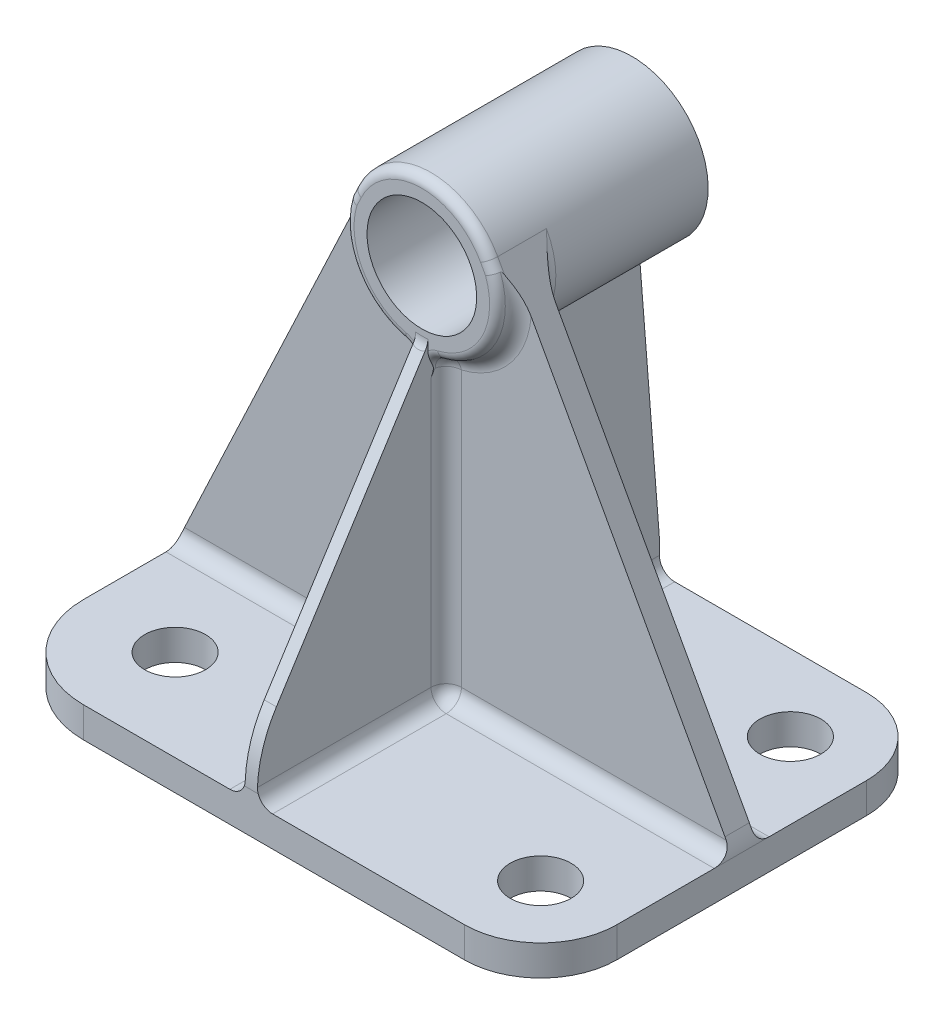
ISO-10303-21;
HEADER;
FILE_DESCRIPTION(('STEP AP214'),'2;1');
FILE_NAME('part.step','',(''),(''),'','','');
FILE_SCHEMA(('AUTOMOTIVE_DESIGN { 1 0 10303 214 1 1 1 1 }'));
ENDSEC;
DATA;
#1=APPLICATION_CONTEXT('core data for automotive mechanical design processes');
#2=APPLICATION_PROTOCOL_DEFINITION('international standard','automotive_design',2000,#1);
#3=PRODUCT_CONTEXT('',#1,'mechanical');
#4=PRODUCT('Part','Part','',(#3));
#5=PRODUCT_RELATED_PRODUCT_CATEGORY('part','',(#4));
#6=PRODUCT_DEFINITION_FORMATION('','',#4);
#7=PRODUCT_DEFINITION_CONTEXT('part definition',#1,'design');
#8=PRODUCT_DEFINITION('design','',#6,#7);
#9=PRODUCT_DEFINITION_SHAPE('','',#8);
#10=(LENGTH_UNIT() NAMED_UNIT(*) SI_UNIT(.MILLI.,.METRE.));
#11=(NAMED_UNIT(*) PLANE_ANGLE_UNIT() SI_UNIT($,.RADIAN.));
#12=(NAMED_UNIT(*) SI_UNIT($,.STERADIAN.) SOLID_ANGLE_UNIT());
#13=UNCERTAINTY_MEASURE_WITH_UNIT(LENGTH_MEASURE(1.E-05),#10,'distance_accuracy_value','');
#14=(GEOMETRIC_REPRESENTATION_CONTEXT(3) GLOBAL_UNCERTAINTY_ASSIGNED_CONTEXT((#13)) GLOBAL_UNIT_ASSIGNED_CONTEXT((#10,
#11,#12)) REPRESENTATION_CONTEXT('',''));
#15=CARTESIAN_POINT('',(0.,0.,0.));
#16=DIRECTION('',(0.,0.,1.));
#17=DIRECTION('',(1.,0.,0.));
#18=AXIS2_PLACEMENT_3D('',#15,#16,#17);
#19=CARTESIAN_POINT('',(65.,10.,37.));
#20=DIRECTION('',(0.,-1.,0.));
#21=DIRECTION('',(0.,0.,-1.));
#22=AXIS2_PLACEMENT_3D('',#19,#20,#21);
#23=PLANE('',#22);
#24=DIRECTION('',(1.,0.,0.));
#25=VECTOR('',#24,1.);
#26=CARTESIAN_POINT('',(-7.,10.,5.));
#27=LINE('',#26,#25);
#28=CARTESIAN_POINT('',(-90.,10.,5.));
#29=VERTEX_POINT('',#28);
#30=CARTESIAN_POINT('',(-12.,10.,5.));
#31=VERTEX_POINT('',#30);
#32=EDGE_CURVE('E452',#29,#31,#27,.T.);
#33=ORIENTED_EDGE('',*,*,#32,.F.);
#34=DIRECTION('',(0.,0.,-1.));
#35=VECTOR('',#34,1.);
#36=CARTESIAN_POINT('',(-90.,10.,32.));
#37=LINE('',#36,#35);
#38=CARTESIAN_POINT('',(-90.,10.,32.));
#39=VERTEX_POINT('',#38);
#40=EDGE_CURVE('E746',#39,#29,#37,.T.);
#41=ORIENTED_EDGE('',*,*,#40,.F.);
#42=CARTESIAN_POINT('',(-60.,10.,32.));
#43=DIRECTION('',(0.,-1.,0.));
#44=DIRECTION('',(0.,0.,-1.));
#45=AXIS2_PLACEMENT_3D('',#42,#43,#44);
#46=CIRCLE('',#45,30.);
#47=CARTESIAN_POINT('',(-60.,10.,62.));
#48=VERTEX_POINT('',#47);
#49=EDGE_CURVE('E741',#48,#39,#46,.T.);
#50=ORIENTED_EDGE('',*,*,#49,.F.);
#51=DIRECTION('',(1.,0.,0.));
#52=VECTOR('',#51,1.);
#53=CARTESIAN_POINT('',(-60.,10.,62.));
#54=LINE('',#53,#52);
#55=CARTESIAN_POINT('',(-12.,10.,62.));
#56=VERTEX_POINT('',#55);
#57=EDGE_CURVE('E740',#48,#56,#54,.T.);
#58=ORIENTED_EDGE('',*,*,#57,.T.);
#59=DIRECTION('',(0.,0.,-1.));
#60=VECTOR('',#59,1.);
#61=CARTESIAN_POINT('',(-12.,10.,62.));
#62=LINE('',#61,#60);
#63=EDGE_CURVE('E455',#31,#56,#62,.F.);
#64=ORIENTED_EDGE('',*,*,#63,.F.);
#65=EDGE_LOOP('',(#33,#41,#50,#58,#64));
#66=FACE_BOUND('',#65,.T.);
#67=CARTESIAN_POINT('',(-60.,10.,32.));
#68=DIRECTION('',(0.,-1.,0.));
#69=DIRECTION('',(0.,0.,-1.));
#70=AXIS2_PLACEMENT_3D('',#67,#68,#69);
#71=CIRCLE('',#70,10.);
#72=CARTESIAN_POINT('',(-60.,10.,22.));
#73=VERTEX_POINT('',#72);
#74=EDGE_CURVE('E1801',#73,#73,#71,.T.);
#75=ORIENTED_EDGE('',*,*,#74,.T.);
#76=EDGE_LOOP('',(#75));
#77=FACE_BOUND('',#76,.T.);
#78=ADVANCED_FACE('F17',(#66,#77),#23,.F.);
#79=CARTESIAN_POINT('',(65.,0.,-45.));
#80=DIRECTION('',(0.,-1.,0.));
#81=DIRECTION('',(0.,0.,1.));
#82=AXIS2_PLACEMENT_3D('',#79,#80,#81);
#83=PLANE('',#82);
#84=CARTESIAN_POINT('',(-60.,0.,32.));
#85=DIRECTION('',(0.,-1.,0.));
#86=DIRECTION('',(0.,0.,-1.));
#87=AXIS2_PLACEMENT_3D('',#84,#85,#86);
#88=CIRCLE('',#87,10.);
#89=CARTESIAN_POINT('',(-60.,0.,22.));
#90=VERTEX_POINT('',#89);
#91=EDGE_CURVE('E1798',#90,#90,#88,.T.);
#92=ORIENTED_EDGE('',*,*,#91,.F.);
#93=EDGE_LOOP('',(#92));
#94=FACE_BOUND('',#93,.T.);
#95=CARTESIAN_POINT('',(65.,0.,37.));
#96=DIRECTION('',(0.,-1.,0.));
#97=DIRECTION('',(0.,0.,-1.));
#98=AXIS2_PLACEMENT_3D('',#95,#96,#97);
#99=CIRCLE('',#98,10.);
#100=CARTESIAN_POINT('',(65.,0.,27.));
#101=VERTEX_POINT('',#100);
#102=EDGE_CURVE('E1794',#101,#101,#99,.T.);
#103=ORIENTED_EDGE('',*,*,#102,.F.);
#104=EDGE_LOOP('',(#103));
#105=FACE_BOUND('',#104,.T.);
#106=CARTESIAN_POINT('',(65.,0.,-45.));
#107=DIRECTION('',(0.,-1.,0.));
#108=DIRECTION('',(0.,0.,-1.));
#109=AXIS2_PLACEMENT_3D('',#106,#107,#108);
#110=CIRCLE('',#109,10.);
#111=CARTESIAN_POINT('',(65.,0.,-55.));
#112=VERTEX_POINT('',#111);
#113=EDGE_CURVE('E1786',#112,#112,#110,.T.);
#114=ORIENTED_EDGE('',*,*,#113,.F.);
#115=EDGE_LOOP('',(#114));
#116=FACE_BOUND('',#115,.T.);
#117=DIRECTION('',(0.,0.,1.));
#118=VECTOR('',#117,1.);
#119=CARTESIAN_POINT('',(-90.,0.,-40.));
#120=LINE('',#119,#118);
#121=CARTESIAN_POINT('',(-90.,0.,-40.));
#122=VERTEX_POINT('',#121);
#123=CARTESIAN_POINT('',(-90.,0.,32.));
#124=VERTEX_POINT('',#123);
#125=EDGE_CURVE('E858',#122,#124,#120,.T.);
#126=ORIENTED_EDGE('',*,*,#125,.F.);
#127=CARTESIAN_POINT('',(-60.,0.,-40.));
#128=DIRECTION('',(0.,1.,0.));
#129=DIRECTION('',(0.,0.,1.));
#130=AXIS2_PLACEMENT_3D('',#127,#128,#129);
#131=CIRCLE('',#130,30.);
#132=CARTESIAN_POINT('',(-60.,0.,-70.));
#133=VERTEX_POINT('',#132);
#134=EDGE_CURVE('E855',#133,#122,#131,.T.);
#135=ORIENTED_EDGE('',*,*,#134,.F.);
#136=DIRECTION('',(1.,0.,0.));
#137=VECTOR('',#136,1.);
#138=CARTESIAN_POINT('',(-60.,0.,-70.));
#139=LINE('',#138,#137);
#140=CARTESIAN_POINT('',(65.,0.,-70.));
#141=VERTEX_POINT('',#140);
#142=EDGE_CURVE('E852',#133,#141,#139,.T.);
#143=ORIENTED_EDGE('',*,*,#142,.T.);
#144=CARTESIAN_POINT('',(65.,0.,-45.));
#145=DIRECTION('',(0.,1.,0.));
#146=DIRECTION('',(0.,0.,1.));
#147=AXIS2_PLACEMENT_3D('',#144,#145,#146);
#148=CIRCLE('',#147,25.);
#149=CARTESIAN_POINT('',(90.,0.,-45.));
#150=VERTEX_POINT('',#149);
#151=EDGE_CURVE('E849',#150,#141,#148,.T.);
#152=ORIENTED_EDGE('',*,*,#151,.F.);
#153=DIRECTION('',(0.,0.,-1.));
#154=VECTOR('',#153,1.);
#155=CARTESIAN_POINT('',(90.,0.,0.));
#156=LINE('',#155,#154);
#157=CARTESIAN_POINT('',(90.,0.,37.));
#158=VERTEX_POINT('',#157);
#159=EDGE_CURVE('E828',#158,#150,#156,.T.);
#160=ORIENTED_EDGE('',*,*,#159,.F.);
#161=CARTESIAN_POINT('',(65.,0.,37.));
#162=DIRECTION('',(0.,-1.,0.));
#163=DIRECTION('',(0.,0.,-1.));
#164=AXIS2_PLACEMENT_3D('',#161,#162,#163);
#165=CIRCLE('',#164,25.);
#166=CARTESIAN_POINT('',(65.,0.,62.));
#167=VERTEX_POINT('',#166);
#168=EDGE_CURVE('E758',#158,#167,#165,.T.);
#169=ORIENTED_EDGE('',*,*,#168,.T.);
#170=DIRECTION('',(1.,0.,0.));
#171=VECTOR('',#170,1.);
#172=CARTESIAN_POINT('',(-60.,0.,62.));
#173=LINE('',#172,#171);
#174=CARTESIAN_POINT('',(-60.,0.,62.));
#175=VERTEX_POINT('',#174);
#176=EDGE_CURVE('E755',#175,#167,#173,.T.);
#177=ORIENTED_EDGE('',*,*,#176,.F.);
#178=CARTESIAN_POINT('',(-60.,0.,32.));
#179=DIRECTION('',(0.,-1.,0.));
#180=DIRECTION('',(0.,0.,-1.));
#181=AXIS2_PLACEMENT_3D('',#178,#179,#180);
#182=CIRCLE('',#181,30.);
#183=EDGE_CURVE('E752',#175,#124,#182,.T.);
#184=ORIENTED_EDGE('',*,*,#183,.T.);
#185=EDGE_LOOP('',(#126,#135,#143,#152,#160,#169,#177,#184));
#186=FACE_BOUND('',#185,.T.);
#187=CARTESIAN_POINT('',(-60.,0.,-40.));
#188=DIRECTION('',(0.,-1.,0.));
#189=DIRECTION('',(0.,0.,-1.));
#190=AXIS2_PLACEMENT_3D('',#187,#188,#189);
#191=CIRCLE('',#190,10.);
#192=CARTESIAN_POINT('',(-60.,0.,-50.));
#193=VERTEX_POINT('',#192);
#194=EDGE_CURVE('E889',#193,#193,#191,.T.);
#195=ORIENTED_EDGE('',*,*,#194,.F.);
#196=EDGE_LOOP('',(#195));
#197=FACE_BOUND('',#196,.T.);
#198=ADVANCED_FACE('F688',(#94,#105,#116,#186,#197),#83,.T.);
#199=CARTESIAN_POINT('',(90.,10.,0.));
#200=DIRECTION('',(0.,0.,-1.));
#201=DIRECTION('',(1.,0.,0.));
#202=AXIS2_PLACEMENT_3D('',#199,#200,#201);
#203=PLANE('',#202);
#204=DIRECTION('',(0.,-1.,0.));
#205=VECTOR('',#204,1.);
#206=CARTESIAN_POINT('',(2.,109.477258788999,0.));
#207=LINE('',#206,#205);
#208=CARTESIAN_POINT('',(2.,15.,0.));
#209=VERTEX_POINT('',#208);
#210=CARTESIAN_POINT('',(2.,105.225226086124,0.));
#211=VERTEX_POINT('',#210);
#212=EDGE_CURVE('E461',#209,#211,#207,.F.);
#213=ORIENTED_EDGE('',*,*,#212,.F.);
#214=DIRECTION('',(1.,0.,0.));
#215=VECTOR('',#214,1.);
#216=CARTESIAN_POINT('',(-3.,15.,0.));
#217=LINE('',#216,#215);
#218=CARTESIAN_POINT('',(88.9087121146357,15.,0.));
#219=VERTEX_POINT('',#218);
#220=EDGE_CURVE('E458',#219,#209,#217,.F.);
#221=ORIENTED_EDGE('',*,*,#220,.F.);
#222=CARTESIAN_POINT('',(78.,10.,0.));
#223=DIRECTION('',(0.,0.,1.));
#224=DIRECTION('',(1.,0.,0.));
#225=AXIS2_PLACEMENT_3D('',#222,#223,#224);
#226=CIRCLE('',#225,12.);
#227=CARTESIAN_POINT('',(88.5232499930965,15.7672532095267,0.));
#228=VERTEX_POINT('',#227);
#229=EDGE_CURVE('E791',#219,#228,#226,.T.);
#230=ORIENTED_EDGE('',*,*,#229,.T.);
#231=DIRECTION('',(-0.480604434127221,0.876937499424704,0.));
#232=VECTOR('',#231,1.);
#233=CARTESIAN_POINT('',(88.5232499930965,15.7672532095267,0.));
#234=LINE('',#233,#232);
#235=CARTESIAN_POINT('',(24.893360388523,131.869877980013,0.));
#236=VERTEX_POINT('',#235);
#237=EDGE_CURVE('E808',#228,#236,#234,.T.);
#238=ORIENTED_EDGE('',*,*,#237,.T.);
#239=CARTESIAN_POINT('',(-5.,134.397130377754,0.));
#240=DIRECTION('',(0.,0.,1.));
#241=DIRECTION('',(1.,0.,0.));
#242=AXIS2_PLACEMENT_3D('',#239,#240,#241);
#243=CIRCLE('',#242,30.);
#244=EDGE_CURVE('E464',#211,#236,#243,.T.);
#245=ORIENTED_EDGE('',*,*,#244,.F.);
#246=EDGE_LOOP('',(#213,#221,#230,#238,#245));
#247=FACE_BOUND('',#246,.T.);
#248=ADVANCED_FACE('F695',(#247),#203,.F.);
#249=DIRECTION('',(0.426325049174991,0.904570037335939,0.));
#250=VECTOR('',#249,1.);
#251=CARTESIAN_POINT('',(-88.8548404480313,15.1159005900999,0.));
#252=LINE('',#251,#250);
#253=CARTESIAN_POINT('',(-88.8548404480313,15.1159005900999,0.));
#254=VERTEX_POINT('',#253);
#255=CARTESIAN_POINT('',(-34.6840520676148,130.054659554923,0.));
#256=VERTEX_POINT('',#255);
#257=EDGE_CURVE('E811',#254,#256,#252,.T.);
#258=ORIENTED_EDGE('',*,*,#257,.F.);
#259=CARTESIAN_POINT('',(-78.,10.,0.));
#260=DIRECTION('',(0.,0.,-1.));
#261=DIRECTION('',(-1.,0.,0.));
#262=AXIS2_PLACEMENT_3D('',#259,#260,#261);
#263=CIRCLE('',#262,12.);
#264=CARTESIAN_POINT('',(-88.9087121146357,15.,0.));
#265=VERTEX_POINT('',#264);
#266=EDGE_CURVE('E796',#265,#254,#263,.T.);
#267=ORIENTED_EDGE('',*,*,#266,.F.);
#268=DIRECTION('',(1.,0.,0.));
#269=VECTOR('',#268,1.);
#270=CARTESIAN_POINT('',(-90.,15.,0.));
#271=LINE('',#270,#269);
#272=CARTESIAN_POINT('',(-12.,15.,0.));
#273=VERTEX_POINT('',#272);
#274=EDGE_CURVE('E443',#273,#265,#271,.F.);
#275=ORIENTED_EDGE('',*,*,#274,.F.);
#276=DIRECTION('',(0.,-1.,0.));
#277=VECTOR('',#276,1.);
#278=CARTESIAN_POINT('',(-12.,10.,0.));
#279=LINE('',#278,#277);
#280=CARTESIAN_POINT('',(-12.,105.225226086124,0.));
#281=VERTEX_POINT('',#280);
#282=EDGE_CURVE('E446',#281,#273,#279,.T.);
#283=ORIENTED_EDGE('',*,*,#282,.F.);
#284=CARTESIAN_POINT('',(-5.,134.397130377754,0.));
#285=DIRECTION('',(0.,0.,1.));
#286=DIRECTION('',(1.,0.,0.));
#287=AXIS2_PLACEMENT_3D('',#284,#285,#286);
#288=CIRCLE('',#287,30.);
#289=EDGE_CURVE('E449',#256,#281,#288,.T.);
#290=ORIENTED_EDGE('',*,*,#289,.F.);
#291=EDGE_LOOP('',(#258,#267,#275,#283,#290));
#292=FACE_BOUND('',#291,.T.);
#293=ADVANCED_FACE('F712',(#292),#203,.F.);
#294=CARTESIAN_POINT('',(-5.,134.397130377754,-8.));
#295=DIRECTION('',(0.,0.,1.));
#296=DIRECTION('',(-1.,0.,0.));
#297=AXIS2_PLACEMENT_3D('',#294,#295,#296);
#298=CYLINDRICAL_SURFACE('',#297,25.);
#299=DIRECTION('',(0.,0.,1.));
#300=VECTOR('',#299,1.);
#301=CARTESIAN_POINT('',(16.9234374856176,146.412241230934,-8.));
#302=LINE('',#301,#300);
#303=CARTESIAN_POINT('',(16.9234374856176,146.412241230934,-13.));
#304=VERTEX_POINT('',#303);
#305=CARTESIAN_POINT('',(16.9234374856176,146.412241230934,3.));
#306=VERTEX_POINT('',#305);
#307=EDGE_CURVE('E823',#304,#306,#302,.T.);
#308=ORIENTED_EDGE('',*,*,#307,.F.);
#309=CARTESIAN_POINT('',(-5.,134.397130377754,-13.));
#310=DIRECTION('',(0.,0.,1.));
#311=DIRECTION('',(1.,0.,0.));
#312=AXIS2_PLACEMENT_3D('',#309,#310,#311);
#313=CIRCLE('',#312,25.);
#314=CARTESIAN_POINT('',(0.833333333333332,110.087210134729,-13.));
#315=VERTEX_POINT('',#314);
#316=EDGE_CURVE('E414',#315,#304,#313,.T.);
#317=ORIENTED_EDGE('',*,*,#316,.F.);
#318=DIRECTION('',(0.,0.,1.));
#319=VECTOR('',#318,1.);
#320=CARTESIAN_POINT('',(0.833333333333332,110.087210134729,-8.));
#321=LINE('',#320,#319);
#322=CARTESIAN_POINT('',(0.833333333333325,110.087210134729,-63.));
#323=VERTEX_POINT('',#322);
#324=EDGE_CURVE('E417',#323,#315,#321,.T.);
#325=ORIENTED_EDGE('',*,*,#324,.F.);
#326=CARTESIAN_POINT('',(-5.,134.397130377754,-63.));
#327=DIRECTION('',(0.,0.,-1.));
#328=DIRECTION('',(-1.,0.,0.));
#329=AXIS2_PLACEMENT_3D('',#326,#327,#328);
#330=CIRCLE('',#329,25.);
#331=CARTESIAN_POINT('',(-10.8333333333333,110.087210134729,-63.));
#332=VERTEX_POINT('',#331);
#333=EDGE_CURVE('E788',#332,#323,#330,.T.);
#334=ORIENTED_EDGE('',*,*,#333,.F.);
#335=DIRECTION('',(0.,0.,1.));
#336=VECTOR('',#335,1.);
#337=CARTESIAN_POINT('',(-10.8333333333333,110.087210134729,-8.));
#338=LINE('',#337,#336);
#339=CARTESIAN_POINT('',(-10.8333333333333,110.087210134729,-13.));
#340=VERTEX_POINT('',#339);
#341=EDGE_CURVE('E411',#340,#332,#338,.F.);
#342=ORIENTED_EDGE('',*,*,#341,.F.);
#343=CARTESIAN_POINT('',(-5.,134.397130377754,-13.));
#344=DIRECTION('',(0.,0.,1.));
#345=DIRECTION('',(1.,0.,0.));
#346=AXIS2_PLACEMENT_3D('',#343,#344,#345);
#347=CIRCLE('',#346,25.);
#348=CARTESIAN_POINT('',(-27.6142509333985,145.055256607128,-13.));
#349=VERTEX_POINT('',#348);
#350=EDGE_CURVE('E408',#349,#340,#347,.T.);
#351=ORIENTED_EDGE('',*,*,#350,.F.);
#352=DIRECTION('',(0.,0.,1.));
#353=VECTOR('',#352,1.);
#354=CARTESIAN_POINT('',(-27.6142509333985,145.055256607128,-8.));
#355=LINE('',#354,#353);
#356=CARTESIAN_POINT('',(-27.6142509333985,145.055256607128,3.));
#357=VERTEX_POINT('',#356);
#358=EDGE_CURVE('E820',#349,#357,#355,.T.);
#359=ORIENTED_EDGE('',*,*,#358,.T.);
#360=CARTESIAN_POINT('',(-5.,134.397130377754,3.));
#361=DIRECTION('',(0.,0.,-1.));
#362=DIRECTION('',(-1.,0.,0.));
#363=AXIS2_PLACEMENT_3D('',#360,#361,#362);
#364=CIRCLE('',#363,25.);
#365=EDGE_CURVE('E1175',#306,#357,#364,.F.);
#366=ORIENTED_EDGE('',*,*,#365,.F.);
#367=EDGE_LOOP('',(#308,#317,#325,#334,#342,#351,#359,#366));
#368=FACE_BOUND('',#367,.T.);
#369=ADVANCED_FACE('F702',(#368),#298,.T.);
#370=CARTESIAN_POINT('',(65.,10.,37.));
#371=DIRECTION('',(0.,-1.,0.));
#372=DIRECTION('',(0.,0.,-1.));
#373=AXIS2_PLACEMENT_3D('',#370,#371,#372);
#374=CIRCLE('',#373,10.);
#375=CARTESIAN_POINT('',(65.,10.,27.));
#376=VERTEX_POINT('',#375);
#377=EDGE_CURVE('E717',#376,#376,#374,.T.);
#378=ORIENTED_EDGE('',*,*,#377,.T.);
#379=EDGE_LOOP('',(#378));
#380=FACE_BOUND('',#379,.T.);
#381=DIRECTION('',(0.,0.,1.));
#382=VECTOR('',#381,1.);
#383=CARTESIAN_POINT('',(2.,10.,0.));
#384=LINE('',#383,#382);
#385=CARTESIAN_POINT('',(2.,10.,62.));
#386=VERTEX_POINT('',#385);
#387=CARTESIAN_POINT('',(2.,10.,5.));
#388=VERTEX_POINT('',#387);
#389=EDGE_CURVE('E467',#386,#388,#384,.F.);
#390=ORIENTED_EDGE('',*,*,#389,.F.);
#391=CARTESIAN_POINT('',(65.,10.,62.));
#392=VERTEX_POINT('',#391);
#393=EDGE_CURVE('E723',#386,#392,#54,.T.);
#394=ORIENTED_EDGE('',*,*,#393,.T.);
#395=CARTESIAN_POINT('',(65.,10.,37.));
#396=DIRECTION('',(0.,-1.,0.));
#397=DIRECTION('',(0.,0.,-1.));
#398=AXIS2_PLACEMENT_3D('',#395,#396,#397);
#399=CIRCLE('',#398,25.);
#400=CARTESIAN_POINT('',(90.,10.,37.));
#401=VERTEX_POINT('',#400);
#402=EDGE_CURVE('E744',#401,#392,#399,.T.);
#403=ORIENTED_EDGE('',*,*,#402,.F.);
#404=DIRECTION('',(0.,0.,1.));
#405=VECTOR('',#404,1.);
#406=CARTESIAN_POINT('',(90.,10.,-8.));
#407=LINE('',#406,#405);
#408=CARTESIAN_POINT('',(90.,10.,5.));
#409=VERTEX_POINT('',#408);
#410=EDGE_CURVE('E761',#409,#401,#407,.T.);
#411=ORIENTED_EDGE('',*,*,#410,.F.);
#412=DIRECTION('',(1.,0.,0.));
#413=VECTOR('',#412,1.);
#414=CARTESIAN_POINT('',(90.,10.,5.));
#415=LINE('',#414,#413);
#416=EDGE_CURVE('E470',#388,#409,#415,.T.);
#417=ORIENTED_EDGE('',*,*,#416,.F.);
#418=EDGE_LOOP('',(#390,#394,#403,#411,#417));
#419=FACE_BOUND('',#418,.T.);
#420=ADVANCED_FACE('F654',(#380,#419),#23,.F.);
#421=CARTESIAN_POINT('',(65.,10.,-45.));
#422=DIRECTION('',(0.,-1.,0.));
#423=DIRECTION('',(0.,0.,1.));
#424=AXIS2_PLACEMENT_3D('',#421,#422,#423);
#425=PLANE('',#424);
#426=CARTESIAN_POINT('',(65.,10.,-45.));
#427=DIRECTION('',(0.,-1.,0.));
#428=DIRECTION('',(0.,0.,-1.));
#429=AXIS2_PLACEMENT_3D('',#426,#427,#428);
#430=CIRCLE('',#429,10.);
#431=CARTESIAN_POINT('',(65.,10.,-55.));
#432=VERTEX_POINT('',#431);
#433=EDGE_CURVE('E1789',#432,#432,#430,.T.);
#434=ORIENTED_EDGE('',*,*,#433,.T.);
#435=EDGE_LOOP('',(#434));
#436=FACE_BOUND('',#435,.T.);
#437=DIRECTION('',(0.,0.,-1.));
#438=VECTOR('',#437,1.);
#439=CARTESIAN_POINT('',(90.,10.,0.));
#440=LINE('',#439,#438);
#441=CARTESIAN_POINT('',(90.,10.,-13.));
#442=VERTEX_POINT('',#441);
#443=CARTESIAN_POINT('',(90.,10.,-45.));
#444=VERTEX_POINT('',#443);
#445=EDGE_CURVE('E833',#442,#444,#440,.T.);
#446=ORIENTED_EDGE('',*,*,#445,.T.);
#447=CARTESIAN_POINT('',(65.,10.,-45.));
#448=DIRECTION('',(0.,1.,0.));
#449=DIRECTION('',(0.,0.,1.));
#450=AXIS2_PLACEMENT_3D('',#447,#448,#449);
#451=CIRCLE('',#450,25.);
#452=CARTESIAN_POINT('',(65.,10.,-70.));
#453=VERTEX_POINT('',#452);
#454=EDGE_CURVE('E832',#444,#453,#451,.T.);
#455=ORIENTED_EDGE('',*,*,#454,.T.);
#456=DIRECTION('',(1.,0.,0.));
#457=VECTOR('',#456,1.);
#458=CARTESIAN_POINT('',(-60.,10.,-70.));
#459=LINE('',#458,#457);
#460=CARTESIAN_POINT('',(2.,10.,-70.));
#461=VERTEX_POINT('',#460);
#462=EDGE_CURVE('E836',#461,#453,#459,.T.);
#463=ORIENTED_EDGE('',*,*,#462,.F.);
#464=DIRECTION('',(0.,0.,-1.));
#465=VECTOR('',#464,1.);
#466=CARTESIAN_POINT('',(2.,10.,-45.));
#467=LINE('',#466,#465);
#468=CARTESIAN_POINT('',(2.,10.,-13.));
#469=VERTEX_POINT('',#468);
#470=EDGE_CURVE('E481',#469,#461,#467,.T.);
#471=ORIENTED_EDGE('',*,*,#470,.F.);
#472=DIRECTION('',(-1.,0.,0.));
#473=VECTOR('',#472,1.);
#474=CARTESIAN_POINT('',(65.,10.,-13.));
#475=LINE('',#474,#473);
#476=EDGE_CURVE('E484',#442,#469,#475,.T.);
#477=ORIENTED_EDGE('',*,*,#476,.F.);
#478=EDGE_LOOP('',(#446,#455,#463,#471,#477));
#479=FACE_BOUND('',#478,.T.);
#480=ADVANCED_FACE('F701',(#436,#479),#425,.F.);
#481=CARTESIAN_POINT('',(-60.,10.,-40.));
#482=DIRECTION('',(0.,-1.,0.));
#483=DIRECTION('',(0.,0.,-1.));
#484=AXIS2_PLACEMENT_3D('',#481,#482,#483);
#485=CIRCLE('',#484,10.);
#486=CARTESIAN_POINT('',(-60.,10.,-50.));
#487=VERTEX_POINT('',#486);
#488=EDGE_CURVE('E1784',#487,#487,#485,.T.);
#489=ORIENTED_EDGE('',*,*,#488,.T.);
#490=EDGE_LOOP('',(#489));
#491=FACE_BOUND('',#490,.T.);
#492=DIRECTION('',(0.,0.,-1.));
#493=VECTOR('',#492,1.);
#494=CARTESIAN_POINT('',(-12.,10.,-8.));
#495=LINE('',#494,#493);
#496=CARTESIAN_POINT('',(-12.,10.,-70.));
#497=VERTEX_POINT('',#496);
#498=CARTESIAN_POINT('',(-12.,10.,-13.));
#499=VERTEX_POINT('',#498);
#500=EDGE_CURVE('E496',#497,#499,#495,.F.);
#501=ORIENTED_EDGE('',*,*,#500,.F.);
#502=CARTESIAN_POINT('',(-60.,10.,-70.));
#503=VERTEX_POINT('',#502);
#504=EDGE_CURVE('E837',#503,#497,#459,.T.);
#505=ORIENTED_EDGE('',*,*,#504,.F.);
#506=CARTESIAN_POINT('',(-60.,10.,-40.));
#507=DIRECTION('',(0.,1.,0.));
#508=DIRECTION('',(0.,0.,1.));
#509=AXIS2_PLACEMENT_3D('',#506,#507,#508);
#510=CIRCLE('',#509,30.);
#511=CARTESIAN_POINT('',(-90.,10.,-40.));
#512=VERTEX_POINT('',#511);
#513=EDGE_CURVE('E840',#503,#512,#510,.T.);
#514=ORIENTED_EDGE('',*,*,#513,.T.);
#515=DIRECTION('',(0.,0.,1.));
#516=VECTOR('',#515,1.);
#517=CARTESIAN_POINT('',(-90.,10.,-40.));
#518=LINE('',#517,#516);
#519=CARTESIAN_POINT('',(-90.,10.,-13.));
#520=VERTEX_POINT('',#519);
#521=EDGE_CURVE('E843',#512,#520,#518,.T.);
#522=ORIENTED_EDGE('',*,*,#521,.T.);
#523=DIRECTION('',(-1.,0.,0.));
#524=VECTOR('',#523,1.);
#525=CARTESIAN_POINT('',(65.,10.,-13.));
#526=LINE('',#525,#524);
#527=EDGE_CURVE('E499',#499,#520,#526,.T.);
#528=ORIENTED_EDGE('',*,*,#527,.F.);
#529=EDGE_LOOP('',(#501,#505,#514,#522,#528));
#530=FACE_BOUND('',#529,.T.);
#531=ADVANCED_FACE('F709',(#491,#530),#425,.F.);
#532=CARTESIAN_POINT('',(78.,10.,-8.));
#533=DIRECTION('',(0.,0.,-1.));
#534=DIRECTION('',(1.,0.,0.));
#535=AXIS2_PLACEMENT_3D('',#532,#533,#534);
#536=PLANE('',#535);
#537=DIRECTION('',(0.,-1.,0.));
#538=VECTOR('',#537,1.);
#539=CARTESIAN_POINT('',(-12.,10.,-8.));
#540=LINE('',#539,#538);
#541=CARTESIAN_POINT('',(-12.,15.,-8.));
#542=VERTEX_POINT('',#541);
#543=CARTESIAN_POINT('',(-12.,105.225226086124,-8.));
#544=VERTEX_POINT('',#543);
#545=EDGE_CURVE('E487',#542,#544,#540,.F.);
#546=ORIENTED_EDGE('',*,*,#545,.F.);
#547=DIRECTION('',(-1.,0.,0.));
#548=VECTOR('',#547,1.);
#549=CARTESIAN_POINT('',(78.,15.,-8.));
#550=LINE('',#549,#548);
#551=CARTESIAN_POINT('',(-88.9087121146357,15.,-8.));
#552=VERTEX_POINT('',#551);
#553=EDGE_CURVE('E490',#552,#542,#550,.F.);
#554=ORIENTED_EDGE('',*,*,#553,.F.);
#555=CARTESIAN_POINT('',(-78.,10.,-8.));
#556=DIRECTION('',(0.,0.,-1.));
#557=DIRECTION('',(-1.,0.,0.));
#558=AXIS2_PLACEMENT_3D('',#555,#556,#557);
#559=CIRCLE('',#558,12.);
#560=CARTESIAN_POINT('',(-88.8548404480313,15.1159005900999,-8.));
#561=VERTEX_POINT('',#560);
#562=EDGE_CURVE('E802',#552,#561,#559,.T.);
#563=ORIENTED_EDGE('',*,*,#562,.T.);
#564=DIRECTION('',(0.426325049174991,0.904570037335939,0.));
#565=VECTOR('',#564,1.);
#566=CARTESIAN_POINT('',(-88.8548404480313,15.1159005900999,-8.));
#567=LINE('',#566,#565);
#568=CARTESIAN_POINT('',(-34.6840520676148,130.054659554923,-8.));
#569=VERTEX_POINT('',#568);
#570=EDGE_CURVE('E799',#561,#569,#567,.T.);
#571=ORIENTED_EDGE('',*,*,#570,.T.);
#572=CARTESIAN_POINT('',(-5.,134.397130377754,-8.));
#573=DIRECTION('',(0.,0.,1.));
#574=DIRECTION('',(1.,0.,0.));
#575=AXIS2_PLACEMENT_3D('',#572,#573,#574);
#576=CIRCLE('',#575,30.);
#577=EDGE_CURVE('E493',#544,#569,#576,.F.);
#578=ORIENTED_EDGE('',*,*,#577,.F.);
#579=EDGE_LOOP('',(#546,#554,#563,#571,#578));
#580=FACE_BOUND('',#579,.T.);
#581=ADVANCED_FACE('F1092',(#580),#536,.T.);
#582=CARTESIAN_POINT('',(90.,10.,0.));
#583=DIRECTION('',(1.,0.,0.));
#584=DIRECTION('',(0.,0.,1.));
#585=AXIS2_PLACEMENT_3D('',#582,#583,#584);
#586=PLANE('',#585);
#587=DIRECTION('',(0.,-1.,0.));
#588=VECTOR('',#587,1.);
#589=CARTESIAN_POINT('',(90.,10.,-45.));
#590=LINE('',#589,#588);
#591=EDGE_CURVE('E846',#444,#150,#590,.T.);
#592=ORIENTED_EDGE('',*,*,#591,.F.);
#593=ORIENTED_EDGE('',*,*,#445,.F.);
#594=EDGE_CURVE('E829',#409,#442,#440,.T.);
#595=ORIENTED_EDGE('',*,*,#594,.F.);
#596=ORIENTED_EDGE('',*,*,#410,.T.);
#597=DIRECTION('',(0.,-1.,0.));
#598=VECTOR('',#597,1.);
#599=CARTESIAN_POINT('',(90.,10.,37.));
#600=LINE('',#599,#598);
#601=EDGE_CURVE('E762',#401,#158,#600,.T.);
#602=ORIENTED_EDGE('',*,*,#601,.T.);
#603=ORIENTED_EDGE('',*,*,#159,.T.);
#604=EDGE_LOOP('',(#592,#593,#595,#596,#602,#603));
#605=FACE_BOUND('',#604,.T.);
#606=ADVANCED_FACE('F673',(#605),#586,.T.);
#607=CARTESIAN_POINT('',(-90.,10.,-40.));
#608=DIRECTION('',(-1.,0.,0.));
#609=DIRECTION('',(0.,0.,-1.));
#610=AXIS2_PLACEMENT_3D('',#607,#608,#609);
#611=PLANE('',#610);
#612=ORIENTED_EDGE('',*,*,#521,.F.);
#613=DIRECTION('',(0.,-1.,0.));
#614=VECTOR('',#613,1.);
#615=CARTESIAN_POINT('',(-90.,10.,-40.));
#616=LINE('',#615,#614);
#617=EDGE_CURVE('E861',#512,#122,#616,.T.);
#618=ORIENTED_EDGE('',*,*,#617,.T.);
#619=ORIENTED_EDGE('',*,*,#125,.T.);
#620=DIRECTION('',(0.,-1.,0.));
#621=VECTOR('',#620,1.);
#622=CARTESIAN_POINT('',(-90.,10.,32.));
#623=LINE('',#622,#621);
#624=EDGE_CURVE('E751',#39,#124,#623,.T.);
#625=ORIENTED_EDGE('',*,*,#624,.F.);
#626=ORIENTED_EDGE('',*,*,#40,.T.);
#627=DIRECTION('',(0.,0.,1.));
#628=VECTOR('',#627,1.);
#629=CARTESIAN_POINT('',(-90.,10.,-8.));
#630=LINE('',#629,#628);
#631=EDGE_CURVE('E805',#520,#29,#630,.T.);
#632=ORIENTED_EDGE('',*,*,#631,.F.);
#633=EDGE_LOOP('',(#612,#618,#619,#625,#626,#632));
#634=FACE_BOUND('',#633,.T.);
#635=ADVANCED_FACE('F898',(#634),#611,.T.);
#636=CARTESIAN_POINT('',(-60.,10.,-40.));
#637=DIRECTION('',(0.,-1.,0.));
#638=DIRECTION('',(0.,0.,1.));
#639=AXIS2_PLACEMENT_3D('',#636,#637,#638);
#640=CYLINDRICAL_SURFACE('',#639,30.);
#641=ORIENTED_EDGE('',*,*,#134,.T.);
#642=ORIENTED_EDGE('',*,*,#617,.F.);
#643=ORIENTED_EDGE('',*,*,#513,.F.);
#644=DIRECTION('',(0.,-1.,0.));
#645=VECTOR('',#644,1.);
#646=CARTESIAN_POINT('',(-60.,10.,-70.));
#647=LINE('',#646,#645);
#648=EDGE_CURVE('E864',#503,#133,#647,.T.);
#649=ORIENTED_EDGE('',*,*,#648,.T.);
#650=EDGE_LOOP('',(#641,#642,#643,#649));
#651=FACE_BOUND('',#650,.T.);
#652=ADVANCED_FACE('F918',(#651),#640,.T.);
#653=CARTESIAN_POINT('',(-60.,10.,-70.));
#654=DIRECTION('',(0.,0.,1.));
#655=DIRECTION('',(-1.,0.,0.));
#656=AXIS2_PLACEMENT_3D('',#653,#654,#655);
#657=PLANE('',#656);
#658=DIRECTION('',(0.,-1.,0.));
#659=VECTOR('',#658,1.);
#660=CARTESIAN_POINT('',(-3.,10.,-70.));
#661=LINE('',#660,#659);
#662=CARTESIAN_POINT('',(-3.,18.4377433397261,-70.));
#663=VERTEX_POINT('',#662);
#664=CARTESIAN_POINT('',(-3.,15.,-70.));
#665=VERTEX_POINT('',#664);
#666=EDGE_CURVE('E778',#663,#665,#661,.T.);
#667=ORIENTED_EDGE('',*,*,#666,.T.);
#668=CARTESIAN_POINT('',(2.,15.,-70.));
#669=DIRECTION('',(0.,0.,-1.));
#670=DIRECTION('',(-1.,0.,0.));
#671=AXIS2_PLACEMENT_3D('',#668,#669,#670);
#672=CIRCLE('',#671,5.);
#673=EDGE_CURVE('E1174',#461,#665,#672,.T.);
#674=ORIENTED_EDGE('',*,*,#673,.F.);
#675=ORIENTED_EDGE('',*,*,#462,.T.);
#676=DIRECTION('',(0.,-1.,0.));
#677=VECTOR('',#676,1.);
#678=CARTESIAN_POINT('',(65.,10.,-70.));
#679=LINE('',#678,#677);
#680=EDGE_CURVE('E866',#453,#141,#679,.T.);
#681=ORIENTED_EDGE('',*,*,#680,.T.);
#682=ORIENTED_EDGE('',*,*,#142,.F.);
#683=ORIENTED_EDGE('',*,*,#648,.F.);
#684=ORIENTED_EDGE('',*,*,#504,.T.);
#685=CARTESIAN_POINT('',(-12.,15.,-70.));
#686=DIRECTION('',(0.,0.,-1.));
#687=DIRECTION('',(-1.,0.,0.));
#688=AXIS2_PLACEMENT_3D('',#685,#686,#687);
#689=CIRCLE('',#688,5.);
#690=CARTESIAN_POINT('',(-7.,15.,-70.));
#691=VERTEX_POINT('',#690);
#692=EDGE_CURVE('E591',#691,#497,#689,.T.);
#693=ORIENTED_EDGE('',*,*,#692,.F.);
#694=DIRECTION('',(0.,1.,0.));
#695=VECTOR('',#694,1.);
#696=CARTESIAN_POINT('',(-7.,10.,-70.));
#697=LINE('',#696,#695);
#698=CARTESIAN_POINT('',(-7.,18.4377433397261,-70.));
#699=VERTEX_POINT('',#698);
#700=EDGE_CURVE('E772',#691,#699,#697,.T.);
#701=ORIENTED_EDGE('',*,*,#700,.T.);
#702=DIRECTION('',(1.,0.,0.));
#703=VECTOR('',#702,1.);
#704=CARTESIAN_POINT('',(-7.,18.4377433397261,-70.));
#705=LINE('',#704,#703);
#706=EDGE_CURVE('E379',#663,#699,#705,.F.);
#707=ORIENTED_EDGE('',*,*,#706,.F.);
#708=EDGE_LOOP('',(#667,#674,#675,#681,#682,#683,#684,#693,#701,#707));
#709=FACE_BOUND('',#708,.T.);
#710=ADVANCED_FACE('F1102',(#709),#657,.F.);
#711=CARTESIAN_POINT('',(65.,10.,-45.));
#712=DIRECTION('',(0.,-1.,0.));
#713=DIRECTION('',(0.,0.,1.));
#714=AXIS2_PLACEMENT_3D('',#711,#712,#713);
#715=CYLINDRICAL_SURFACE('',#714,25.);
#716=ORIENTED_EDGE('',*,*,#151,.T.);
#717=ORIENTED_EDGE('',*,*,#680,.F.);
#718=ORIENTED_EDGE('',*,*,#454,.F.);
#719=ORIENTED_EDGE('',*,*,#591,.T.);
#720=EDGE_LOOP('',(#716,#717,#718,#719));
#721=FACE_BOUND('',#720,.T.);
#722=ADVANCED_FACE('F1107',(#721),#715,.T.);
#723=CARTESIAN_POINT('',(78.,10.,-8.));
#724=DIRECTION('',(0.,0.,1.));
#725=DIRECTION('',(-1.,0.,0.));
#726=AXIS2_PLACEMENT_3D('',#723,#724,#725);
#727=CYLINDRICAL_SURFACE('',#726,12.);
#728=ORIENTED_EDGE('',*,*,#594,.T.);
#729=CARTESIAN_POINT('',(88.9087121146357,15.,-8.));
#730=CARTESIAN_POINT('',(88.9668623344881,14.8731803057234,-7.99998431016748));
#731=CARTESIAN_POINT('',(89.0227769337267,14.7453021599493,-8.00482509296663));
#732=CARTESIAN_POINT('',(89.1298915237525,14.4882930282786,-8.02458697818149));
#733=CARTESIAN_POINT('',(89.1810893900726,14.3591615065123,-8.03951259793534));
#734=CARTESIAN_POINT('',(89.278505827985,14.1005419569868,-8.079825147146));
#735=CARTESIAN_POINT('',(89.3247211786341,13.9710537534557,-8.10521879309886));
#736=CARTESIAN_POINT('',(89.4119684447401,13.7128869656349,-8.16668430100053));
#737=CARTESIAN_POINT('',(89.4530012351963,13.5842082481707,-8.20275435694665));
#738=CARTESIAN_POINT('',(89.5299576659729,13.3283600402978,-8.28579120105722));
#739=CARTESIAN_POINT('',(89.5658647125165,13.2011966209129,-8.33279214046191));
#740=CARTESIAN_POINT('',(89.6324774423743,12.9499757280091,-8.43755316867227));
#741=CARTESIAN_POINT('',(89.6631831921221,12.8259182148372,-8.49531312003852));
#742=CARTESIAN_POINT('',(89.719548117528,12.5822123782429,-8.62129026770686));
#743=CARTESIAN_POINT('',(89.7452126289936,12.4625595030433,-8.68949626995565));
#744=CARTESIAN_POINT('',(89.7918322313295,12.2286577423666,-8.83602288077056));
#745=CARTESIAN_POINT('',(89.8127875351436,12.1144086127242,-8.91434303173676));
#746=CARTESIAN_POINT('',(89.8495819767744,11.8971112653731,-9.07702783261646));
#747=CARTESIAN_POINT('',(89.8656013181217,11.7937930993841,-9.16099177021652));
#748=CARTESIAN_POINT('',(89.8941046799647,11.5938861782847,-9.33719413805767));
#749=CARTESIAN_POINT('',(89.9065875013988,11.4972997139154,-9.42943536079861));
#750=CARTESIAN_POINT('',(89.9284666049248,11.3116495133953,-9.62155112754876));
#751=CARTESIAN_POINT('',(89.9378626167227,11.2225864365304,-9.72142633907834));
#752=CARTESIAN_POINT('',(89.9540484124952,11.0526250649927,-9.92816874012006));
#753=CARTESIAN_POINT('',(89.9608370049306,10.9717305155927,-10.0350391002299));
#754=CARTESIAN_POINT('',(89.97236304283,10.817665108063,-10.2565478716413));
#755=CARTESIAN_POINT('',(89.9770704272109,10.7446183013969,-10.3712741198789));
#756=CARTESIAN_POINT('',(89.9847779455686,10.6080910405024,-10.6063395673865));
#757=CARTESIAN_POINT('',(89.9877780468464,10.5446107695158,-10.7266788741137));
#758=CARTESIAN_POINT('',(89.9925199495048,10.4276587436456,-10.972148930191));
#759=CARTESIAN_POINT('',(89.9942617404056,10.37418707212,-11.0972797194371));
#760=CARTESIAN_POINT('',(89.9968851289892,10.2776349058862,-11.3514433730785));
#761=CARTESIAN_POINT('',(89.9977670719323,10.2345502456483,-11.4804746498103));
#762=CARTESIAN_POINT('',(89.9989207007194,10.164201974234,-11.7237453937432));
#763=CARTESIAN_POINT('',(89.9992593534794,10.1355804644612,-11.8375942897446));
#764=CARTESIAN_POINT('',(89.9997139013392,10.0864166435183,-12.0670156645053));
#765=CARTESIAN_POINT('',(89.999829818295,10.0658735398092,-12.1825879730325));
#766=CARTESIAN_POINT('',(89.9999666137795,10.0329758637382,-12.4148369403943));
#767=CARTESIAN_POINT('',(89.9999875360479,10.020617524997,-12.5315130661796));
#768=CARTESIAN_POINT('',(89.9999997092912,10.0041255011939,-12.76545897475));
#769=CARTESIAN_POINT('',(89.9999909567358,9.99999279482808,-12.8827288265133));
#770=CARTESIAN_POINT('',(90.,10.,-13.));
#771=B_SPLINE_CURVE_WITH_KNOTS('',3,(#729,#730,#731,#732,#733,#734,#735,#736,#737,#738,#739,
#740,#741,#742,#743,#744,#745,#746,#747,#748,#749,#750,#751,#752,#753,#754,#755,#756,#757,#758,
#759,#760,#761,#762,#763,#764,#765,#766,#767,#768,#769,#770),.UNSPECIFIED.,.F.,.F.,(4,2,2,2,2,2,
2,2,2,2,2,2,2,2,2,2,2,2,2,2,4),(0.,0.418487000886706,0.837161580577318,1.2561052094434,
1.67497801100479,2.09517750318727,2.5153716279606,2.9351185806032,3.35484654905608,
3.75665833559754,4.15860619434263,4.56058923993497,4.96275576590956,5.3705552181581,
5.77836248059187,6.18617313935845,6.59381997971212,6.94571328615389,7.29757206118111,
7.64926880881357,8.00100739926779),.UNSPECIFIED.);
#772=CARTESIAN_POINT('',(88.9087121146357,15.,-8.));
#773=VERTEX_POINT('',#772);
#774=EDGE_CURVE('E1190',#773,#442,#771,.T.);
#775=ORIENTED_EDGE('',*,*,#774,.F.);
#776=CARTESIAN_POINT('',(78.,10.,-8.));
#777=DIRECTION('',(0.,0.,1.));
#778=DIRECTION('',(1.,0.,0.));
#779=AXIS2_PLACEMENT_3D('',#776,#777,#778);
#780=CIRCLE('',#779,12.);
#781=CARTESIAN_POINT('',(88.5232499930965,15.7672532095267,-8.));
#782=VERTEX_POINT('',#781);
#783=EDGE_CURVE('E792',#773,#782,#780,.T.);
#784=ORIENTED_EDGE('',*,*,#783,.T.);
#785=DIRECTION('',(0.,0.,1.));
#786=VECTOR('',#785,1.);
#787=CARTESIAN_POINT('',(88.5232499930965,15.7672532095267,-8.));
#788=LINE('',#787,#786);
#789=EDGE_CURVE('E826',#782,#228,#788,.T.);
#790=ORIENTED_EDGE('',*,*,#789,.T.);
#791=ORIENTED_EDGE('',*,*,#229,.F.);
#792=CARTESIAN_POINT('',(90.,10.,5.));
#793=CARTESIAN_POINT('',(89.9999815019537,9.99998498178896,4.85961179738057));
#794=CARTESIAN_POINT('',(89.9999994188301,10.0059120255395,4.71922573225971));
#795=CARTESIAN_POINT('',(89.9999743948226,10.0295418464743,4.43945359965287));
#796=CARTESIAN_POINT('',(89.999931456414,10.0472441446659,4.30006749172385));
#797=CARTESIAN_POINT('',(89.999651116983,10.0943056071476,4.02334111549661));
#798=CARTESIAN_POINT('',(89.9994138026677,10.1236595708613,3.88599996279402));
#799=CARTESIAN_POINT('',(89.9984863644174,10.1938110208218,3.61427520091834));
#800=CARTESIAN_POINT('',(89.9977962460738,10.2346083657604,3.47989155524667));
#801=CARTESIAN_POINT('',(89.9956231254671,10.3273763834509,3.21498089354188));
#802=CARTESIAN_POINT('',(89.9941397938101,10.3793516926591,3.08445550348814));
#803=CARTESIAN_POINT('',(89.9899604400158,10.4941103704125,2.82820975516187));
#804=CARTESIAN_POINT('',(89.987263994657,10.5568975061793,2.70249109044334));
#805=CARTESIAN_POINT('',(89.9801783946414,10.6927845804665,2.45685436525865));
#806=CARTESIAN_POINT('',(89.975789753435,10.7658813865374,2.33693455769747));
#807=CARTESIAN_POINT('',(89.9647944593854,10.9218471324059,2.1037360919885));
#808=CARTESIAN_POINT('',(89.9581878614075,11.0047158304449,1.99045726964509));
#809=CARTESIAN_POINT('',(89.9422626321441,11.1789660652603,1.7721416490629));
#810=CARTESIAN_POINT('',(89.932963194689,11.270284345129,1.66705297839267));
#811=CARTESIAN_POINT('',(89.911099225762,11.4611415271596,1.46506305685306));
#812=CARTESIAN_POINT('',(89.8985359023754,11.5606773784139,1.36815879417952));
#813=CARTESIAN_POINT('',(89.869630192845,11.7671267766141,1.1832304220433));
#814=CARTESIAN_POINT('',(89.8532888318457,11.8740383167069,1.09520391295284));
#815=CARTESIAN_POINT('',(89.8163578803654,12.0943145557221,0.928629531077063));
#816=CARTESIAN_POINT('',(89.795768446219,12.207679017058,0.850081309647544));
#817=CARTESIAN_POINT('',(89.7506168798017,12.4364301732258,0.705130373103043));
#818=CARTESIAN_POINT('',(89.7261884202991,12.5516609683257,0.63843981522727));
#819=CARTESIAN_POINT('',(89.6726721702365,12.7862527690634,0.514812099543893));
#820=CARTESIAN_POINT('',(89.6435827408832,12.9056152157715,0.457878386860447));
#821=CARTESIAN_POINT('',(89.5805622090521,13.1474081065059,0.354011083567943));
#822=CARTESIAN_POINT('',(89.54663018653,13.2698391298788,0.307079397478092));
#823=CARTESIAN_POINT('',(89.473861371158,13.5166893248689,0.223306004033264));
#824=CARTESIAN_POINT('',(89.4350230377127,13.6411091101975,0.186467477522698));
#825=CARTESIAN_POINT('',(89.3255985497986,13.9721202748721,0.102185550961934));
#826=CARTESIAN_POINT('',(89.2507727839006,14.1796098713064,0.063387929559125));
#827=CARTESIAN_POINT('',(89.1292333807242,14.4891551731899,0.0250751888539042));
#828=CARTESIAN_POINT('',(89.0872037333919,14.5919819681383,0.0156178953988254));
#829=CARTESIAN_POINT('',(89.0001634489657,14.7967458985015,0.00308227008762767));
#830=CARTESIAN_POINT('',(88.9551531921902,14.898683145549,3.12600767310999E-06));
#831=CARTESIAN_POINT('',(88.9087121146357,15.,0.));
#832=B_SPLINE_CURVE_WITH_KNOTS('',3,(#792,#793,#794,#795,#796,#797,#798,#799,#800,#801,#802,
#803,#804,#805,#806,#807,#808,#809,#810,#811,#812,#813,#814,#815,#816,#817,#818,#819,#820,#821,
#822,#823,#824,#825,#826,#827,#828,#829,#830,#831),.UNSPECIFIED.,.F.,.F.,(4,2,2,2,2,2,2,2,2,2,2,
2,2,2,2,2,2,2,2,4),(0.,0.421036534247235,0.842055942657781,1.26288764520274,1.68371415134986,
2.10471554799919,2.52586393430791,2.94688463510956,3.36789492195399,3.78597527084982,
4.20390109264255,4.62171364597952,5.03951082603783,5.44509907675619,5.85083024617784,
6.25663860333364,6.66257470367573,7.33209329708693,7.66637139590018,8.00060692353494),.UNSPECIFIED.);
#833=EDGE_CURVE('E1218',#409,#219,#832,.T.);
#834=ORIENTED_EDGE('',*,*,#833,.F.);
#835=EDGE_LOOP('',(#728,#775,#784,#790,#791,#834));
#836=FACE_BOUND('',#835,.T.);
#837=ADVANCED_FACE('F1267',(#836),#727,.T.);
#838=CARTESIAN_POINT('',(88.5232499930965,15.7672532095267,-8.));
#839=DIRECTION('',(-0.876937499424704,-0.480604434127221,0.));
#840=DIRECTION('',(0.480604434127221,-0.876937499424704,0.));
#841=AXIS2_PLACEMENT_3D('',#838,#839,#840);
#842=PLANE('',#841);
#843=CARTESIAN_POINT('',(24.893360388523,131.869877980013,0.));
#844=CARTESIAN_POINT('',(24.7451493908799,132.140311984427,4.04815611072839E-05));
#845=CARTESIAN_POINT('',(24.596985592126,132.410659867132,0.00871512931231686));
#846=CARTESIAN_POINT('',(24.3011368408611,132.950481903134,0.0416022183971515));
#847=CARTESIAN_POINT('',(24.1534516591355,133.219956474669,0.0658055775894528));
#848=CARTESIAN_POINT('',(23.8591897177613,133.756883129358,0.127935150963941));
#849=CARTESIAN_POINT('',(23.7126110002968,134.024338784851,0.165822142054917));
#850=CARTESIAN_POINT('',(23.4202956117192,134.557713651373,0.253883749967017));
#851=CARTESIAN_POINT('',(23.274559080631,134.823632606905,0.304060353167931));
#852=CARTESIAN_POINT('',(22.8420626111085,135.612789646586,0.469778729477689));
#853=CARTESIAN_POINT('',(22.5567027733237,136.133473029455,0.601271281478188));
#854=CARTESIAN_POINT('',(21.9899841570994,137.167539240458,0.898496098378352));
#855=CARTESIAN_POINT('',(21.7086289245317,137.680915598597,1.06425690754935));
#856=CARTESIAN_POINT('',(21.2367821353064,138.541873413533,1.36709789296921));
#857=CARTESIAN_POINT('',(21.0452236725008,138.891401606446,1.49708400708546));
#858=CARTESIAN_POINT('',(20.6638769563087,139.58722797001,1.76788491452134));
#859=CARTESIAN_POINT('',(20.4740888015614,139.933525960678,1.90870030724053));
#860=CARTESIAN_POINT('',(19.9071791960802,140.96794066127,2.34453259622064));
#861=CARTESIAN_POINT('',(19.5324472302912,141.651697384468,2.65297893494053));
#862=CARTESIAN_POINT('',(18.412915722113,143.694456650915,3.61399594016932));
#863=CARTESIAN_POINT('',(17.6750281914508,145.040847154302,4.3006273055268));
#864=CARTESIAN_POINT('',(16.9326867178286,146.395364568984,4.99139338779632));
#865=CARTESIAN_POINT('',(16.9280620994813,146.403802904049,4.99569670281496));
#866=CARTESIAN_POINT('',(16.9234374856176,146.412241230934,5.));
#867=B_SPLINE_CURVE_WITH_KNOTS('',3,(#843,#844,#845,#846,#847,#848,#849,#850,#851,#852,#853,
#854,#855,#856,#857,#858,#859,#860,#861,#862,#863,#864,#865,#866),.UNSPECIFIED.,.F.,.F.,(4,2,2,
2,2,2,2,2,2,2,2,4),(0.,0.924891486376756,1.8492425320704,2.770964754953,3.69283605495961,
5.51582575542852,7.34034010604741,8.59789194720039,9.85551344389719,12.3703286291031,
17.4147711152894,17.4463938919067),.UNSPECIFIED.);
#868=CARTESIAN_POINT('',(19.1282261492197,142.389261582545,3.00000000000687));
#869=VERTEX_POINT('',#868);
#870=EDGE_CURVE('E522',#236,#869,#867,.T.);
#871=ORIENTED_EDGE('',*,*,#870,.F.);
#872=ORIENTED_EDGE('',*,*,#237,.F.);
#873=ORIENTED_EDGE('',*,*,#789,.F.);
#874=DIRECTION('',(-0.480604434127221,0.876937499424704,0.));
#875=VECTOR('',#874,1.);
#876=CARTESIAN_POINT('',(88.5232499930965,15.7672532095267,-8.));
#877=LINE('',#876,#875);
#878=CARTESIAN_POINT('',(24.893360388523,131.869877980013,-8.));
#879=VERTEX_POINT('',#878);
#880=EDGE_CURVE('E795',#782,#879,#877,.T.);
#881=ORIENTED_EDGE('',*,*,#880,.T.);
#882=CARTESIAN_POINT('',(24.893360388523,131.869877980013,-8.));
#883=CARTESIAN_POINT('',(24.7451493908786,132.14031198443,-8.00004048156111));
#884=CARTESIAN_POINT('',(24.5969855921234,132.410659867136,-8.00871512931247));
#885=CARTESIAN_POINT('',(24.3011368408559,132.950481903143,-8.04160221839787));
#886=CARTESIAN_POINT('',(24.153451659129,133.219956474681,-8.06580557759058));
#887=CARTESIAN_POINT('',(23.8591897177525,133.756883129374,-8.12793515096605));
#888=CARTESIAN_POINT('',(23.712611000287,134.024338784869,-8.16582214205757));
#889=CARTESIAN_POINT('',(23.4202956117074,134.557713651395,-8.25388374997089));
#890=CARTESIAN_POINT('',(23.2745590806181,134.823632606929,-8.30406035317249));
#891=CARTESIAN_POINT('',(22.8420626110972,135.612789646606,-8.46977872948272));
#892=CARTESIAN_POINT('',(22.5567027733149,136.133473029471,-8.60127128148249));
#893=CARTESIAN_POINT('',(21.9899841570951,137.167539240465,-8.8984960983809));
#894=CARTESIAN_POINT('',(21.7086289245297,137.680915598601,-9.0642569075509));
#895=CARTESIAN_POINT('',(21.2367821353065,138.541873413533,-9.367097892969));
#896=CARTESIAN_POINT('',(21.045223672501,138.891401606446,-9.49708400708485));
#897=CARTESIAN_POINT('',(20.6638769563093,139.587227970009,-9.76788491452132));
#898=CARTESIAN_POINT('',(20.4740888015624,139.933525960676,-9.9087003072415));
#899=CARTESIAN_POINT('',(19.9071791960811,140.967940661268,-10.3445325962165));
#900=CARTESIAN_POINT('',(19.5324472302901,141.651697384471,-10.6529789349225));
#901=CARTESIAN_POINT('',(18.4129157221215,143.694456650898,-11.6139959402));
#902=CARTESIAN_POINT('',(17.675028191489,145.040847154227,-12.300627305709));
#903=CARTESIAN_POINT('',(16.9326867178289,146.395364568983,-12.9913933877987));
#904=CARTESIAN_POINT('',(16.9280620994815,146.403802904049,-12.9956967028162));
#905=CARTESIAN_POINT('',(16.9234374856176,146.412241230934,-13.));
#906=B_SPLINE_CURVE_WITH_KNOTS('',3,(#882,#883,#884,#885,#886,#887,#888,#889,#890,#891,#892,
#893,#894,#895,#896,#897,#898,#899,#900,#901,#902,#903,#904,#905),.UNSPECIFIED.,.F.,.F.,(4,2,2,
2,2,2,2,2,2,2,2,4),(0.,0.924891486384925,1.84924253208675,2.77096475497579,3.69283605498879,
5.51582575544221,7.34034010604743,8.59789194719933,9.85551344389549,12.3703286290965,
17.4147711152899,17.4463938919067),.UNSPECIFIED.);
#907=EDGE_CURVE('E557',#304,#879,#906,.F.);
#908=ORIENTED_EDGE('',*,*,#907,.F.);
#909=ORIENTED_EDGE('',*,*,#307,.T.);
#910=DIRECTION('',(0.480604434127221,-0.876937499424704,0.));
#911=VECTOR('',#910,1.);
#912=CARTESIAN_POINT('',(25.8217107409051,130.175958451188,3.));
#913=LINE('',#912,#911);
#914=EDGE_CURVE('E1176',#869,#306,#913,.F.);
#915=ORIENTED_EDGE('',*,*,#914,.F.);
#916=EDGE_LOOP('',(#871,#872,#873,#881,#908,#909,#915));
#917=FACE_BOUND('',#916,.T.);
#918=ADVANCED_FACE('F1185',(#917),#842,.F.);
#919=CARTESIAN_POINT('',(-88.8548404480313,15.1159005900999,-8.));
#920=DIRECTION('',(-0.904570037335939,0.426325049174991,0.));
#921=DIRECTION('',(-0.426325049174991,-0.904570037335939,0.));
#922=AXIS2_PLACEMENT_3D('',#919,#920,#921);
#923=PLANE('',#922);
#924=ORIENTED_EDGE('',*,*,#358,.F.);
#925=CARTESIAN_POINT('',(-34.6840520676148,130.054659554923,-8.));
#926=CARTESIAN_POINT('',(-34.5525799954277,130.333615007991,-8.00004048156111));
#927=CARTESIAN_POINT('',(-34.4211497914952,130.61248162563,-8.00871512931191));
#928=CARTESIAN_POINT('',(-34.1587141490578,131.169313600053,-8.04160221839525));
#929=CARTESIAN_POINT('',(-34.0277085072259,131.447279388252,-8.06580557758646));
#930=CARTESIAN_POINT('',(-33.7666804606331,132.001124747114,-8.12793515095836));
#931=CARTESIAN_POINT('',(-33.6366563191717,132.277008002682,-8.16582214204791));
#932=CARTESIAN_POINT('',(-33.3773549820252,132.827189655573,-8.25388374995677));
#933=CARTESIAN_POINT('',(-33.2480779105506,133.101487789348,-8.30406035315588));
#934=CARTESIAN_POINT('',(-32.864427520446,133.915511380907,-8.46977872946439));
#935=CARTESIAN_POINT('',(-32.6112961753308,134.452601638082,-8.60127128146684));
#936=CARTESIAN_POINT('',(-32.1085826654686,135.519251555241,-8.89849609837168));
#937=CARTESIAN_POINT('',(-31.8590036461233,136.048804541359,-9.06425690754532));
#938=CARTESIAN_POINT('',(-31.4404471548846,136.936891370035,-9.36709789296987));
#939=CARTESIAN_POINT('',(-31.2705232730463,137.297433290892,-9.4970840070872));
#940=CARTESIAN_POINT('',(-30.9322457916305,138.015185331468,-9.76788491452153));
#941=CARTESIAN_POINT('',(-30.763892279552,138.372395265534,-9.90870030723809));
#942=CARTESIAN_POINT('',(-30.2610093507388,139.439404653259,-10.3445325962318));
#943=CARTESIAN_POINT('',(-29.92859955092,140.144706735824,-10.6529789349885));
#944=CARTESIAN_POINT('',(-28.9355077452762,142.25183389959,-11.6139959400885));
#945=CARTESIAN_POINT('',(-28.2809571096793,143.640649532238,-12.3006273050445));
#946=CARTESIAN_POINT('',(-27.6224555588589,145.037848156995,-12.9913933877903));
#947=CARTESIAN_POINT('',(-27.6183532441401,145.046552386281,-12.9956967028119));
#948=CARTESIAN_POINT('',(-27.6142509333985,145.055256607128,-13.));
#949=B_SPLINE_CURVE_WITH_KNOTS('',3,(#925,#926,#927,#928,#929,#930,#931,#932,#933,#934,#935,
#936,#937,#938,#939,#940,#941,#942,#943,#944,#945,#946,#947,#948),.UNSPECIFIED.,.F.,.F.,(4,2,2,
2,2,2,2,2,2,2,2,4),(0.,0.924891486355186,1.8492425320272,2.77096475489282,3.69283605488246,
5.51582575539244,7.34034010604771,8.59789194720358,9.85551344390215,12.3703286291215,
17.4147711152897,17.4463938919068),.UNSPECIFIED.);
#950=EDGE_CURVE('E592',#569,#349,#949,.T.);
#951=ORIENTED_EDGE('',*,*,#950,.F.);
#952=ORIENTED_EDGE('',*,*,#570,.F.);
#953=DIRECTION('',(0.,0.,1.));
#954=VECTOR('',#953,1.);
#955=CARTESIAN_POINT('',(-88.8548404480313,15.1159005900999,-8.));
#956=LINE('',#955,#954);
#957=EDGE_CURVE('E818',#561,#254,#956,.T.);
#958=ORIENTED_EDGE('',*,*,#957,.T.);
#959=ORIENTED_EDGE('',*,*,#257,.T.);
#960=CARTESIAN_POINT('',(-34.6840520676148,130.054659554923,0.));
#961=CARTESIAN_POINT('',(-34.5525799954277,130.333615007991,4.04815611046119E-05));
#962=CARTESIAN_POINT('',(-34.4211497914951,130.612481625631,0.0087151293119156));
#963=CARTESIAN_POINT('',(-34.1587141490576,131.169313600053,0.0416022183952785));
#964=CARTESIAN_POINT('',(-34.0277085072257,131.447279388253,0.0658055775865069));
#965=CARTESIAN_POINT('',(-33.7666804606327,132.001124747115,0.127935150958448));
#966=CARTESIAN_POINT('',(-33.6366563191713,132.277008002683,0.16582214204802));
#967=CARTESIAN_POINT('',(-33.3773549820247,132.827189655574,0.253883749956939));
#968=CARTESIAN_POINT('',(-33.2480779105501,133.101487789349,0.304060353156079));
#969=CARTESIAN_POINT('',(-32.8644275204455,133.915511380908,0.469778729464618));
#970=CARTESIAN_POINT('',(-32.6112961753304,134.452601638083,0.601271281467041));
#971=CARTESIAN_POINT('',(-32.1085826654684,135.519251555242,0.898496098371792));
#972=CARTESIAN_POINT('',(-31.8590036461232,136.048804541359,1.06425690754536));
#973=CARTESIAN_POINT('',(-31.4404471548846,136.936891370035,1.36709789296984));
#974=CARTESIAN_POINT('',(-31.2705232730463,137.297433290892,1.49708400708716));
#975=CARTESIAN_POINT('',(-30.9322457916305,138.015185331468,1.76788491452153));
#976=CARTESIAN_POINT('',(-30.763892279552,138.372395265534,1.90870030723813));
#977=CARTESIAN_POINT('',(-30.2610093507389,139.439404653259,2.34453259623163));
#978=CARTESIAN_POINT('',(-29.9285995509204,140.144706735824,2.65297893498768));
#979=CARTESIAN_POINT('',(-28.9355077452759,142.251833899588,3.61399594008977));
#980=CARTESIAN_POINT('',(-28.2809571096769,143.640649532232,4.30062730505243));
#981=CARTESIAN_POINT('',(-27.6224555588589,145.037848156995,4.99139338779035));
#982=CARTESIAN_POINT('',(-27.6183532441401,145.046552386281,4.99569670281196));
#983=CARTESIAN_POINT('',(-27.6142509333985,145.055256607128,5.));
#984=B_SPLINE_CURVE_WITH_KNOTS('',3,(#960,#961,#962,#963,#964,#965,#966,#967,#968,#969,#970,
#971,#972,#973,#974,#975,#976,#977,#978,#979,#980,#981,#982,#983),.UNSPECIFIED.,.F.,.F.,(4,2,2,
2,2,2,2,2,2,2,2,4),(0.,0.924891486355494,1.84924253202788,2.77096475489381,3.69283605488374,
5.51582575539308,7.3403401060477,8.59789194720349,9.85551344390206,12.3703286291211,
17.4147711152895,17.4463938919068),.UNSPECIFIED.);
#985=CARTESIAN_POINT('',(-29.5700311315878,140.905511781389,3.00000000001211));
#986=VERTEX_POINT('',#985);
#987=EDGE_CURVE('E558',#986,#256,#984,.F.);
#988=ORIENTED_EDGE('',*,*,#987,.F.);
#989=DIRECTION('',(0.426325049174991,0.904570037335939,0.));
#990=VECTOR('',#989,1.);
#991=CARTESIAN_POINT('',(-88.8548404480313,15.1159005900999,3.));
#992=LINE('',#991,#990);
#993=EDGE_CURVE('E639',#357,#986,#992,.F.);
#994=ORIENTED_EDGE('',*,*,#993,.F.);
#995=EDGE_LOOP('',(#924,#951,#952,#958,#959,#988,#994));
#996=FACE_BOUND('',#995,.T.);
#997=ADVANCED_FACE('F576',(#996),#923,.T.);
#998=CARTESIAN_POINT('',(-78.,10.,-8.));
#999=DIRECTION('',(0.,0.,1.));
#1000=DIRECTION('',(-1.,0.,0.));
#1001=AXIS2_PLACEMENT_3D('',#998,#999,#1000);
#1002=CYLINDRICAL_SURFACE('',#1001,12.);
#1003=ORIENTED_EDGE('',*,*,#266,.T.);
#1004=ORIENTED_EDGE('',*,*,#957,.F.);
#1005=ORIENTED_EDGE('',*,*,#562,.F.);
#1006=CARTESIAN_POINT('',(-90.,10.,-13.));
#1007=CARTESIAN_POINT('',(-89.9999815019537,9.99998498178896,-12.8596117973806));
#1008=CARTESIAN_POINT('',(-89.9999994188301,10.0059120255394,-12.7192257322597));
#1009=CARTESIAN_POINT('',(-89.9999743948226,10.0295418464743,-12.4394535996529));
#1010=CARTESIAN_POINT('',(-89.999931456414,10.0472441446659,-12.3000674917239));
#1011=CARTESIAN_POINT('',(-89.999651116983,10.0943056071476,-12.0233411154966));
#1012=CARTESIAN_POINT('',(-89.9994138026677,10.1236595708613,-11.885999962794));
#1013=CARTESIAN_POINT('',(-89.9984863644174,10.1938110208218,-11.6142752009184));
#1014=CARTESIAN_POINT('',(-89.9977962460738,10.2346083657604,-11.4798915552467));
#1015=CARTESIAN_POINT('',(-89.9956231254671,10.3273763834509,-11.2149808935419));
#1016=CARTESIAN_POINT('',(-89.9941397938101,10.3793516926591,-11.0844555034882));
#1017=CARTESIAN_POINT('',(-89.9899604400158,10.4941103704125,-10.8282097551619));
#1018=CARTESIAN_POINT('',(-89.987263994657,10.5568975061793,-10.7024910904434));
#1019=CARTESIAN_POINT('',(-89.9801783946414,10.6927845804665,-10.4568543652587));
#1020=CARTESIAN_POINT('',(-89.975789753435,10.7658813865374,-10.3369345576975));
#1021=CARTESIAN_POINT('',(-89.9647944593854,10.9218471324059,-10.1037360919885));
#1022=CARTESIAN_POINT('',(-89.9581878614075,11.0047158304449,-9.99045726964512));
#1023=CARTESIAN_POINT('',(-89.9422626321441,11.1789660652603,-9.77214164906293));
#1024=CARTESIAN_POINT('',(-89.932963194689,11.270284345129,-9.66705297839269));
#1025=CARTESIAN_POINT('',(-89.911099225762,11.4611415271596,-9.46506305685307));
#1026=CARTESIAN_POINT('',(-89.8985359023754,11.5606773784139,-9.36815879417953));
#1027=CARTESIAN_POINT('',(-89.869630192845,11.7671267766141,-9.18323042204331));
#1028=CARTESIAN_POINT('',(-89.8532888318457,11.8740383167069,-9.09520391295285));
#1029=CARTESIAN_POINT('',(-89.8163578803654,12.0943145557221,-8.92862953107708));
#1030=CARTESIAN_POINT('',(-89.795768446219,12.207679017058,-8.85008130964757));
#1031=CARTESIAN_POINT('',(-89.7506168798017,12.4364301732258,-8.70513037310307));
#1032=CARTESIAN_POINT('',(-89.7261884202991,12.5516609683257,-8.63843981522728));
#1033=CARTESIAN_POINT('',(-89.6726721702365,12.7862527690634,-8.51481209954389));
#1034=CARTESIAN_POINT('',(-89.6435827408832,12.9056152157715,-8.45787838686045));
#1035=CARTESIAN_POINT('',(-89.5805622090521,13.1474081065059,-8.35401108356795));
#1036=CARTESIAN_POINT('',(-89.54663018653,13.2698391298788,-8.30707939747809));
#1037=CARTESIAN_POINT('',(-89.473861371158,13.5166893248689,-8.22330600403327));
#1038=CARTESIAN_POINT('',(-89.4350230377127,13.6411091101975,-8.18646747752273));
#1039=CARTESIAN_POINT('',(-89.3255985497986,13.9721202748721,-8.10218555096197));
#1040=CARTESIAN_POINT('',(-89.2507727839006,14.1796098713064,-8.06338792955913));
#1041=CARTESIAN_POINT('',(-89.1292333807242,14.4891551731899,-8.0250751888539));
#1042=CARTESIAN_POINT('',(-89.0872037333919,14.5919819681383,-8.01561789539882));
#1043=CARTESIAN_POINT('',(-89.0001634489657,14.7967458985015,-8.00308227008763));
#1044=CARTESIAN_POINT('',(-88.9551531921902,14.898683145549,-8.00000312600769));
#1045=CARTESIAN_POINT('',(-88.9087121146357,15.,-8.));
#1046=B_SPLINE_CURVE_WITH_KNOTS('',3,(#1006,#1007,#1008,#1009,#1010,#1011,#1012,#1013,#1014,
#1015,#1016,#1017,#1018,#1019,#1020,#1021,#1022,#1023,#1024,#1025,#1026,#1027,#1028,#1029,#1030,
#1031,#1032,#1033,#1034,#1035,#1036,#1037,#1038,#1039,#1040,#1041,#1042,#1043,#1044,#1045),
.UNSPECIFIED.,.F.,.F.,(4,2,2,2,2,2,2,2,2,2,2,2,2,2,2,2,2,2,2,4),(0.,0.421036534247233,
0.842055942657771,1.26288764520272,1.68371415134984,2.10471554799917,2.52586393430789,
2.94688463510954,3.36789492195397,3.7859752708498,4.20390109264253,4.6217136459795,
5.03951082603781,5.44509907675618,5.85083024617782,6.25663860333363,6.66257470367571,
7.33209329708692,7.66637139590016,8.00060692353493),.UNSPECIFIED.);
#1047=EDGE_CURVE('E583',#520,#552,#1046,.T.);
#1048=ORIENTED_EDGE('',*,*,#1047,.F.);
#1049=ORIENTED_EDGE('',*,*,#631,.T.);
#1050=CARTESIAN_POINT('',(-88.9087121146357,15.,0.));
#1051=CARTESIAN_POINT('',(-88.9668623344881,14.8731803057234,-1.56898325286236E-05));
#1052=CARTESIAN_POINT('',(-89.0227769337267,14.7453021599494,0.00482509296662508));
#1053=CARTESIAN_POINT('',(-89.1298915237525,14.4882930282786,0.0245869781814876));
#1054=CARTESIAN_POINT('',(-89.1810893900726,14.3591615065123,0.0395125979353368));
#1055=CARTESIAN_POINT('',(-89.278505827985,14.1005419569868,0.0798251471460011));
#1056=CARTESIAN_POINT('',(-89.3247211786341,13.9710537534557,0.105218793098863));
#1057=CARTESIAN_POINT('',(-89.4119684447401,13.7128869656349,0.166684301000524));
#1058=CARTESIAN_POINT('',(-89.4530012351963,13.5842082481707,0.202754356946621));
#1059=CARTESIAN_POINT('',(-89.5299576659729,13.3283600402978,0.285791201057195));
#1060=CARTESIAN_POINT('',(-89.5658647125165,13.2011966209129,0.332792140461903));
#1061=CARTESIAN_POINT('',(-89.6324774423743,12.9499757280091,0.437553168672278));
#1062=CARTESIAN_POINT('',(-89.6631831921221,12.8259182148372,0.495313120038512));
#1063=CARTESIAN_POINT('',(-89.719548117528,12.5822123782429,0.621290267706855));
#1064=CARTESIAN_POINT('',(-89.7452126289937,12.4625595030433,0.689496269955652));
#1065=CARTESIAN_POINT('',(-89.7918322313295,12.2286577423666,0.836022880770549));
#1066=CARTESIAN_POINT('',(-89.8127875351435,12.1144086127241,0.91434303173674));
#1067=CARTESIAN_POINT('',(-89.8495819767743,11.8971112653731,1.07702783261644));
#1068=CARTESIAN_POINT('',(-89.8656013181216,11.7937930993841,1.16099177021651));
#1069=CARTESIAN_POINT('',(-89.8941046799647,11.5938861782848,1.33719413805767));
#1070=CARTESIAN_POINT('',(-89.9065875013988,11.4972997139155,1.4294353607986));
#1071=CARTESIAN_POINT('',(-89.9284666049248,11.3116495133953,1.62155112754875));
#1072=CARTESIAN_POINT('',(-89.9378626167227,11.2225864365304,1.72142633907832));
#1073=CARTESIAN_POINT('',(-89.9540484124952,11.0526250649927,1.92816874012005));
#1074=CARTESIAN_POINT('',(-89.9608370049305,10.9717305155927,2.03503910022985));
#1075=CARTESIAN_POINT('',(-89.9723630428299,10.817665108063,2.25654787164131));
#1076=CARTESIAN_POINT('',(-89.9770704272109,10.7446183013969,2.37127411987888));
#1077=CARTESIAN_POINT('',(-89.9847779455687,10.6080910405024,2.60633956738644));
#1078=CARTESIAN_POINT('',(-89.9877780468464,10.5446107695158,2.72667887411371));
#1079=CARTESIAN_POINT('',(-89.9925199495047,10.4276587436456,2.97214893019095));
#1080=CARTESIAN_POINT('',(-89.9942617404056,10.37418707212,3.09727971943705));
#1081=CARTESIAN_POINT('',(-89.9968851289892,10.2776349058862,3.35144337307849));
#1082=CARTESIAN_POINT('',(-89.9977670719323,10.2345502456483,3.48047464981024));
#1083=CARTESIAN_POINT('',(-89.9989207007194,10.164201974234,3.72374539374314));
#1084=CARTESIAN_POINT('',(-89.9992593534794,10.1355804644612,3.83759428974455));
#1085=CARTESIAN_POINT('',(-89.9997139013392,10.0864166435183,4.06701566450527));
#1086=CARTESIAN_POINT('',(-89.999829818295,10.0658735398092,4.18258797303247));
#1087=CARTESIAN_POINT('',(-89.9999666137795,10.0329758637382,4.41483694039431));
#1088=CARTESIAN_POINT('',(-89.9999875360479,10.020617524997,4.53151306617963));
#1089=CARTESIAN_POINT('',(-89.9999997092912,10.0041255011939,4.76545897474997));
#1090=CARTESIAN_POINT('',(-89.9999909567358,9.99999279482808,4.8827288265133));
#1091=CARTESIAN_POINT('',(-90.,10.,5.));
#1092=B_SPLINE_CURVE_WITH_KNOTS('',3,(#1050,#1051,#1052,#1053,#1054,#1055,#1056,#1057,#1058,
#1059,#1060,#1061,#1062,#1063,#1064,#1065,#1066,#1067,#1068,#1069,#1070,#1071,#1072,#1073,#1074,
#1075,#1076,#1077,#1078,#1079,#1080,#1081,#1082,#1083,#1084,#1085,#1086,#1087,#1088,#1089,#1090,
#1091),.UNSPECIFIED.,.F.,.F.,(4,2,2,2,2,2,2,2,2,2,2,2,2,2,2,2,2,2,2,2,4),(0.,0.418487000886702,
0.837161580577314,1.25610520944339,1.67497801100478,2.09517750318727,2.5153716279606,
2.93511858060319,3.35484654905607,3.75665833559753,4.15860619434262,4.56058923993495,
4.96275576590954,5.37055521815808,5.77836248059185,6.18617313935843,6.59381997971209,
6.94571328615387,7.29757206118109,7.64926880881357,8.00100739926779),.UNSPECIFIED.);
#1093=EDGE_CURVE('E549',#265,#29,#1092,.T.);
#1094=ORIENTED_EDGE('',*,*,#1093,.F.);
#1095=EDGE_LOOP('',(#1003,#1004,#1005,#1048,#1049,#1094));
#1096=FACE_BOUND('',#1095,.T.);
#1097=ADVANCED_FACE('F571',(#1096),#1002,.T.);
#1098=ORIENTED_EDGE('',*,*,#880,.F.);
#1099=ORIENTED_EDGE('',*,*,#783,.F.);
#1100=DIRECTION('',(-1.,0.,0.));
#1101=VECTOR('',#1100,1.);
#1102=CARTESIAN_POINT('',(78.,15.,-8.));
#1103=LINE('',#1102,#1101);
#1104=CARTESIAN_POINT('',(2.,15.,-8.));
#1105=VERTEX_POINT('',#1104);
#1106=EDGE_CURVE('E473',#1105,#773,#1103,.F.);
#1107=ORIENTED_EDGE('',*,*,#1106,.F.);
#1108=DIRECTION('',(0.,-1.,0.));
#1109=VECTOR('',#1108,1.);
#1110=CARTESIAN_POINT('',(2.,10.,-8.));
#1111=LINE('',#1110,#1109);
#1112=CARTESIAN_POINT('',(2.,105.225226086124,-8.));
#1113=VERTEX_POINT('',#1112);
#1114=EDGE_CURVE('E475',#1113,#1105,#1111,.T.);
#1115=ORIENTED_EDGE('',*,*,#1114,.F.);
#1116=CARTESIAN_POINT('',(-5.,134.397130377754,-8.));
#1117=DIRECTION('',(0.,0.,1.));
#1118=DIRECTION('',(1.,0.,0.));
#1119=AXIS2_PLACEMENT_3D('',#1116,#1117,#1118);
#1120=CIRCLE('',#1119,30.);
#1121=EDGE_CURVE('E478',#879,#1113,#1120,.F.);
#1122=ORIENTED_EDGE('',*,*,#1121,.F.);
#1123=EDGE_LOOP('',(#1098,#1099,#1107,#1115,#1122));
#1124=FACE_BOUND('',#1123,.T.);
#1125=ADVANCED_FACE('F575',(#1124),#536,.T.);
#1126=CARTESIAN_POINT('',(-5.,134.397130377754,-63.));
#1127=DIRECTION('',(0.,0.,1.));
#1128=DIRECTION('',(-1.,0.,0.));
#1129=AXIS2_PLACEMENT_3D('',#1126,#1127,#1128);
#1130=PLANE('',#1129);
#1131=CARTESIAN_POINT('',(-5.,134.397130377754,-63.));
#1132=DIRECTION('',(0.,0.,-1.));
#1133=DIRECTION('',(-1.,0.,0.));
#1134=AXIS2_PLACEMENT_3D('',#1131,#1132,#1133);
#1135=CIRCLE('',#1134,18.);
#1136=CARTESIAN_POINT('',(-23.,134.397130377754,-63.));
#1137=VERTEX_POINT('',#1136);
#1138=EDGE_CURVE('E785',#1137,#1137,#1135,.T.);
#1139=ORIENTED_EDGE('',*,*,#1138,.F.);
#1140=EDGE_LOOP('',(#1139));
#1141=FACE_BOUND('',#1140,.T.);
#1142=ORIENTED_EDGE('',*,*,#333,.T.);
#1143=CARTESIAN_POINT('',(2.,105.225226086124,-63.));
#1144=DIRECTION('',(0.,0.,-1.));
#1145=DIRECTION('',(-1.,0.,0.));
#1146=AXIS2_PLACEMENT_3D('',#1143,#1144,#1145);
#1147=CIRCLE('',#1146,5.);
#1148=CARTESIAN_POINT('',(-0.630630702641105,109.477258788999,-63.));
#1149=VERTEX_POINT('',#1148);
#1150=EDGE_CURVE('E504',#1149,#323,#1147,.T.);
#1151=ORIENTED_EDGE('',*,*,#1150,.F.);
#1152=DIRECTION('',(1.,0.,0.));
#1153=VECTOR('',#1152,1.);
#1154=CARTESIAN_POINT('',(-108.467852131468,109.477258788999,-63.));
#1155=LINE('',#1154,#1153);
#1156=CARTESIAN_POINT('',(-9.36936929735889,109.477258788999,-63.));
#1157=VERTEX_POINT('',#1156);
#1158=EDGE_CURVE('E773',#1157,#1149,#1155,.T.);
#1159=ORIENTED_EDGE('',*,*,#1158,.F.);
#1160=CARTESIAN_POINT('',(-12.,105.225226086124,-63.));
#1161=DIRECTION('',(0.,0.,-1.));
#1162=DIRECTION('',(-1.,0.,0.));
#1163=AXIS2_PLACEMENT_3D('',#1160,#1161,#1162);
#1164=CIRCLE('',#1163,5.);
#1165=EDGE_CURVE('E506',#332,#1157,#1164,.T.);
#1166=ORIENTED_EDGE('',*,*,#1165,.F.);
#1167=EDGE_LOOP('',(#1142,#1151,#1159,#1166));
#1168=FACE_BOUND('',#1167,.T.);
#1169=ADVANCED_FACE('F1141',(#1141,#1168),#1130,.F.);
#1170=CARTESIAN_POINT('',(-5.,134.397130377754,6.));
#1171=DIRECTION('',(0.,0.,1.));
#1172=DIRECTION('',(-1.,0.,0.));
#1173=AXIS2_PLACEMENT_3D('',#1170,#1171,#1172);
#1174=PLANE('',#1173);
#1175=CARTESIAN_POINT('',(-5.,134.397130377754,6.));
#1176=DIRECTION('',(0.,0.,-1.));
#1177=DIRECTION('',(-1.,0.,0.));
#1178=AXIS2_PLACEMENT_3D('',#1175,#1176,#1177);
#1179=CIRCLE('',#1178,18.);
#1180=CARTESIAN_POINT('',(-23.,134.397130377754,6.));
#1181=VERTEX_POINT('',#1180);
#1182=EDGE_CURVE('E776',#1181,#1181,#1179,.T.);
#1183=ORIENTED_EDGE('',*,*,#1182,.T.);
#1184=EDGE_LOOP('',(#1183));
#1185=FACE_BOUND('',#1184,.T.);
#1186=CARTESIAN_POINT('',(-5.,134.397130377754,6.));
#1187=DIRECTION('',(0.,0.,-1.));
#1188=DIRECTION('',(-1.,0.,0.));
#1189=AXIS2_PLACEMENT_3D('',#1186,#1187,#1188);
#1190=CIRCLE('',#1189,22.2540333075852);
#1191=CARTESIAN_POINT('',(15.9040478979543,142.030136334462,6.));
#1192=VERTEX_POINT('',#1191);
#1193=CARTESIAN_POINT('',(0.192607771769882,112.757379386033,6.));
#1194=VERTEX_POINT('',#1193);
#1195=EDGE_CURVE('E981',#1192,#1194,#1190,.T.);
#1196=ORIENTED_EDGE('',*,*,#1195,.F.);
#1197=DIRECTION('',(0.480604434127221,-0.876937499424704,0.));
#1198=VECTOR('',#1197,1.);
#1199=CARTESIAN_POINT('',(25.885672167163,123.817111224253,6.));
#1200=LINE('',#1199,#1198);
#1201=CARTESIAN_POINT('',(14.2926249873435,144.970427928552,6.));
#1202=VERTEX_POINT('',#1201);
#1203=EDGE_CURVE('E974',#1202,#1192,#1200,.T.);
#1204=ORIENTED_EDGE('',*,*,#1203,.F.);
#1205=CARTESIAN_POINT('',(-5.,134.397130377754,6.));
#1206=DIRECTION('',(0.,0.,-1.));
#1207=DIRECTION('',(-1.,0.,0.));
#1208=AXIS2_PLACEMENT_3D('',#1205,#1206,#1207);
#1209=CIRCLE('',#1208,22.);
#1210=CARTESIAN_POINT('',(-24.9005408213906,143.776281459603,6.));
#1211=VERTEX_POINT('',#1210);
#1212=EDGE_CURVE('E977',#1211,#1202,#1209,.T.);
#1213=ORIENTED_EDGE('',*,*,#1212,.F.);
#1214=DIRECTION('',(0.426325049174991,0.904570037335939,0.));
#1215=VECTOR('',#1214,1.);
#1216=CARTESIAN_POINT('',(-24.9005408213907,143.776281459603,6.));
#1217=LINE('',#1216,#1215);
#1218=CARTESIAN_POINT('',(-26.3299698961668,140.743340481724,6.));
#1219=VERTEX_POINT('',#1218);
#1220=EDGE_CURVE('E979',#1219,#1211,#1217,.T.);
#1221=ORIENTED_EDGE('',*,*,#1220,.F.);
#1222=CARTESIAN_POINT('',(-5.,134.397130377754,6.));
#1223=DIRECTION('',(0.,0.,-1.));
#1224=DIRECTION('',(-1.,0.,0.));
#1225=AXIS2_PLACEMENT_3D('',#1222,#1223,#1224);
#1226=CIRCLE('',#1225,22.2540333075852);
#1227=CARTESIAN_POINT('',(-10.1926077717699,112.757379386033,6.));
#1228=VERTEX_POINT('',#1227);
#1229=EDGE_CURVE('E984',#1228,#1219,#1226,.T.);
#1230=ORIENTED_EDGE('',*,*,#1229,.F.);
#1231=CARTESIAN_POINT('',(-12.,105.225226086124,6.));
#1232=DIRECTION('',(0.,0.,-1.));
#1233=DIRECTION('',(-1.,0.,0.));
#1234=AXIS2_PLACEMENT_3D('',#1231,#1232,#1233);
#1235=CIRCLE('',#1234,7.74596669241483);
#1236=CARTESIAN_POINT('',(-7.,111.141305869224,6.));
#1237=VERTEX_POINT('',#1236);
#1238=EDGE_CURVE('E987',#1237,#1228,#1235,.F.);
#1239=ORIENTED_EDGE('',*,*,#1238,.F.);
#1240=DIRECTION('',(0.,-1.,0.));
#1241=VECTOR('',#1240,1.);
#1242=CARTESIAN_POINT('',(-7.,134.397130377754,6.));
#1243=LINE('',#1242,#1241);
#1244=CARTESIAN_POINT('',(-7.,114.497381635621,6.));
#1245=VERTEX_POINT('',#1244);
#1246=EDGE_CURVE('E664',#1245,#1237,#1243,.T.);
#1247=ORIENTED_EDGE('',*,*,#1246,.F.);
#1248=CARTESIAN_POINT('',(-5.,134.397130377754,6.));
#1249=DIRECTION('',(0.,0.,-1.));
#1250=DIRECTION('',(-1.,0.,0.));
#1251=AXIS2_PLACEMENT_3D('',#1248,#1249,#1250);
#1252=CIRCLE('',#1251,20.);
#1253=CARTESIAN_POINT('',(-3.,114.497381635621,6.));
#1254=VERTEX_POINT('',#1253);
#1255=EDGE_CURVE('E870',#1254,#1245,#1252,.T.);
#1256=ORIENTED_EDGE('',*,*,#1255,.F.);
#1257=DIRECTION('',(0.,1.,0.));
#1258=VECTOR('',#1257,1.);
#1259=CARTESIAN_POINT('',(-3.,134.397130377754,6.));
#1260=LINE('',#1259,#1258);
#1261=CARTESIAN_POINT('',(-3.,111.141305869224,6.));
#1262=VERTEX_POINT('',#1261);
#1263=EDGE_CURVE('E863',#1262,#1254,#1260,.T.);
#1264=ORIENTED_EDGE('',*,*,#1263,.F.);
#1265=CARTESIAN_POINT('',(2.,105.225226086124,6.));
#1266=DIRECTION('',(0.,0.,-1.));
#1267=DIRECTION('',(-1.,0.,0.));
#1268=AXIS2_PLACEMENT_3D('',#1265,#1266,#1267);
#1269=CIRCLE('',#1268,7.74596669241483);
#1270=EDGE_CURVE('E990',#1194,#1262,#1269,.F.);
#1271=ORIENTED_EDGE('',*,*,#1270,.F.);
#1272=EDGE_LOOP('',(#1196,#1204,#1213,#1221,#1230,#1239,#1247,#1256,#1264,#1271));
#1273=FACE_BOUND('',#1272,.T.);
#1274=ADVANCED_FACE('F1081',(#1185,#1273),#1174,.T.);
#1275=CARTESIAN_POINT('',(-5.,134.397130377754,-70.));
#1276=DIRECTION('',(0.,0.,1.));
#1277=DIRECTION('',(-1.,0.,0.));
#1278=AXIS2_PLACEMENT_3D('',#1275,#1276,#1277);
#1279=CYLINDRICAL_SURFACE('',#1278,18.);
#1280=ORIENTED_EDGE('',*,*,#1182,.F.);
#1281=EDGE_LOOP('',(#1280));
#1282=FACE_BOUND('',#1281,.T.);
#1283=ORIENTED_EDGE('',*,*,#1138,.T.);
#1284=EDGE_LOOP('',(#1283));
#1285=FACE_BOUND('',#1284,.T.);
#1286=ADVANCED_FACE('F1136',(#1282,#1285),#1279,.F.);
#1287=CARTESIAN_POINT('',(-3.,159.398130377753,-8.));
#1288=DIRECTION('',(1.,0.,0.));
#1289=DIRECTION('',(0.,0.,1.));
#1290=AXIS2_PLACEMENT_3D('',#1287,#1288,#1289);
#1291=PLANE('',#1290);
#1292=DIRECTION('',(0.,-1.,0.));
#1293=VECTOR('',#1292,1.);
#1294=CARTESIAN_POINT('',(-3.,109.477258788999,-13.));
#1295=LINE('',#1294,#1293);
#1296=CARTESIAN_POINT('',(-3.,15.,-13.));
#1297=VERTEX_POINT('',#1296);
#1298=CARTESIAN_POINT('',(-3.,105.225226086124,-13.));
#1299=VERTEX_POINT('',#1298);
#1300=EDGE_CURVE('E429',#1297,#1299,#1295,.F.);
#1301=ORIENTED_EDGE('',*,*,#1300,.F.);
#1302=DIRECTION('',(0.,0.,-1.));
#1303=VECTOR('',#1302,1.);
#1304=CARTESIAN_POINT('',(-3.,15.,-8.));
#1305=LINE('',#1304,#1303);
#1306=EDGE_CURVE('E426',#665,#1297,#1305,.F.);
#1307=ORIENTED_EDGE('',*,*,#1306,.F.);
#1308=ORIENTED_EDGE('',*,*,#666,.F.);
#1309=CARTESIAN_POINT('',(-3.,18.4377433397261,-30.));
#1310=DIRECTION('',(-1.,0.,0.));
#1311=DIRECTION('',(0.,0.,1.));
#1312=AXIS2_PLACEMENT_3D('',#1309,#1310,#1311);
#1313=CIRCLE('',#1312,40.);
#1314=CARTESIAN_POINT('',(-3.,21.5574977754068,-69.878153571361));
#1315=VERTEX_POINT('',#1314);
#1316=EDGE_CURVE('E374',#1315,#663,#1313,.T.);
#1317=ORIENTED_EDGE('',*,*,#1316,.F.);
#1318=DIRECTION('',(0.,-0.996953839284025,-0.0779938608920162));
#1319=VECTOR('',#1318,1.);
#1320=CARTESIAN_POINT('',(-3.,20.,-70.));
#1321=LINE('',#1320,#1319);
#1322=CARTESIAN_POINT('',(-3.,105.225226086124,-63.3326457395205));
#1323=VERTEX_POINT('',#1322);
#1324=EDGE_CURVE('E764',#1323,#1315,#1321,.T.);
#1325=ORIENTED_EDGE('',*,*,#1324,.F.);
#1326=DIRECTION('',(0.,0.,-1.));
#1327=VECTOR('',#1326,1.);
#1328=CARTESIAN_POINT('',(-3.,105.225226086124,-63.));
#1329=LINE('',#1328,#1327);
#1330=EDGE_CURVE('E432',#1299,#1323,#1329,.T.);
#1331=ORIENTED_EDGE('',*,*,#1330,.F.);
#1332=EDGE_LOOP('',(#1301,#1307,#1308,#1317,#1325,#1331));
#1333=FACE_BOUND('',#1332,.T.);
#1334=ADVANCED_FACE('F1132',(#1333),#1291,.T.);
#1335=CARTESIAN_POINT('',(-7.,159.398130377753,-8.));
#1336=DIRECTION('',(1.,0.,0.));
#1337=DIRECTION('',(0.,0.,1.));
#1338=AXIS2_PLACEMENT_3D('',#1335,#1336,#1337);
#1339=PLANE('',#1338);
#1340=DIRECTION('',(0.,0.996953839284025,0.0779938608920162));
#1341=VECTOR('',#1340,1.);
#1342=CARTESIAN_POINT('',(-7.,20.,-70.));
#1343=LINE('',#1342,#1341);
#1344=CARTESIAN_POINT('',(-7.,21.5574977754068,-69.878153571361));
#1345=VERTEX_POINT('',#1344);
#1346=CARTESIAN_POINT('',(-7.,105.225226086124,-63.3326457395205));
#1347=VERTEX_POINT('',#1346);
#1348=EDGE_CURVE('E769',#1345,#1347,#1343,.T.);
#1349=ORIENTED_EDGE('',*,*,#1348,.F.);
#1350=CARTESIAN_POINT('',(-7.,18.4377433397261,-30.));
#1351=DIRECTION('',(-1.,0.,0.));
#1352=DIRECTION('',(0.,0.,1.));
#1353=AXIS2_PLACEMENT_3D('',#1350,#1351,#1352);
#1354=CIRCLE('',#1353,40.);
#1355=EDGE_CURVE('E389',#699,#1345,#1354,.F.);
#1356=ORIENTED_EDGE('',*,*,#1355,.F.);
#1357=ORIENTED_EDGE('',*,*,#700,.F.);
#1358=DIRECTION('',(0.,0.,-1.));
#1359=VECTOR('',#1358,1.);
#1360=CARTESIAN_POINT('',(-7.,15.,-70.));
#1361=LINE('',#1360,#1359);
#1362=CARTESIAN_POINT('',(-7.,15.,-13.));
#1363=VERTEX_POINT('',#1362);
#1364=EDGE_CURVE('E435',#1363,#691,#1361,.T.);
#1365=ORIENTED_EDGE('',*,*,#1364,.F.);
#1366=DIRECTION('',(0.,-1.,0.));
#1367=VECTOR('',#1366,1.);
#1368=CARTESIAN_POINT('',(-7.,159.398130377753,-13.));
#1369=LINE('',#1368,#1367);
#1370=CARTESIAN_POINT('',(-7.,105.225226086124,-13.));
#1371=VERTEX_POINT('',#1370);
#1372=EDGE_CURVE('E437',#1371,#1363,#1369,.T.);
#1373=ORIENTED_EDGE('',*,*,#1372,.F.);
#1374=DIRECTION('',(0.,0.,1.));
#1375=VECTOR('',#1374,1.);
#1376=CARTESIAN_POINT('',(-7.,105.225226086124,-8.));
#1377=LINE('',#1376,#1375);
#1378=EDGE_CURVE('E440',#1347,#1371,#1377,.T.);
#1379=ORIENTED_EDGE('',*,*,#1378,.F.);
#1380=EDGE_LOOP('',(#1349,#1356,#1357,#1365,#1373,#1379));
#1381=FACE_BOUND('',#1380,.T.);
#1382=ADVANCED_FACE('F1124',(#1381),#1339,.F.);
#1383=CARTESIAN_POINT('',(-108.467852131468,20.,-70.));
#1384=DIRECTION('',(0.,0.0779938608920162,-0.996953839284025));
#1385=DIRECTION('',(0.,-0.996953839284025,-0.0779938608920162));
#1386=AXIS2_PLACEMENT_3D('',#1383,#1384,#1385);
#1387=PLANE('',#1386);
#1388=ORIENTED_EDGE('',*,*,#1348,.T.);
#1389=CARTESIAN_POINT('',(-12.,105.225226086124,-63.3326457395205));
#1390=DIRECTION('',(0.,-0.0779938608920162,0.996953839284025));
#1391=DIRECTION('',(0.,0.996953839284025,0.0779938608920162));
#1392=AXIS2_PLACEMENT_3D('',#1389,#1390,#1391);
#1393=ELLIPSE('',#1392,5.01527734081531,5.);
#1394=EDGE_CURVE('E509',#1157,#1347,#1393,.F.);
#1395=ORIENTED_EDGE('',*,*,#1394,.F.);
#1396=ORIENTED_EDGE('',*,*,#1158,.T.);
#1397=CARTESIAN_POINT('',(2.,105.225226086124,-63.3326457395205));
#1398=DIRECTION('',(0.,-0.0779938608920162,0.996953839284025));
#1399=DIRECTION('',(0.,0.996953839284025,0.0779938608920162));
#1400=AXIS2_PLACEMENT_3D('',#1397,#1398,#1399);
#1401=ELLIPSE('',#1400,5.01527734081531,5.);
#1402=EDGE_CURVE('E502',#1323,#1149,#1401,.F.);
#1403=ORIENTED_EDGE('',*,*,#1402,.F.);
#1404=ORIENTED_EDGE('',*,*,#1324,.T.);
#1405=DIRECTION('',(1.,0.,0.));
#1406=VECTOR('',#1405,1.);
#1407=CARTESIAN_POINT('',(-3.,21.5574977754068,-69.878153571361));
#1408=LINE('',#1407,#1406);
#1409=EDGE_CURVE('E373',#1345,#1315,#1408,.T.);
#1410=ORIENTED_EDGE('',*,*,#1409,.F.);
#1411=EDGE_LOOP('',(#1388,#1395,#1396,#1403,#1404,#1410));
#1412=FACE_BOUND('',#1411,.T.);
#1413=ADVANCED_FACE('F1117',(#1412),#1387,.T.);
#1414=CARTESIAN_POINT('',(65.,10.,37.));
#1415=DIRECTION('',(0.,-1.,0.));
#1416=DIRECTION('',(0.,0.,1.));
#1417=AXIS2_PLACEMENT_3D('',#1414,#1415,#1416);
#1418=CYLINDRICAL_SURFACE('',#1417,25.);
#1419=ORIENTED_EDGE('',*,*,#168,.F.);
#1420=ORIENTED_EDGE('',*,*,#601,.F.);
#1421=ORIENTED_EDGE('',*,*,#402,.T.);
#1422=DIRECTION('',(0.,-1.,0.));
#1423=VECTOR('',#1422,1.);
#1424=CARTESIAN_POINT('',(65.,10.,62.));
#1425=LINE('',#1424,#1423);
#1426=EDGE_CURVE('E738',#392,#167,#1425,.T.);
#1427=ORIENTED_EDGE('',*,*,#1426,.T.);
#1428=EDGE_LOOP('',(#1419,#1420,#1421,#1427));
#1429=FACE_BOUND('',#1428,.T.);
#1430=ADVANCED_FACE('F1115',(#1429),#1418,.T.);
#1431=CARTESIAN_POINT('',(-60.,10.,62.));
#1432=DIRECTION('',(0.,0.,1.));
#1433=DIRECTION('',(-1.,0.,0.));
#1434=AXIS2_PLACEMENT_3D('',#1431,#1432,#1433);
#1435=PLANE('',#1434);
#1436=ORIENTED_EDGE('',*,*,#57,.F.);
#1437=DIRECTION('',(0.,-1.,0.));
#1438=VECTOR('',#1437,1.);
#1439=CARTESIAN_POINT('',(-60.,10.,62.));
#1440=LINE('',#1439,#1438);
#1441=EDGE_CURVE('E766',#48,#175,#1440,.T.);
#1442=ORIENTED_EDGE('',*,*,#1441,.T.);
#1443=ORIENTED_EDGE('',*,*,#176,.T.);
#1444=ORIENTED_EDGE('',*,*,#1426,.F.);
#1445=ORIENTED_EDGE('',*,*,#393,.F.);
#1446=CARTESIAN_POINT('',(2.,15.,62.));
#1447=DIRECTION('',(0.,0.,-1.));
#1448=DIRECTION('',(-1.,0.,0.));
#1449=AXIS2_PLACEMENT_3D('',#1446,#1447,#1448);
#1450=CIRCLE('',#1449,5.);
#1451=CARTESIAN_POINT('',(-2.72175612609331,13.3553057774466,62.));
#1452=VERTEX_POINT('',#1451);
#1453=EDGE_CURVE('E731',#1452,#386,#1450,.F.);
#1454=ORIENTED_EDGE('',*,*,#1453,.F.);
#1455=DIRECTION('',(1.,0.,0.));
#1456=VECTOR('',#1455,1.);
#1457=CARTESIAN_POINT('',(-3.,13.3553057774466,62.));
#1458=LINE('',#1457,#1456);
#1459=CARTESIAN_POINT('',(-7.2782438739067,13.3553057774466,62.));
#1460=VERTEX_POINT('',#1459);
#1461=EDGE_CURVE('E391',#1460,#1452,#1458,.T.);
#1462=ORIENTED_EDGE('',*,*,#1461,.F.);
#1463=CARTESIAN_POINT('',(-12.,15.,62.));
#1464=DIRECTION('',(0.,0.,-1.));
#1465=DIRECTION('',(-1.,0.,0.));
#1466=AXIS2_PLACEMENT_3D('',#1463,#1464,#1465);
#1467=CIRCLE('',#1466,5.);
#1468=EDGE_CURVE('E511',#56,#1460,#1467,.F.);
#1469=ORIENTED_EDGE('',*,*,#1468,.F.);
#1470=EDGE_LOOP('',(#1436,#1442,#1443,#1444,#1445,#1454,#1462,#1469));
#1471=FACE_BOUND('',#1470,.T.);
#1472=ADVANCED_FACE('F736',(#1471),#1435,.T.);
#1473=CARTESIAN_POINT('',(-60.,10.,32.));
#1474=DIRECTION('',(0.,-1.,0.));
#1475=DIRECTION('',(0.,0.,1.));
#1476=AXIS2_PLACEMENT_3D('',#1473,#1474,#1475);
#1477=CYLINDRICAL_SURFACE('',#1476,30.);
#1478=ORIENTED_EDGE('',*,*,#183,.F.);
#1479=ORIENTED_EDGE('',*,*,#1441,.F.);
#1480=ORIENTED_EDGE('',*,*,#49,.T.);
#1481=ORIENTED_EDGE('',*,*,#624,.T.);
#1482=EDGE_LOOP('',(#1478,#1479,#1480,#1481));
#1483=FACE_BOUND('',#1482,.T.);
#1484=ADVANCED_FACE('F925',(#1483),#1477,.T.);
#1485=CARTESIAN_POINT('',(-3.,159.398130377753,62.));
#1486=DIRECTION('',(-1.,0.,0.));
#1487=DIRECTION('',(0.,0.,-1.));
#1488=AXIS2_PLACEMENT_3D('',#1485,#1486,#1487);
#1489=PLANE('',#1488);
#1490=ORIENTED_EDGE('',*,*,#1263,.T.);
#1491=CARTESIAN_POINT('',(-3.,109.477258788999,11.));
#1492=CARTESIAN_POINT('',(-2.99999999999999,109.477243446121,10.8597175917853));
#1493=CARTESIAN_POINT('',(-2.99999999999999,109.483180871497,10.7194374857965));
#1494=CARTESIAN_POINT('',(-2.99999999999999,109.506850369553,10.439883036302));
#1495=CARTESIAN_POINT('',(-2.99999999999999,109.524581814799,10.3006086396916));
#1496=CARTESIAN_POINT('',(-2.99999999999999,109.571708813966,10.024167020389));
#1497=CARTESIAN_POINT('',(-2.99999999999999,109.60109462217,9.88699813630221));
#1498=CARTESIAN_POINT('',(-2.99999999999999,109.67131328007,9.61562418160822));
#1499=CARTESIAN_POINT('',(-3.,109.712146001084,9.48141907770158));
#1500=CARTESIAN_POINT('',(-3.,109.804978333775,9.21688694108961));
#1501=CARTESIAN_POINT('',(-2.99999999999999,109.856981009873,9.0865609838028));
#1502=CARTESIAN_POINT('',(-2.99999999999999,109.971792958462,8.83070168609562));
#1503=CARTESIAN_POINT('',(-2.99999999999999,110.034606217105,8.70517013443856));
#1504=CARTESIAN_POINT('',(-2.99999999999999,110.170538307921,8.45990325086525));
#1505=CARTESIAN_POINT('',(-2.99999999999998,110.24365170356,8.34016490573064));
#1506=CARTESIAN_POINT('',(-2.99999999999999,110.399713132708,8.10721477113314));
#1507=CARTESIAN_POINT('',(-3.,110.482664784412,7.99400540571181));
#1508=CARTESIAN_POINT('',(-3.,110.657861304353,7.77486393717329));
#1509=CARTESIAN_POINT('',(-2.99999999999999,110.750114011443,7.66893810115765));
#1510=CARTESIAN_POINT('',(-2.99999999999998,110.943229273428,7.46517480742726));
#1511=CARTESIAN_POINT('',(-2.99999999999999,111.04409501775,7.36734037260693));
#1512=CARTESIAN_POINT('',(-2.99999999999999,111.253667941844,7.18050419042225));
#1513=CARTESIAN_POINT('',(-2.99999999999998,111.362373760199,7.09150091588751));
#1514=CARTESIAN_POINT('',(-2.99999999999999,111.586907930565,6.9228969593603));
#1515=CARTESIAN_POINT('',(-3.,111.702738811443,6.84329964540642));
#1516=CARTESIAN_POINT('',(-3.,111.941033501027,6.69386493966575));
#1517=CARTESIAN_POINT('',(-2.99999999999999,112.06351669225,6.62405845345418));
#1518=CARTESIAN_POINT('',(-2.99999999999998,112.313913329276,6.49498089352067));
#1519=CARTESIAN_POINT('',(-2.99999999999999,112.44182682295,6.43570991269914));
#1520=CARTESIAN_POINT('',(-2.99999999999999,112.702127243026,6.3281333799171));
#1521=CARTESIAN_POINT('',(-2.99999999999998,112.834512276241,6.27982325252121));
#1522=CARTESIAN_POINT('',(-2.99999999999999,113.102816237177,6.19447657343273));
#1523=CARTESIAN_POINT('',(-3.,113.23873443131,6.1574377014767));
#1524=CARTESIAN_POINT('',(-3.,113.559878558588,6.08423758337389));
#1525=CARTESIAN_POINT('',(-2.99999999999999,113.746176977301,6.05264432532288));
#1526=CARTESIAN_POINT('',(-2.99999999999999,114.027157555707,6.02105838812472));
#1527=CARTESIAN_POINT('',(-2.99999999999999,114.12102514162,6.01316373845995));
#1528=CARTESIAN_POINT('',(-2.99999999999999,114.309047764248,6.00263527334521));
#1529=CARTESIAN_POINT('',(-2.99999999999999,114.403202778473,6.00000105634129));
#1530=CARTESIAN_POINT('',(-3.,114.497381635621,6.));
#1531=B_SPLINE_CURVE_WITH_KNOTS('',3,(#1491,#1492,#1493,#1494,#1495,#1496,#1497,#1498,#1499,
#1500,#1501,#1502,#1503,#1504,#1505,#1506,#1507,#1508,#1509,#1510,#1511,#1512,#1513,#1514,#1515,
#1516,#1517,#1518,#1519,#1520,#1521,#1522,#1523,#1524,#1525,#1526,#1527,#1528,#1529,#1530),
.UNSPECIFIED.,.F.,.F.,(4,2,2,2,2,2,2,2,2,2,2,2,2,2,2,2,2,2,2,4),(0.,0.420718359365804,
0.841414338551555,1.26175925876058,1.6820994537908,2.10255511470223,2.52316614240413,
2.94355599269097,3.36410093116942,3.7850033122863,4.20606223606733,4.62704821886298,
5.04818449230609,5.47062155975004,5.89306235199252,6.31532647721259,6.73750361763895,
7.30302489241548,7.58549853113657,7.86795060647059),.UNSPECIFIED.);
#1532=CARTESIAN_POINT('',(-2.99999999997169,111.794812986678,6.78567055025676));
#1533=VERTEX_POINT('',#1532);
#1534=EDGE_CURVE('E365',#1533,#1254,#1531,.T.);
#1535=ORIENTED_EDGE('',*,*,#1534,.F.);
#1536=CARTESIAN_POINT('',(-3.,111.794256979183,6.7860242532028));
#1537=VERTEX_POINT('',#1536);
#1538=EDGE_CURVE('E363',#1537,#1533,#1531,.T.);
#1539=ORIENTED_EDGE('',*,*,#1538,.F.);
#1540=DIRECTION('',(0.,0.843743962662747,-0.536745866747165));
#1541=VECTOR('',#1540,1.);
#1542=CARTESIAN_POINT('',(-3.,120.678549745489,1.13430094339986));
#1543=LINE('',#1542,#1541);
#1544=CARTESIAN_POINT('',(-3.,34.8251404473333,55.7497585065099));
#1545=VERTEX_POINT('',#1544);
#1546=EDGE_CURVE('E756',#1545,#1537,#1543,.T.);
#1547=ORIENTED_EDGE('',*,*,#1546,.F.);
#1548=CARTESIAN_POINT('',(-3.,13.3553057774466,22.));
#1549=DIRECTION('',(1.,0.,0.));
#1550=DIRECTION('',(0.,0.,-1.));
#1551=AXIS2_PLACEMENT_3D('',#1548,#1549,#1550);
#1552=CIRCLE('',#1551,40.);
#1553=CARTESIAN_POINT('',(-3.,15.,61.9661729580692));
#1554=VERTEX_POINT('',#1553);
#1555=EDGE_CURVE('E394',#1554,#1545,#1552,.F.);
#1556=ORIENTED_EDGE('',*,*,#1555,.F.);
#1557=DIRECTION('',(0.,0.,1.));
#1558=VECTOR('',#1557,1.);
#1559=CARTESIAN_POINT('',(-3.,15.,62.));
#1560=LINE('',#1559,#1558);
#1561=CARTESIAN_POINT('',(-3.,15.,5.));
#1562=VERTEX_POINT('',#1561);
#1563=EDGE_CURVE('E420',#1562,#1554,#1560,.T.);
#1564=ORIENTED_EDGE('',*,*,#1563,.F.);
#1565=DIRECTION('',(0.,-1.,0.));
#1566=VECTOR('',#1565,1.);
#1567=CARTESIAN_POINT('',(-3.,10.,5.));
#1568=LINE('',#1567,#1566);
#1569=CARTESIAN_POINT('',(-3.,102.910278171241,5.));
#1570=VERTEX_POINT('',#1569);
#1571=EDGE_CURVE('E423',#1570,#1562,#1568,.T.);
#1572=ORIENTED_EDGE('',*,*,#1571,.F.);
#1573=CARTESIAN_POINT('',(-3.,111.141305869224,6.));
#1574=CARTESIAN_POINT('',(-2.99999999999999,110.967004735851,6.00000711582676));
#1575=CARTESIAN_POINT('',(-2.99999999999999,110.792897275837,5.99114646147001));
#1576=CARTESIAN_POINT('',(-2.99999999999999,110.446528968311,5.95776347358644));
#1577=CARTESIAN_POINT('',(-2.99999999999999,110.274265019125,5.9332739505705));
#1578=CARTESIAN_POINT('',(-2.99999999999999,109.937588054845,5.87165699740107));
#1579=CARTESIAN_POINT('',(-2.99999999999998,109.77309693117,5.83494349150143));
#1580=CARTESIAN_POINT('',(-2.99999999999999,109.446938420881,5.7505732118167));
#1581=CARTESIAN_POINT('',(-3.,109.285271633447,5.70291414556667));
#1582=CARTESIAN_POINT('',(-3.,108.991639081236,5.60720053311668));
#1583=CARTESIAN_POINT('',(-2.99999999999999,108.859213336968,5.56053539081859));
#1584=CARTESIAN_POINT('',(-2.99999999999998,108.596324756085,5.46195933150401));
#1585=CARTESIAN_POINT('',(-2.99999999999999,108.465862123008,5.41004787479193));
#1586=CARTESIAN_POINT('',(-2.99999999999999,108.206412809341,5.30200905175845));
#1587=CARTESIAN_POINT('',(-2.99999999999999,108.077429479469,5.24587370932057));
#1588=CARTESIAN_POINT('',(-2.99999999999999,107.820788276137,5.1307352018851));
#1589=CARTESIAN_POINT('',(-2.99999999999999,107.693130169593,5.07173255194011));
#1590=CARTESIAN_POINT('',(-2.99999999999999,107.437983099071,4.952092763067));
#1591=CARTESIAN_POINT('',(-2.99999999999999,107.310496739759,4.89145014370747));
#1592=CARTESIAN_POINT('',(-2.99999999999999,107.055191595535,4.77064369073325));
#1593=CARTESIAN_POINT('',(-2.99999999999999,106.927372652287,4.71048018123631));
#1594=CARTESIAN_POINT('',(-2.99999999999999,106.670691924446,4.59366247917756));
#1595=CARTESIAN_POINT('',(-2.99999999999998,106.541835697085,4.53699620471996));
#1596=CARTESIAN_POINT('',(-2.99999999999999,106.281086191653,4.43125234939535));
#1597=CARTESIAN_POINT('',(-3.00000000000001,106.149197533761,4.38216400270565));
#1598=CARTESIAN_POINT('',(-3.,105.945660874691,4.31859275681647));
#1599=CARTESIAN_POINT('',(-2.99999999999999,105.875685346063,4.29884730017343));
#1600=CARTESIAN_POINT('',(-2.99999999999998,105.734462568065,4.26441549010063));
#1601=CARTESIAN_POINT('',(-2.99999999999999,105.663215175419,4.24972971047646));
#1602=CARTESIAN_POINT('',(-2.99999999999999,105.520506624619,4.22672807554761));
#1603=CARTESIAN_POINT('',(-2.99999999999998,105.449057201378,4.2183413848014));
#1604=CARTESIAN_POINT('',(-2.99999999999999,105.305678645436,4.20848443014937));
#1605=CARTESIAN_POINT('',(-3.,105.233749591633,4.20701305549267));
#1606=CARTESIAN_POINT('',(-3.,105.090139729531,4.21113991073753));
#1607=CARTESIAN_POINT('',(-2.99999999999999,105.018458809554,4.21673438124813));
#1608=CARTESIAN_POINT('',(-2.99999999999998,104.875908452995,4.23441335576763));
#1609=CARTESIAN_POINT('',(-2.99999999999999,104.805039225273,4.24649949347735));
#1610=CARTESIAN_POINT('',(-2.99999999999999,104.663238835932,4.27636951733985));
#1611=CARTESIAN_POINT('',(-2.99999999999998,104.592328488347,4.29424983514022));
#1612=CARTESIAN_POINT('',(-2.99999999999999,104.451789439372,4.33440905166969));
#1613=CARTESIAN_POINT('',(-3.,104.3821607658,4.35668804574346));
#1614=CARTESIAN_POINT('',(-3.,104.189305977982,4.42343953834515));
#1615=CARTESIAN_POINT('',(-2.99999999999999,104.06734216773,4.47150618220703));
#1616=CARTESIAN_POINT('',(-2.99999999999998,103.825704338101,4.57317865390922));
#1617=CARTESIAN_POINT('',(-2.99999999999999,103.706032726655,4.62678996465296));
#1618=CARTESIAN_POINT('',(-2.99999999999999,103.473559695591,4.73374012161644));
#1619=CARTESIAN_POINT('',(-2.99999999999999,103.360706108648,4.78696655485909));
#1620=CARTESIAN_POINT('',(-2.99999999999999,103.19167060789,4.86699644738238));
#1621=CARTESIAN_POINT('',(-2.99999999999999,103.135428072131,4.89367529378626));
#1622=CARTESIAN_POINT('',(-2.99999999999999,103.022903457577,4.9469454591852));
#1623=CARTESIAN_POINT('',(-2.99999999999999,102.966621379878,4.97353678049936));
#1624=CARTESIAN_POINT('',(-3.,102.910278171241,5.));
#1625=B_SPLINE_CURVE_WITH_KNOTS('',3,(#1573,#1574,#1575,#1576,#1577,#1578,#1579,#1580,#1581,
#1582,#1583,#1584,#1585,#1586,#1587,#1588,#1589,#1590,#1591,#1592,#1593,#1594,#1595,#1596,#1597,
#1598,#1599,#1600,#1601,#1602,#1603,#1604,#1605,#1606,#1607,#1608,#1609,#1610,#1611,#1612,#1613,
#1614,#1615,#1616,#1617,#1618,#1619,#1620,#1621,#1622,#1623,#1624),.UNSPECIFIED.,.F.,.F.,(4,2,2,
2,2,2,2,2,2,2,2,2,2,2,2,2,2,2,2,2,2,2,2,2,2,4),(0.,0.522399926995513,1.04370674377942,
1.54890407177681,2.05420730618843,2.47530489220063,2.89644584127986,3.31840303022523,
3.74028470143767,4.1638129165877,4.58760674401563,5.0098434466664,5.43147465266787,
5.6494546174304,5.86745929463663,6.08297413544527,6.29845435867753,6.51381998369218,
6.7292398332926,6.94844678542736,7.16765848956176,7.56062462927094,7.95398314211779,
8.32830209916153,8.51505061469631,8.70179414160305),.UNSPECIFIED.);
#1626=EDGE_CURVE('E11',#1262,#1570,#1625,.T.);
#1627=ORIENTED_EDGE('',*,*,#1626,.F.);
#1628=EDGE_LOOP('',(#1490,#1535,#1539,#1547,#1556,#1564,#1572,#1627));
#1629=FACE_BOUND('',#1628,.T.);
#1630=ADVANCED_FACE('F651',(#1629),#1489,.F.);
#1631=CARTESIAN_POINT('',(-7.,159.398130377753,62.));
#1632=DIRECTION('',(1.,0.,0.));
#1633=DIRECTION('',(0.,0.,1.));
#1634=AXIS2_PLACEMENT_3D('',#1631,#1632,#1633);
#1635=PLANE('',#1634);
#1636=DIRECTION('',(0.,-1.,0.));
#1637=VECTOR('',#1636,1.);
#1638=CARTESIAN_POINT('',(-7.,109.477258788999,5.));
#1639=LINE('',#1638,#1637);
#1640=CARTESIAN_POINT('',(-7.,15.,5.));
#1641=VERTEX_POINT('',#1640);
#1642=CARTESIAN_POINT('',(-7.,102.910278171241,5.));
#1643=VERTEX_POINT('',#1642);
#1644=EDGE_CURVE('E405',#1641,#1643,#1639,.F.);
#1645=ORIENTED_EDGE('',*,*,#1644,.F.);
#1646=DIRECTION('',(0.,0.,-1.));
#1647=VECTOR('',#1646,1.);
#1648=CARTESIAN_POINT('',(-7.,15.,0.));
#1649=LINE('',#1648,#1647);
#1650=CARTESIAN_POINT('',(-7.,15.,61.9661729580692));
#1651=VERTEX_POINT('',#1650);
#1652=EDGE_CURVE('E402',#1651,#1641,#1649,.T.);
#1653=ORIENTED_EDGE('',*,*,#1652,.F.);
#1654=CARTESIAN_POINT('',(-7.,13.3553057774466,22.));
#1655=DIRECTION('',(-1.,0.,0.));
#1656=DIRECTION('',(0.,0.,1.));
#1657=AXIS2_PLACEMENT_3D('',#1654,#1655,#1656);
#1658=CIRCLE('',#1657,40.);
#1659=CARTESIAN_POINT('',(-7.,34.8251404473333,55.7497585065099));
#1660=VERTEX_POINT('',#1659);
#1661=EDGE_CURVE('E399',#1660,#1651,#1658,.F.);
#1662=ORIENTED_EDGE('',*,*,#1661,.F.);
#1663=DIRECTION('',(0.,-0.843743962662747,0.536745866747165));
#1664=VECTOR('',#1663,1.);
#1665=CARTESIAN_POINT('',(-7.,120.678549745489,1.13430094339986));
#1666=LINE('',#1665,#1664);
#1667=CARTESIAN_POINT('',(-7.,111.794256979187,6.78602425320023));
#1668=VERTEX_POINT('',#1667);
#1669=EDGE_CURVE('E878',#1668,#1660,#1666,.T.);
#1670=ORIENTED_EDGE('',*,*,#1669,.F.);
#1671=CARTESIAN_POINT('',(-7.,114.497381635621,6.));
#1672=CARTESIAN_POINT('',(-7.,114.355720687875,5.99998509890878));
#1673=CARTESIAN_POINT('',(-6.99999999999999,114.214061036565,6.00595952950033));
#1674=CARTESIAN_POINT('',(-6.99999999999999,113.931748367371,6.02978758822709));
#1675=CARTESIAN_POINT('',(-6.99999999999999,113.791095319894,6.047640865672));
#1676=CARTESIAN_POINT('',(-6.99999999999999,113.511874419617,6.09511305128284));
#1677=CARTESIAN_POINT('',(-6.99999999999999,113.373305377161,6.12472496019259));
#1678=CARTESIAN_POINT('',(-7.,113.099154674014,6.19551005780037));
#1679=CARTESIAN_POINT('',(-7.,112.963572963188,6.23668305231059));
#1680=CARTESIAN_POINT('',(-7.,112.696308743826,6.33032915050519));
#1681=CARTESIAN_POINT('',(-7.,112.564627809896,6.38280674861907));
#1682=CARTESIAN_POINT('',(-6.99999999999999,112.306117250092,6.4987108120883));
#1683=CARTESIAN_POINT('',(-6.99999999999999,112.179289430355,6.56214130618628));
#1684=CARTESIAN_POINT('',(-6.99999999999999,111.931521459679,6.69945531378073));
#1685=CARTESIAN_POINT('',(-6.99999999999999,111.810577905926,6.77333268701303));
#1686=CARTESIAN_POINT('',(-7.,111.575330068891,6.93107771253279));
#1687=CARTESIAN_POINT('',(-7.,111.461028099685,7.0149488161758));
#1688=CARTESIAN_POINT('',(-7.,111.240273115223,7.19179870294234));
#1689=CARTESIAN_POINT('',(-7.,111.133797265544,7.28474898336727));
#1690=CARTESIAN_POINT('',(-6.99999999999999,110.929080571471,7.47931404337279));
#1691=CARTESIAN_POINT('',(-6.99999999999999,110.830839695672,7.58092878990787));
#1692=CARTESIAN_POINT('',(-6.99999999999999,110.643268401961,7.79214253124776));
#1693=CARTESIAN_POINT('',(-6.99999999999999,110.553941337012,7.90174450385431));
#1694=CARTESIAN_POINT('',(-7.,110.384917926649,8.12807869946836));
#1695=CARTESIAN_POINT('',(-7.,110.305218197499,8.24480839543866));
#1696=CARTESIAN_POINT('',(-7.,110.156236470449,8.48420775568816));
#1697=CARTESIAN_POINT('',(-7.,110.086921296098,8.6068567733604));
#1698=CARTESIAN_POINT('',(-6.99999999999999,109.958923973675,8.85752484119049));
#1699=CARTESIAN_POINT('',(-6.99999999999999,109.900237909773,8.9855418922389));
#1700=CARTESIAN_POINT('',(-6.99999999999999,109.793909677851,9.24603958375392));
#1701=CARTESIAN_POINT('',(-6.99999999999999,109.746263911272,9.37851875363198));
#1702=CARTESIAN_POINT('',(-7.,109.662349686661,9.64697728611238));
#1703=CARTESIAN_POINT('',(-7.,109.626078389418,9.7829557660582));
#1704=CARTESIAN_POINT('',(-7.,109.556300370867,10.0974647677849));
#1705=CARTESIAN_POINT('',(-7.,109.526660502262,10.2768771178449));
#1706=CARTESIAN_POINT('',(-6.99999999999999,109.497022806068,10.5473941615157));
#1707=CARTESIAN_POINT('',(-6.99999999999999,109.489613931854,10.6377526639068));
#1708=CARTESIAN_POINT('',(-6.99999999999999,109.479732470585,10.8187336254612));
#1709=CARTESIAN_POINT('',(-7.,109.477259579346,10.9093560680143));
#1710=CARTESIAN_POINT('',(-7.,109.477258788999,11.));
#1711=B_SPLINE_CURVE_WITH_KNOTS('',3,(#1671,#1672,#1673,#1674,#1675,#1676,#1677,#1678,#1679,
#1680,#1681,#1682,#1683,#1684,#1685,#1686,#1687,#1688,#1689,#1690,#1691,#1692,#1693,#1694,#1695,
#1696,#1697,#1698,#1699,#1700,#1701,#1702,#1703,#1704,#1705,#1706,#1707,#1708,#1709,#1710),
.UNSPECIFIED.,.F.,.F.,(4,2,2,2,2,2,2,2,2,2,2,2,2,2,2,2,2,2,2,4),(0.,0.424855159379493,
0.849697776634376,1.27428788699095,1.69887086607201,2.12362296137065,2.5485316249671,
2.97319157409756,3.39799860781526,3.82151245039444,4.2450246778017,4.66869561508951,
5.09221720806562,5.51435548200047,5.93633791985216,6.35818261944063,6.7799219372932,
7.32422604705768,7.59609799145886,7.86795318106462),.UNSPECIFIED.);
#1712=CARTESIAN_POINT('',(-7.,111.794816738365,6.78567644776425));
#1713=VERTEX_POINT('',#1712);
#1714=EDGE_CURVE('E663',#1713,#1668,#1711,.T.);
#1715=ORIENTED_EDGE('',*,*,#1714,.F.);
#1716=EDGE_CURVE('E361',#1245,#1713,#1711,.T.);
#1717=ORIENTED_EDGE('',*,*,#1716,.F.);
#1718=ORIENTED_EDGE('',*,*,#1246,.T.);
#1719=CARTESIAN_POINT('',(-7.,102.910278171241,5.));
#1720=CARTESIAN_POINT('',(-7.,102.966363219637,4.97365791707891));
#1721=CARTESIAN_POINT('',(-6.99999999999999,103.022388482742,4.94718870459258));
#1722=CARTESIAN_POINT('',(-6.99999999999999,103.13439748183,4.89416371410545));
#1723=CARTESIAN_POINT('',(-6.99999999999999,103.190381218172,4.86760793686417));
#1724=CARTESIAN_POINT('',(-6.99999999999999,103.358625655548,4.78794939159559));
#1725=CARTESIAN_POINT('',(-6.99999999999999,103.470942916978,4.73496829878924));
#1726=CARTESIAN_POINT('',(-6.99999999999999,103.702561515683,4.62836183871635));
#1727=CARTESIAN_POINT('',(-6.99999999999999,103.821917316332,4.57485134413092));
#1728=CARTESIAN_POINT('',(-7.,104.06283152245,4.47332714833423));
#1729=CARTESIAN_POINT('',(-7.,104.184387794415,4.4253084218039));
#1730=CARTESIAN_POINT('',(-7.,104.451453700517,4.3325191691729));
#1731=CARTESIAN_POINT('',(-7.,104.597647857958,4.28954210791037));
#1732=CARTESIAN_POINT('',(-6.99999999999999,104.819460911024,4.24381613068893));
#1733=CARTESIAN_POINT('',(-6.99999999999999,104.893112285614,4.23172626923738));
#1734=CARTESIAN_POINT('',(-7.,105.041240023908,4.21463345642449));
#1735=CARTESIAN_POINT('',(-7.,105.115716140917,4.20962844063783));
#1736=CARTESIAN_POINT('',(-7.,105.265625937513,4.20724771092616));
#1737=CARTESIAN_POINT('',(-7.,105.341061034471,4.20995769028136));
#1738=CARTESIAN_POINT('',(-6.99999999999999,105.49128179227,4.22287604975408));
#1739=CARTESIAN_POINT('',(-6.99999999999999,105.566067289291,4.23308626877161));
#1740=CARTESIAN_POINT('',(-6.99999999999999,105.715437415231,4.26012961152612));
#1741=CARTESIAN_POINT('',(-6.99999999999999,105.790005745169,4.27705016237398));
#1742=CARTESIAN_POINT('',(-7.,105.937726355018,4.31609864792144));
#1743=CARTESIAN_POINT('',(-7.,106.010878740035,4.33822619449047));
#1744=CARTESIAN_POINT('',(-7.,106.154370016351,4.38584795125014));
#1745=CARTESIAN_POINT('',(-7.,106.224735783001,4.41126262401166));
#1746=CARTESIAN_POINT('',(-6.99999999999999,106.364450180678,4.46476677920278));
#1747=CARTESIAN_POINT('',(-6.99999999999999,106.433798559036,4.49285691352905));
#1748=CARTESIAN_POINT('',(-6.99999999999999,106.640832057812,4.57990106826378));
#1749=CARTESIAN_POINT('',(-6.99999999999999,106.777358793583,4.64157602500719));
#1750=CARTESIAN_POINT('',(-6.99999999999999,107.049572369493,4.76770846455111));
#1751=CARTESIAN_POINT('',(-6.99999999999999,107.185255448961,4.83217375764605));
#1752=CARTESIAN_POINT('',(-6.99999999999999,107.456766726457,4.96082274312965));
#1753=CARTESIAN_POINT('',(-6.99999999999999,107.592594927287,5.02500642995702));
#1754=CARTESIAN_POINT('',(-6.99999999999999,107.864214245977,5.15047929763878));
#1755=CARTESIAN_POINT('',(-6.99999999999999,107.999996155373,5.21178821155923));
#1756=CARTESIAN_POINT('',(-6.99999999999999,108.273311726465,5.33048513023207));
#1757=CARTESIAN_POINT('',(-6.99999999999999,108.410845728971,5.38787235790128));
#1758=CARTESIAN_POINT('',(-6.99999999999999,108.687773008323,5.4972033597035));
#1759=CARTESIAN_POINT('',(-6.99999999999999,108.827162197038,5.54915739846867));
#1760=CARTESIAN_POINT('',(-7.,109.108229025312,5.64643825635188));
#1761=CARTESIAN_POINT('',(-7.,109.249906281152,5.69176617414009));
#1762=CARTESIAN_POINT('',(-7.,109.532640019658,5.77368812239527));
#1763=CARTESIAN_POINT('',(-7.,109.673649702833,5.81044212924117));
#1764=CARTESIAN_POINT('',(-6.99999999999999,109.957660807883,5.87519154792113));
#1765=CARTESIAN_POINT('',(-6.99999999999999,110.100661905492,5.90318836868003));
#1766=CARTESIAN_POINT('',(-6.99999999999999,110.392613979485,5.94992783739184));
#1767=CARTESIAN_POINT('',(-6.99999999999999,110.541614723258,5.96836754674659));
#1768=CARTESIAN_POINT('',(-6.99999999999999,110.840808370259,5.9934146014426));
#1769=CARTESIAN_POINT('',(-7.,110.991002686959,6.00000478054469));
#1770=CARTESIAN_POINT('',(-7.,111.141305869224,6.));
#1771=B_SPLINE_CURVE_WITH_KNOTS('',3,(#1719,#1720,#1721,#1722,#1723,#1724,#1725,#1726,#1727,
#1728,#1729,#1730,#1731,#1732,#1733,#1734,#1735,#1736,#1737,#1738,#1739,#1740,#1741,#1742,#1743,
#1744,#1745,#1746,#1747,#1748,#1749,#1750,#1751,#1752,#1753,#1754,#1755,#1756,#1757,#1758,#1759,
#1760,#1761,#1762,#1763,#1764,#1765,#1766,#1767,#1768,#1769,#1770),.UNSPECIFIED.,.F.,.F.,(4,2,2,
2,2,2,2,2,2,2,2,2,2,2,2,2,2,2,2,2,2,2,2,2,2,4),(0.,0.185889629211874,0.371777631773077,
0.744340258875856,1.13666333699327,1.52862449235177,1.98423021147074,2.20784996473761,
2.4314045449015,2.65745188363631,2.88355466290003,3.11270550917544,3.3418392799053,
3.56621040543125,3.79063634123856,4.23995533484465,4.69062559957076,5.14130472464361,
5.58821103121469,6.03520563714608,6.48133989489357,6.92740009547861,7.36431731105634,
7.80116419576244,8.25112113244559,8.70172939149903),.UNSPECIFIED.);
#1772=EDGE_CURVE('E27',#1643,#1237,#1771,.T.);
#1773=ORIENTED_EDGE('',*,*,#1772,.F.);
#1774=EDGE_LOOP('',(#1645,#1653,#1662,#1670,#1715,#1717,#1718,#1773));
#1775=FACE_BOUND('',#1774,.T.);
#1776=ADVANCED_FACE('F647',(#1775),#1635,.F.);
#1777=CARTESIAN_POINT('',(-5.,134.397130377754,11.));
#1778=DIRECTION('',(0.,0.,1.));
#1779=DIRECTION('',(-1.,0.,0.));
#1780=AXIS2_PLACEMENT_3D('',#1777,#1778,#1779);
#1781=TOROIDAL_SURFACE('',#1780,20.,5.);
#1782=ORIENTED_EDGE('',*,*,#1534,.T.);
#1783=ORIENTED_EDGE('',*,*,#1255,.T.);
#1784=ORIENTED_EDGE('',*,*,#1716,.T.);
#1785=CARTESIAN_POINT('',(-2.9998,111.794821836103,6.78568446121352));
#1786=CARTESIAN_POINT('',(-3.3330114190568,111.786349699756,6.77236658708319));
#1787=CARTESIAN_POINT('',(-3.66640824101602,111.780044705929,6.76245537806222));
#1788=CARTESIAN_POINT('',(-4.33320344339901,111.771674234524,6.74929731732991));
#1789=CARTESIAN_POINT('',(-4.6666017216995,111.769606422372,6.74604679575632));
#1790=CARTESIAN_POINT('',(-5.3333982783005,111.769606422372,6.74604679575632));
#1791=CARTESIAN_POINT('',(-5.66679655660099,111.771674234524,6.74929731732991));
#1792=CARTESIAN_POINT('',(-6.33359175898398,111.780044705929,6.76245537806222));
#1793=CARTESIAN_POINT('',(-6.6669885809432,111.786349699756,6.77236658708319));
#1794=CARTESIAN_POINT('',(-7.0002,111.794821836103,6.78568446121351));
#1795=B_SPLINE_CURVE_WITH_KNOTS('',3,(#1785,#1786,#1787,#1788,#1789,#1790,#1791,#1792,#1793,
#1794),.UNSPECIFIED.,.F.,.F.,(4,2,2,2,4),(0.,1.00072160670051,2.00089169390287,3.00106178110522,
4.00178338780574),.UNSPECIFIED.);
#1796=CARTESIAN_POINT('',(-6.99985279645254,111.794812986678,6.78567055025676));
#1797=VERTEX_POINT('',#1796);
#1798=EDGE_CURVE('E353',#1797,#1713,#1795,.T.);
#1799=ORIENTED_EDGE('',*,*,#1798,.F.);
#1800=CARTESIAN_POINT('',(-3.01345257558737,111.86059692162,6.74382224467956));
#1801=CARTESIAN_POINT('',(-3.00896947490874,111.849696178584,6.75075672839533));
#1802=CARTESIAN_POINT('',(-3.00559050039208,111.838467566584,6.75789978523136));
#1803=CARTESIAN_POINT('',(-3.00114192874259,111.815759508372,6.77234546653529));
#1804=CARTESIAN_POINT('',(-3.00005853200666,111.80428198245,6.77964686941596));
#1805=CARTESIAN_POINT('',(-3.00024630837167,111.781324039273,6.79425151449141));
#1806=CARTESIAN_POINT('',(-3.00152106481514,111.769843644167,6.80155474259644));
#1807=CARTESIAN_POINT('',(-3.00621446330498,111.747201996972,6.81595817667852));
#1808=CARTESIAN_POINT('',(-3.00963515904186,111.73604106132,6.82305818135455));
#1809=CARTESIAN_POINT('',(-3.0201291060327,111.70959771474,6.83988005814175));
#1810=CARTESIAN_POINT('',(-3.02813708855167,111.694581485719,6.84943259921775));
#1811=CARTESIAN_POINT('',(-3.04683477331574,111.66578386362,6.86775214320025));
#1812=CARTESIAN_POINT('',(-3.0575327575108,111.652006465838,6.8765166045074));
#1813=CARTESIAN_POINT('',(-3.08945469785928,111.615854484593,6.8995146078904));
#1814=CARTESIAN_POINT('',(-3.11259367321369,111.594697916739,6.912973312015));
#1815=CARTESIAN_POINT('',(-3.1621047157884,111.55533350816,6.93801489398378));
#1816=CARTESIAN_POINT('',(-3.18848478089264,111.537133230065,6.94959296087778));
#1817=CARTESIAN_POINT('',(-3.27588146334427,111.482645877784,6.98425497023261));
#1818=CARTESIAN_POINT('',(-3.34065489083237,111.450701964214,7.00457602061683));
#1819=CARTESIAN_POINT('',(-3.47435149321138,111.393889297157,7.0407172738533));
#1820=CARTESIAN_POINT('',(-3.54328812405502,111.369045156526,7.05652181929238));
#1821=CARTESIAN_POINT('',(-3.69722216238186,111.320325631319,7.08751463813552));
#1822=CARTESIAN_POINT('',(-3.78272511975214,111.297588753,7.10197865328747));
#1823=CARTESIAN_POINT('',(-3.95565299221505,111.258013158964,7.12715458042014));
#1824=CARTESIAN_POINT('',(-4.04308017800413,111.241181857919,7.13786177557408));
#1825=CARTESIAN_POINT('',(-4.30694411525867,111.198175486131,7.16522018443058));
#1826=CARTESIAN_POINT('',(-4.48514829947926,111.17943548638,7.17714159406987));
#1827=CARTESIAN_POINT('',(-4.71979546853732,111.16578933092,7.18582256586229));
#1828=CARTESIAN_POINT('',(-4.77582354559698,111.163353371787,7.18737219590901));
#1829=CARTESIAN_POINT('',(-4.88789438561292,111.160118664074,7.18942994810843));
#1830=CARTESIAN_POINT('',(-4.94393708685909,111.159318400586,7.18993903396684));
#1831=CARTESIAN_POINT('',(-5.21044444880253,111.159292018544,7.18995581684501));
#1832=CARTESIAN_POINT('',(-5.42117369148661,111.170469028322,7.18284558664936));
#1833=CARTESIAN_POINT('',(-5.73485463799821,111.205882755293,7.16031722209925));
#1834=CARTESIAN_POINT('',(-5.83937116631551,111.220880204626,7.15077662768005));
#1835=CARTESIAN_POINT('',(-6.04644537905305,111.258154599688,7.12706460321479));
#1836=CARTESIAN_POINT('',(-6.1490056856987,111.280420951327,7.11289991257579));
#1837=CARTESIAN_POINT('',(-6.35169265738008,111.334211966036,7.0786808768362));
#1838=CARTESIAN_POINT('',(-6.4517975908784,111.365799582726,7.05858648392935));
#1839=CARTESIAN_POINT('',(-6.59587909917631,111.423037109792,7.02217495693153));
#1840=CARTESIAN_POINT('',(-6.642664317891,111.443625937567,7.00907741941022));
#1841=CARTESIAN_POINT('',(-6.73314274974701,111.489119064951,6.98013706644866));
#1842=CARTESIAN_POINT('',(-6.77684617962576,111.514008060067,6.96430398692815));
#1843=CARTESIAN_POINT('',(-6.83676721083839,111.554985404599,6.9382363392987));
#1844=CARTESIAN_POINT('',(-6.85523929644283,111.568712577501,6.92950382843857));
#1845=CARTESIAN_POINT('',(-6.89036970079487,111.597796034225,6.91100245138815));
#1846=CARTESIAN_POINT('',(-6.90702634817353,111.613153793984,6.90123264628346));
#1847=CARTESIAN_POINT('',(-6.93493414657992,111.642939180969,6.88228473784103));
#1848=CARTESIAN_POINT('',(-6.94662217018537,111.657071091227,6.87329475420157));
#1849=CARTESIAN_POINT('',(-6.96724169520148,111.686701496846,6.85444543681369));
#1850=CARTESIAN_POINT('',(-6.97618103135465,111.702195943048,6.84458867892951));
#1851=CARTESIAN_POINT('',(-6.9881280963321,111.729636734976,6.8271322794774));
#1852=CARTESIAN_POINT('',(-6.99210804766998,111.741278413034,6.81972645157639));
#1853=CARTESIAN_POINT('',(-6.99774699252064,111.764953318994,6.80466571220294));
#1854=CARTESIAN_POINT('',(-6.99940960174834,111.776985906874,6.79701120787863));
#1855=CARTESIAN_POINT('',(-7.00013923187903,111.801127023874,6.78165388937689));
#1856=CARTESIAN_POINT('',(-6.99920247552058,111.813235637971,6.77395102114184));
#1857=CARTESIAN_POINT('',(-6.9947871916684,111.837219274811,6.75869388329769));
#1858=CARTESIAN_POINT('',(-6.99128814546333,111.849091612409,6.75114132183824));
#1859=CARTESIAN_POINT('',(-6.98654742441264,111.86059692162,6.74382224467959));
#1860=B_SPLINE_CURVE_WITH_KNOTS('',3,(#1800,#1801,#1802,#1803,#1804,#1805,#1806,#1807,#1808,
#1809,#1810,#1811,#1812,#1813,#1814,#1815,#1816,#1817,#1818,#1819,#1820,#1821,#1822,#1823,#1824,
#1825,#1826,#1827,#1828,#1829,#1830,#1831,#1832,#1833,#1834,#1835,#1836,#1837,#1838,#1839,#1840,
#1841,#1842,#1843,#1844,#1845,#1846,#1847,#1848,#1849,#1850,#1851,#1852,#1853,#1854,#1855,#1856,
#1857,#1858,#1859),.UNSPECIFIED.,.F.,.F.,(4,2,2,2,2,2,2,2,2,2,2,2,2,2,2,2,2,2,2,2,2,2,2,2,2,2,2,
2,2,4),(0.,0.0409871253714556,0.08172715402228,0.122529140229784,0.163370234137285,
0.221582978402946,0.279977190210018,0.38175793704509,0.483795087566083,0.707631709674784,
0.932235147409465,1.20073941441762,1.46957960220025,2.00667916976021,2.17497468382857,
2.3431142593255,2.97426305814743,3.29205031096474,3.60937645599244,3.92889680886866,
4.08701026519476,4.24457216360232,4.3183206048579,4.39213637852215,4.45323287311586,
4.51415357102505,4.55707054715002,4.5999204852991,4.64283272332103,4.68609241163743),.UNSPECIFIED.);
#1861=CARTESIAN_POINT('',(-3.000147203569,111.794812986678,6.78567055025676));
#1862=VERTEX_POINT('',#1861);
#1863=EDGE_CURVE('E350',#1862,#1797,#1860,.T.);
#1864=ORIENTED_EDGE('',*,*,#1863,.F.);
#1865=EDGE_CURVE('E356',#1533,#1862,#1795,.T.);
#1866=ORIENTED_EDGE('',*,*,#1865,.F.);
#1867=EDGE_LOOP('',(#1782,#1783,#1784,#1799,#1864,#1866));
#1868=FACE_BOUND('',#1867,.T.);
#1869=ADVANCED_FACE('F359',(#1868),#1781,.F.);
#1870=CARTESIAN_POINT('',(-354.854390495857,111.794812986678,6.78567055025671));
#1871=DIRECTION('',(0.,-0.536745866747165,-0.843743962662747));
#1872=DIRECTION('',(0.,-0.843743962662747,0.536745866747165));
#1873=AXIS2_PLACEMENT_3D('',#1870,#1871,#1872);
#1874=PLANE('',#1873);
#1875=ORIENTED_EDGE('',*,*,#1546,.T.);
#1876=ORIENTED_EDGE('',*,*,#1538,.T.);
#1877=ORIENTED_EDGE('',*,*,#1865,.T.);
#1878=ORIENTED_EDGE('',*,*,#1863,.T.);
#1879=ORIENTED_EDGE('',*,*,#1798,.T.);
#1880=ORIENTED_EDGE('',*,*,#1714,.T.);
#1881=ORIENTED_EDGE('',*,*,#1669,.T.);
#1882=DIRECTION('',(1.,0.,0.));
#1883=VECTOR('',#1882,1.);
#1884=CARTESIAN_POINT('',(-7.,34.8251404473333,55.7497585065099));
#1885=LINE('',#1884,#1883);
#1886=EDGE_CURVE('E397',#1545,#1660,#1885,.F.);
#1887=ORIENTED_EDGE('',*,*,#1886,.F.);
#1888=EDGE_LOOP('',(#1875,#1876,#1877,#1878,#1879,#1880,#1881,#1887));
#1889=FACE_BOUND('',#1888,.T.);
#1890=ADVANCED_FACE('F352',(#1889),#1874,.F.);
#1891=CARTESIAN_POINT('',(-108.467852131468,18.4377433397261,-30.));
#1892=DIRECTION('',(-1.,0.,0.));
#1893=DIRECTION('',(0.,0.,-1.));
#1894=AXIS2_PLACEMENT_3D('',#1891,#1892,#1893);
#1895=CYLINDRICAL_SURFACE('',#1894,40.);
#1896=ORIENTED_EDGE('',*,*,#1355,.T.);
#1897=ORIENTED_EDGE('',*,*,#1409,.T.);
#1898=ORIENTED_EDGE('',*,*,#1316,.T.);
#1899=ORIENTED_EDGE('',*,*,#706,.T.);
#1900=EDGE_LOOP('',(#1896,#1897,#1898,#1899));
#1901=FACE_BOUND('',#1900,.T.);
#1902=ADVANCED_FACE('F675',(#1901),#1895,.T.);
#1903=CARTESIAN_POINT('',(-60.,13.3553057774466,22.));
#1904=DIRECTION('',(-1.,0.,0.));
#1905=DIRECTION('',(0.,-1.,0.));
#1906=AXIS2_PLACEMENT_3D('',#1903,#1904,#1905);
#1907=CYLINDRICAL_SURFACE('',#1906,40.);
#1908=ORIENTED_EDGE('',*,*,#1661,.T.);
#1909=CARTESIAN_POINT('',(-7.2782438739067,13.3553057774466,62.));
#1910=CARTESIAN_POINT('',(-7.23211490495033,13.4876931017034,62.0000061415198));
#1911=CARTESIAN_POINT('',(-7.19158224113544,13.62202789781,61.999342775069));
#1912=CARTESIAN_POINT('',(-7.12218117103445,13.8926507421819,61.9966163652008));
#1913=CARTESIAN_POINT('',(-7.0932323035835,14.0289182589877,61.9945632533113));
#1914=CARTESIAN_POINT('',(-7.04681226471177,14.3033650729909,61.9889986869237));
#1915=CARTESIAN_POINT('',(-7.02934109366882,14.4415443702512,61.9854872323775));
#1916=CARTESIAN_POINT('',(-7.00588627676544,14.719821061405,61.976965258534));
#1917=CARTESIAN_POINT('',(-6.99998533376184,14.8599251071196,61.9719442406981));
#1918=CARTESIAN_POINT('',(-7.,15.,61.9661729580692));
#1919=B_SPLINE_CURVE_WITH_KNOTS('',3,(#1909,#1910,#1911,#1912,#1913,#1914,#1915,#1916,#1917,
#1918),.UNSPECIFIED.,.F.,.F.,(4,2,2,2,4),(0.,0.420452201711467,0.837931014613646,
1.25540984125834,1.67586204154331),.UNSPECIFIED.);
#1920=EDGE_CURVE('E514',#1460,#1651,#1919,.T.);
#1921=ORIENTED_EDGE('',*,*,#1920,.F.);
#1922=ORIENTED_EDGE('',*,*,#1461,.T.);
#1923=CARTESIAN_POINT('',(-3.,15.,61.9661729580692));
#1924=CARTESIAN_POINT('',(-3.00001466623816,14.8599251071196,61.9719442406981));
#1925=CARTESIAN_POINT('',(-2.99411372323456,14.719821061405,61.976965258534));
#1926=CARTESIAN_POINT('',(-2.97065890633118,14.4415443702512,61.9854872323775));
#1927=CARTESIAN_POINT('',(-2.95318773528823,14.3033650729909,61.9889986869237));
#1928=CARTESIAN_POINT('',(-2.9067676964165,14.0289182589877,61.9945632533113));
#1929=CARTESIAN_POINT('',(-2.87781882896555,13.8926507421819,61.9966163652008));
#1930=CARTESIAN_POINT('',(-2.80841775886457,13.62202789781,61.999342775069));
#1931=CARTESIAN_POINT('',(-2.76788509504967,13.4876931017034,62.0000061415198));
#1932=CARTESIAN_POINT('',(-2.72175612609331,13.3553057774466,62.));
#1933=B_SPLINE_CURVE_WITH_KNOTS('',3,(#1923,#1924,#1925,#1926,#1927,#1928,#1929,#1930,#1931,
#1932),.UNSPECIFIED.,.F.,.F.,(4,2,2,2,4),(0.,0.420452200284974,0.837931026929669,
1.25540983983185,1.67586204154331),.UNSPECIFIED.);
#1934=EDGE_CURVE('E732',#1554,#1452,#1933,.T.);
#1935=ORIENTED_EDGE('',*,*,#1934,.F.);
#1936=ORIENTED_EDGE('',*,*,#1555,.T.);
#1937=ORIENTED_EDGE('',*,*,#1886,.T.);
#1938=EDGE_LOOP('',(#1908,#1921,#1922,#1935,#1936,#1937));
#1939=FACE_BOUND('',#1938,.T.);
#1940=ADVANCED_FACE('F530',(#1939),#1907,.T.);
#1941=CARTESIAN_POINT('',(65.,15.,5.));
#1942=DIRECTION('',(-1.,0.,0.));
#1943=DIRECTION('',(0.,0.,-1.));
#1944=AXIS2_PLACEMENT_3D('',#1941,#1942,#1943);
#1945=CYLINDRICAL_SURFACE('',#1944,5.);
#1946=ORIENTED_EDGE('',*,*,#1093,.T.);
#1947=ORIENTED_EDGE('',*,*,#32,.T.);
#1948=CARTESIAN_POINT('',(-12.,15.,5.));
#1949=DIRECTION('',(1.,0.,0.));
#1950=DIRECTION('',(0.,0.,-1.));
#1951=AXIS2_PLACEMENT_3D('',#1948,#1949,#1950);
#1952=CIRCLE('',#1951,5.);
#1953=EDGE_CURVE('E882',#31,#273,#1952,.T.);
#1954=ORIENTED_EDGE('',*,*,#1953,.T.);
#1955=ORIENTED_EDGE('',*,*,#274,.T.);
#1956=EDGE_LOOP('',(#1946,#1947,#1954,#1955));
#1957=FACE_BOUND('',#1956,.T.);
#1958=ADVANCED_FACE('F540',(#1957),#1945,.F.);
#1959=CARTESIAN_POINT('',(-12.,15.,62.));
#1960=DIRECTION('',(0.,0.,1.));
#1961=DIRECTION('',(-1.,0.,0.));
#1962=AXIS2_PLACEMENT_3D('',#1959,#1960,#1961);
#1963=CYLINDRICAL_SURFACE('',#1962,5.);
#1964=ORIENTED_EDGE('',*,*,#1468,.T.);
#1965=ORIENTED_EDGE('',*,*,#1920,.T.);
#1966=ORIENTED_EDGE('',*,*,#1652,.T.);
#1967=CARTESIAN_POINT('',(-12.,15.,5.));
#1968=DIRECTION('',(0.,0.,-1.));
#1969=DIRECTION('',(0.,1.,0.));
#1970=AXIS2_PLACEMENT_3D('',#1967,#1968,#1969);
#1971=CIRCLE('',#1970,5.);
#1972=EDGE_CURVE('E886',#1641,#31,#1971,.T.);
#1973=ORIENTED_EDGE('',*,*,#1972,.T.);
#1974=ORIENTED_EDGE('',*,*,#63,.T.);
#1975=EDGE_LOOP('',(#1964,#1965,#1966,#1973,#1974));
#1976=FACE_BOUND('',#1975,.T.);
#1977=ADVANCED_FACE('F534',(#1976),#1963,.F.);
#1978=CARTESIAN_POINT('',(-12.,15.,5.));
#1979=DIRECTION('',(0.,0.,-1.));
#1980=DIRECTION('',(1.,0.,0.));
#1981=AXIS2_PLACEMENT_3D('',#1978,#1979,#1980);
#1982=SPHERICAL_SURFACE('',#1981,5.);
#1983=ORIENTED_EDGE('',*,*,#1972,.F.);
#1984=CARTESIAN_POINT('',(-12.,15.,5.));
#1985=DIRECTION('',(0.,-1.,0.));
#1986=DIRECTION('',(-1.,0.,0.));
#1987=AXIS2_PLACEMENT_3D('',#1984,#1985,#1986);
#1988=CIRCLE('',#1987,5.);
#1989=EDGE_CURVE('E928',#1641,#273,#1988,.F.);
#1990=ORIENTED_EDGE('',*,*,#1989,.T.);
#1991=ORIENTED_EDGE('',*,*,#1953,.F.);
#1992=EDGE_LOOP('',(#1983,#1990,#1991));
#1993=FACE_BOUND('',#1992,.T.);
#1994=ADVANCED_FACE('F539',(#1993),#1982,.F.);
#1995=CARTESIAN_POINT('',(-5.,134.397130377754,5.));
#1996=DIRECTION('',(0.,0.,-1.));
#1997=DIRECTION('',(1.,0.,0.));
#1998=AXIS2_PLACEMENT_3D('',#1995,#1996,#1997);
#1999=TOROIDAL_SURFACE('',#1998,30.,5.);
#2000=CARTESIAN_POINT('',(-29.5700311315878,140.905511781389,3.));
#2001=CARTESIAN_POINT('',(-29.5409796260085,140.967121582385,3.02822305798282));
#2002=CARTESIAN_POINT('',(-29.5117320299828,141.028282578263,3.05719420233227));
#2003=CARTESIAN_POINT('',(-29.452854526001,141.14910107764,3.11742679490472));
#2004=CARTESIAN_POINT('',(-29.423225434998,141.208761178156,3.14868386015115));
#2005=CARTESIAN_POINT('',(-29.3525934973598,141.34762139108,3.22636119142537));
#2006=CARTESIAN_POINT('',(-29.3113833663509,141.426012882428,3.27415419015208));
#2007=CARTESIAN_POINT('',(-29.2483543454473,141.538798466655,3.35535465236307));
#2008=CARTESIAN_POINT('',(-29.2267289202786,141.576239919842,3.38464560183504));
#2009=CARTESIAN_POINT('',(-29.1835782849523,141.647014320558,3.44792482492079));
#2010=CARTESIAN_POINT('',(-29.1620530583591,141.680364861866,3.48189154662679));
#2011=CARTESIAN_POINT('',(-29.132675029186,141.720908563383,3.53469115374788));
#2012=CARTESIAN_POINT('',(-29.1243653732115,141.731792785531,3.55038155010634));
#2013=CARTESIAN_POINT('',(-29.1080974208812,141.751496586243,3.58320794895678));
#2014=CARTESIAN_POINT('',(-29.1001389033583,141.760317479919,3.60034302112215));
#2015=CARTESIAN_POINT('',(-29.0864060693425,141.773540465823,3.63255967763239));
#2016=CARTESIAN_POINT('',(-29.080512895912,141.778473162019,3.64736827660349));
#2017=CARTESIAN_POINT('',(-29.0694034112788,141.785868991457,3.67781760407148));
#2018=CARTESIAN_POINT('',(-29.0641849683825,141.788340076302,3.69345548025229));
#2019=CARTESIAN_POINT('',(-29.0574280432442,141.789789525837,3.71603490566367));
#2020=CARTESIAN_POINT('',(-29.0555015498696,141.789959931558,3.72279609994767));
#2021=CARTESIAN_POINT('',(-29.0518301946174,141.78976667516,3.73637063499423));
#2022=CARTESIAN_POINT('',(-29.0500856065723,141.78940221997,3.74318403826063));
#2023=CARTESIAN_POINT('',(-29.0484406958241,141.788764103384,3.75));
#2024=B_SPLINE_CURVE_WITH_KNOTS('',3,(#2000,#2001,#2002,#2003,#2004,#2005,#2006,#2007,#2008,
#2009,#2010,#2011,#2012,#2013,#2014,#2015,#2016,#2017,#2018,#2019,#2020,#2021,#2022,#2023),
.UNSPECIFIED.,.F.,.F.,(4,2,2,2,2,2,2,2,2,2,2,4),(0.,0.221148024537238,0.441882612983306,
0.743116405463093,0.899661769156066,1.05550833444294,1.11787876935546,1.18020934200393,
1.23009616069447,1.27982130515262,1.3008985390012,1.32200705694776),.UNSPECIFIED.);
#2025=CARTESIAN_POINT('',(-29.0484406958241,141.788764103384,3.75));
#2026=VERTEX_POINT('',#2025);
#2027=EDGE_CURVE('E993',#986,#2026,#2024,.T.);
#2028=ORIENTED_EDGE('',*,*,#2027,.F.);
#2029=ORIENTED_EDGE('',*,*,#987,.T.);
#2030=ORIENTED_EDGE('',*,*,#289,.T.);
#2031=CARTESIAN_POINT('',(-12.,105.225226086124,5.));
#2032=DIRECTION('',(0.972396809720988,-0.233333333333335,0.));
#2033=DIRECTION('',(-0.233333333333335,-0.972396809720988,0.));
#2034=AXIS2_PLACEMENT_3D('',#2031,#2032,#2033);
#2035=CIRCLE('',#2034,5.);
#2036=CARTESIAN_POINT('',(-10.8703798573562,109.932821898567,3.75));
#2037=VERTEX_POINT('',#2036);
#2038=EDGE_CURVE('E931',#281,#2037,#2035,.T.);
#2039=ORIENTED_EDGE('',*,*,#2038,.T.);
#2040=CARTESIAN_POINT('',(-5.,134.397130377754,3.75));
#2041=DIRECTION('',(0.,0.,-1.));
#2042=DIRECTION('',(-1.,0.,0.));
#2043=AXIS2_PLACEMENT_3D('',#2040,#2041,#2042);
#2044=CIRCLE('',#2043,25.1587708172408);
#2045=EDGE_CURVE('E1000',#2026,#2037,#2044,.F.);
#2046=ORIENTED_EDGE('',*,*,#2045,.F.);
#2047=EDGE_LOOP('',(#2028,#2029,#2030,#2039,#2046));
#2048=FACE_BOUND('',#2047,.T.);
#2049=ADVANCED_FACE('F1001',(#2048),#1999,.F.);
#2050=CARTESIAN_POINT('',(-12.,10.,5.));
#2051=DIRECTION('',(0.,1.,0.));
#2052=DIRECTION('',(0.,0.,-1.));
#2053=AXIS2_PLACEMENT_3D('',#2050,#2051,#2052);
#2054=CYLINDRICAL_SURFACE('',#2053,5.);
#2055=CARTESIAN_POINT('',(-12.,105.225226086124,5.));
#2056=DIRECTION('',(0.,1.,0.));
#2057=DIRECTION('',(0.,0.,1.));
#2058=AXIS2_PLACEMENT_3D('',#2055,#2056,#2057);
#2059=CIRCLE('',#2058,5.);
#2060=CARTESIAN_POINT('',(-7.15877081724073,105.225226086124,3.75));
#2061=VERTEX_POINT('',#2060);
#2062=EDGE_CURVE('E934',#2061,#281,#2059,.T.);
#2063=ORIENTED_EDGE('',*,*,#2062,.T.);
#2064=ORIENTED_EDGE('',*,*,#282,.T.);
#2065=ORIENTED_EDGE('',*,*,#1989,.F.);
#2066=ORIENTED_EDGE('',*,*,#1644,.T.);
#2067=CARTESIAN_POINT('',(-7.,102.910278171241,5.));
#2068=CARTESIAN_POINT('',(-6.99999808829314,103.009413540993,4.9534298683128));
#2069=CARTESIAN_POINT('',(-7.00065082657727,103.108114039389,4.90594565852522));
#2070=CARTESIAN_POINT('',(-7.00340283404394,103.304692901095,4.80934961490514));
#2071=CARTESIAN_POINT('',(-7.00550207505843,103.402571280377,4.7602378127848));
#2072=CARTESIAN_POINT('',(-7.01417616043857,103.695075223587,4.61074634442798));
#2073=CARTESIAN_POINT('',(-7.02312743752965,103.888544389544,4.50822256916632));
#2074=CARTESIAN_POINT('',(-7.04823416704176,104.272027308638,4.29924244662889));
#2075=CARTESIAN_POINT('',(-7.06436568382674,104.462050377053,4.19280023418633));
#2076=CARTESIAN_POINT('',(-7.10455625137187,104.839509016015,3.97692544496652));
#2077=CARTESIAN_POINT('',(-7.12861361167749,105.026945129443,3.86749351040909));
#2078=CARTESIAN_POINT('',(-7.1575418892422,105.217185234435,3.75476687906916));
#2079=CARTESIAN_POINT('',(-7.15815535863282,105.221205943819,3.75238364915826));
#2080=CARTESIAN_POINT('',(-7.15877081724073,105.225226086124,3.75));
#2081=B_SPLINE_CURVE_WITH_KNOTS('',3,(#2067,#2068,#2069,#2070,#2071,#2072,#2073,#2074,#2075,
#2076,#2077,#2078,#2079,#2080),.UNSPECIFIED.,.F.,.F.,(4,2,2,2,2,2,4),(0.,0.328571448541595,
0.657136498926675,1.31435021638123,1.96938930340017,2.62428877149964,2.63843090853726),.UNSPECIFIED.);
#2082=EDGE_CURVE('E624',#2061,#1643,#2081,.F.);
#2083=ORIENTED_EDGE('',*,*,#2082,.F.);
#2084=EDGE_LOOP('',(#2063,#2064,#2065,#2066,#2083));
#2085=FACE_BOUND('',#2084,.T.);
#2086=ADVANCED_FACE('F1076',(#2085),#2054,.F.);
#2087=CARTESIAN_POINT('',(-12.,105.225226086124,5.));
#2088=DIRECTION('',(0.,0.,-1.));
#2089=DIRECTION('',(1.,0.,0.));
#2090=AXIS2_PLACEMENT_3D('',#2087,#2088,#2089);
#2091=SPHERICAL_SURFACE('',#2090,5.);
#2092=ORIENTED_EDGE('',*,*,#2038,.F.);
#2093=ORIENTED_EDGE('',*,*,#2062,.F.);
#2094=CARTESIAN_POINT('',(-12.,105.225226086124,3.75));
#2095=DIRECTION('',(0.,0.,-1.));
#2096=DIRECTION('',(-1.,0.,0.));
#2097=AXIS2_PLACEMENT_3D('',#2094,#2095,#2096);
#2098=CIRCLE('',#2097,4.84122918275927);
#2099=EDGE_CURVE('E1063',#2037,#2061,#2098,.T.);
#2100=ORIENTED_EDGE('',*,*,#2099,.F.);
#2101=EDGE_LOOP('',(#2092,#2093,#2100));
#2102=FACE_BOUND('',#2101,.T.);
#2103=ADVANCED_FACE('F1075',(#2102),#2091,.F.);
#2104=CARTESIAN_POINT('',(2.,15.,62.));
#2105=DIRECTION('',(0.,0.,-1.));
#2106=DIRECTION('',(1.,0.,0.));
#2107=AXIS2_PLACEMENT_3D('',#2104,#2105,#2106);
#2108=CYLINDRICAL_SURFACE('',#2107,5.);
#2109=ORIENTED_EDGE('',*,*,#1934,.T.);
#2110=ORIENTED_EDGE('',*,*,#1453,.T.);
#2111=ORIENTED_EDGE('',*,*,#389,.T.);
#2112=CARTESIAN_POINT('',(2.,15.,5.));
#2113=DIRECTION('',(0.,0.,-1.));
#2114=DIRECTION('',(-1.,0.,0.));
#2115=AXIS2_PLACEMENT_3D('',#2112,#2113,#2114);
#2116=CIRCLE('',#2115,5.);
#2117=EDGE_CURVE('E729',#388,#1562,#2116,.T.);
#2118=ORIENTED_EDGE('',*,*,#2117,.T.);
#2119=ORIENTED_EDGE('',*,*,#1563,.T.);
#2120=EDGE_LOOP('',(#2109,#2110,#2111,#2118,#2119));
#2121=FACE_BOUND('',#2120,.T.);
#2122=ADVANCED_FACE('F727',(#2121),#2108,.F.);
#2123=CARTESIAN_POINT('',(65.,15.,5.));
#2124=DIRECTION('',(-1.,0.,0.));
#2125=DIRECTION('',(0.,0.,-1.));
#2126=AXIS2_PLACEMENT_3D('',#2123,#2124,#2125);
#2127=CYLINDRICAL_SURFACE('',#2126,5.);
#2128=ORIENTED_EDGE('',*,*,#833,.T.);
#2129=ORIENTED_EDGE('',*,*,#220,.T.);
#2130=CARTESIAN_POINT('',(2.,15.,5.));
#2131=DIRECTION('',(-1.,0.,0.));
#2132=DIRECTION('',(0.,0.,1.));
#2133=AXIS2_PLACEMENT_3D('',#2130,#2131,#2132);
#2134=CIRCLE('',#2133,5.);
#2135=EDGE_CURVE('E945',#209,#388,#2134,.T.);
#2136=ORIENTED_EDGE('',*,*,#2135,.T.);
#2137=ORIENTED_EDGE('',*,*,#416,.T.);
#2138=EDGE_LOOP('',(#2128,#2129,#2136,#2137));
#2139=FACE_BOUND('',#2138,.T.);
#2140=ADVANCED_FACE('F1217',(#2139),#2127,.F.);
#2141=CARTESIAN_POINT('',(2.,15.,5.));
#2142=DIRECTION('',(0.,0.,-1.));
#2143=DIRECTION('',(1.,0.,0.));
#2144=AXIS2_PLACEMENT_3D('',#2141,#2142,#2143);
#2145=SPHERICAL_SURFACE('',#2144,5.);
#2146=ORIENTED_EDGE('',*,*,#2135,.F.);
#2147=CARTESIAN_POINT('',(2.,15.,5.));
#2148=DIRECTION('',(0.,-1.,0.));
#2149=DIRECTION('',(0.,0.,-1.));
#2150=AXIS2_PLACEMENT_3D('',#2147,#2148,#2149);
#2151=CIRCLE('',#2150,5.);
#2152=EDGE_CURVE('E943',#209,#1562,#2151,.F.);
#2153=ORIENTED_EDGE('',*,*,#2152,.T.);
#2154=ORIENTED_EDGE('',*,*,#2117,.F.);
#2155=EDGE_LOOP('',(#2146,#2153,#2154));
#2156=FACE_BOUND('',#2155,.T.);
#2157=ADVANCED_FACE('F1052',(#2156),#2145,.F.);
#2158=CARTESIAN_POINT('',(2.,159.398130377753,5.));
#2159=DIRECTION('',(0.,1.,0.));
#2160=DIRECTION('',(0.,0.,-1.));
#2161=AXIS2_PLACEMENT_3D('',#2158,#2159,#2160);
#2162=CYLINDRICAL_SURFACE('',#2161,5.);
#2163=ORIENTED_EDGE('',*,*,#1571,.T.);
#2164=ORIENTED_EDGE('',*,*,#2152,.F.);
#2165=ORIENTED_EDGE('',*,*,#212,.T.);
#2166=CARTESIAN_POINT('',(2.,105.225226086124,5.));
#2167=DIRECTION('',(0.,1.,0.));
#2168=DIRECTION('',(0.,0.,1.));
#2169=AXIS2_PLACEMENT_3D('',#2166,#2167,#2168);
#2170=CIRCLE('',#2169,5.);
#2171=CARTESIAN_POINT('',(-2.84122918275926,105.225226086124,3.75));
#2172=VERTEX_POINT('',#2171);
#2173=EDGE_CURVE('E939',#211,#2172,#2170,.T.);
#2174=ORIENTED_EDGE('',*,*,#2173,.T.);
#2175=CARTESIAN_POINT('',(-3.,102.910278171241,5.));
#2176=CARTESIAN_POINT('',(-3.00000191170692,103.009413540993,4.95342986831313));
#2177=CARTESIAN_POINT('',(-2.99934917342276,103.108114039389,4.90594565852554));
#2178=CARTESIAN_POINT('',(-2.99659716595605,103.304692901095,4.80934961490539));
#2179=CARTESIAN_POINT('',(-2.99449792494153,103.402571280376,4.76023781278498));
#2180=CARTESIAN_POINT('',(-2.98582383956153,103.695075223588,4.61074634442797));
#2181=CARTESIAN_POINT('',(-2.97687256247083,103.888544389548,4.50822256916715));
#2182=CARTESIAN_POINT('',(-2.95176583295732,104.272027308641,4.29924244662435));
#2183=CARTESIAN_POINT('',(-2.93563431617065,104.462050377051,4.19280023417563));
#2184=CARTESIAN_POINT('',(-2.89544374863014,104.839509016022,3.97692544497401));
#2185=CARTESIAN_POINT('',(-2.87138638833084,105.026945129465,3.86749351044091));
#2186=CARTESIAN_POINT('',(-2.84245811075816,105.217185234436,3.75476687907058));
#2187=CARTESIAN_POINT('',(-2.84184464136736,105.221205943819,3.75238364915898));
#2188=CARTESIAN_POINT('',(-2.84122918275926,105.225226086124,3.75));
#2189=B_SPLINE_CURVE_WITH_KNOTS('',3,(#2175,#2176,#2177,#2178,#2179,#2180,#2181,#2182,#2183,
#2184,#2185,#2186,#2187,#2188),.UNSPECIFIED.,.F.,.F.,(4,2,2,2,2,2,4),(0.,0.328571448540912,
0.657136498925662,1.31435021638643,1.96938930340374,2.62428877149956,2.63843090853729),.UNSPECIFIED.);
#2190=EDGE_CURVE('E1055',#1570,#2172,#2189,.T.);
#2191=ORIENTED_EDGE('',*,*,#2190,.F.);
#2192=EDGE_LOOP('',(#2163,#2164,#2165,#2174,#2191));
#2193=FACE_BOUND('',#2192,.T.);
#2194=ADVANCED_FACE('F1046',(#2193),#2162,.F.);
#2195=CARTESIAN_POINT('',(-5.,134.397130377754,5.));
#2196=DIRECTION('',(0.,0.,-1.));
#2197=DIRECTION('',(1.,0.,0.));
#2198=AXIS2_PLACEMENT_3D('',#2195,#2196,#2197);
#2199=TOROIDAL_SURFACE('',#2198,30.,5.);
#2200=CARTESIAN_POINT('',(2.,105.225226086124,5.));
#2201=DIRECTION('',(-0.972396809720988,-0.233333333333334,0.));
#2202=DIRECTION('',(-0.233333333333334,0.972396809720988,0.));
#2203=AXIS2_PLACEMENT_3D('',#2200,#2201,#2202);
#2204=CIRCLE('',#2203,5.);
#2205=CARTESIAN_POINT('',(0.870379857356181,109.932821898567,3.75));
#2206=VERTEX_POINT('',#2205);
#2207=EDGE_CURVE('E937',#2206,#211,#2204,.T.);
#2208=ORIENTED_EDGE('',*,*,#2207,.T.);
#2209=ORIENTED_EDGE('',*,*,#244,.T.);
#2210=ORIENTED_EDGE('',*,*,#870,.T.);
#2211=CARTESIAN_POINT('',(18.5538308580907,143.239121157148,3.75));
#2212=CARTESIAN_POINT('',(18.5581092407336,143.241174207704,3.73167317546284));
#2213=CARTESIAN_POINT('',(18.5632570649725,143.241158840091,3.71347701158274));
#2214=CARTESIAN_POINT('',(18.5747355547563,143.237695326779,3.67821849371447));
#2215=CARTESIAN_POINT('',(18.5810379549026,143.234322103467,3.66114006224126));
#2216=CARTESIAN_POINT('',(18.5964286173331,143.223519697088,3.62340452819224));
#2217=CARTESIAN_POINT('',(18.6057968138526,143.215203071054,3.60313070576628));
#2218=CARTESIAN_POINT('',(18.6253608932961,143.195500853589,3.5643788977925));
#2219=CARTESIAN_POINT('',(18.6355637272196,143.18408715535,3.54591957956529));
#2220=CARTESIAN_POINT('',(18.6723938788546,143.140178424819,3.48338548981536));
#2221=CARTESIAN_POINT('',(18.7000463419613,143.102354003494,3.44378991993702));
#2222=CARTESIAN_POINT('',(18.7558036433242,143.021482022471,3.37051706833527));
#2223=CARTESIAN_POINT('',(18.7839103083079,142.978390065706,3.33689692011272));
#2224=CARTESIAN_POINT('',(18.8392444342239,142.890708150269,3.27445570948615));
#2225=CARTESIAN_POINT('',(18.8664734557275,142.846199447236,3.24552263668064));
#2226=CARTESIAN_POINT('',(18.9207655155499,142.755523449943,3.19013435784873));
#2227=CARTESIAN_POINT('',(18.9478283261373,142.709354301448,3.16368204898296));
#2228=CARTESIAN_POINT('',(19.0005941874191,142.617872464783,3.11366569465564));
#2229=CARTESIAN_POINT('',(19.0263064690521,142.572605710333,3.09002690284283));
#2230=CARTESIAN_POINT('',(19.0774577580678,142.48140064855,3.04410443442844));
#2231=CARTESIAN_POINT('',(19.1028972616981,142.435464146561,3.02181773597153));
#2232=CARTESIAN_POINT('',(19.1282261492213,142.389261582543,3.00000000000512));
#2233=B_SPLINE_CURVE_WITH_KNOTS('',3,(#2211,#2212,#2213,#2214,#2215,#2216,#2217,#2218,#2219,
#2220,#2221,#2222,#2223,#2224,#2225,#2226,#2227,#2228,#2229,#2230,#2231,#2232),.UNSPECIFIED.,
.F.,.F.,(4,2,2,2,2,2,2,2,2,2,4),(0.,0.0564408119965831,0.111649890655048,0.182736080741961,
0.254490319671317,0.437087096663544,0.621345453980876,0.800188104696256,0.979237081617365,
1.15073865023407,1.32184161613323),.UNSPECIFIED.);
#2234=CARTESIAN_POINT('',(18.5538308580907,143.239121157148,3.75));
#2235=VERTEX_POINT('',#2234);
#2236=EDGE_CURVE('E1032',#2235,#869,#2233,.T.);
#2237=ORIENTED_EDGE('',*,*,#2236,.F.);
#2238=CARTESIAN_POINT('',(-5.,134.397130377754,3.75));
#2239=DIRECTION('',(0.,0.,-1.));
#2240=DIRECTION('',(-1.,0.,0.));
#2241=AXIS2_PLACEMENT_3D('',#2238,#2239,#2240);
#2242=CIRCLE('',#2241,25.1587708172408);
#2243=EDGE_CURVE('E1039',#2206,#2235,#2242,.F.);
#2244=ORIENTED_EDGE('',*,*,#2243,.F.);
#2245=EDGE_LOOP('',(#2208,#2209,#2210,#2237,#2244));
#2246=FACE_BOUND('',#2245,.T.);
#2247=ADVANCED_FACE('F1042',(#2246),#2199,.F.);
#2248=CARTESIAN_POINT('',(2.,105.225226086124,5.));
#2249=DIRECTION('',(0.,0.,-1.));
#2250=DIRECTION('',(1.,0.,0.));
#2251=AXIS2_PLACEMENT_3D('',#2248,#2249,#2250);
#2252=SPHERICAL_SURFACE('',#2251,5.);
#2253=ORIENTED_EDGE('',*,*,#2173,.F.);
#2254=ORIENTED_EDGE('',*,*,#2207,.F.);
#2255=CARTESIAN_POINT('',(2.,105.225226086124,3.75));
#2256=DIRECTION('',(0.,0.,-1.));
#2257=DIRECTION('',(-1.,0.,0.));
#2258=AXIS2_PLACEMENT_3D('',#2255,#2256,#2257);
#2259=CIRCLE('',#2258,4.84122918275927);
#2260=EDGE_CURVE('E1040',#2172,#2206,#2259,.T.);
#2261=ORIENTED_EDGE('',*,*,#2260,.F.);
#2262=EDGE_LOOP('',(#2253,#2254,#2261));
#2263=FACE_BOUND('',#2262,.T.);
#2264=ADVANCED_FACE('F547',(#2263),#2252,.F.);
#2265=CARTESIAN_POINT('',(65.,15.,-13.));
#2266=DIRECTION('',(-1.,0.,0.));
#2267=DIRECTION('',(0.,0.,-1.));
#2268=AXIS2_PLACEMENT_3D('',#2265,#2266,#2267);
#2269=CYLINDRICAL_SURFACE('',#2268,5.);
#2270=ORIENTED_EDGE('',*,*,#774,.T.);
#2271=ORIENTED_EDGE('',*,*,#476,.T.);
#2272=CARTESIAN_POINT('',(2.,15.,-13.));
#2273=DIRECTION('',(-1.,0.,0.));
#2274=DIRECTION('',(0.,0.,1.));
#2275=AXIS2_PLACEMENT_3D('',#2272,#2273,#2274);
#2276=CIRCLE('',#2275,5.);
#2277=EDGE_CURVE('E940',#469,#1105,#2276,.T.);
#2278=ORIENTED_EDGE('',*,*,#2277,.T.);
#2279=ORIENTED_EDGE('',*,*,#1106,.T.);
#2280=EDGE_LOOP('',(#2270,#2271,#2278,#2279));
#2281=FACE_BOUND('',#2280,.T.);
#2282=ADVANCED_FACE('F1257',(#2281),#2269,.F.);
#2283=CARTESIAN_POINT('',(2.,15.,-45.));
#2284=DIRECTION('',(0.,0.,-1.));
#2285=DIRECTION('',(1.,0.,0.));
#2286=AXIS2_PLACEMENT_3D('',#2283,#2284,#2285);
#2287=CYLINDRICAL_SURFACE('',#2286,5.);
#2288=ORIENTED_EDGE('',*,*,#673,.T.);
#2289=ORIENTED_EDGE('',*,*,#1306,.T.);
#2290=CARTESIAN_POINT('',(2.,15.,-13.));
#2291=DIRECTION('',(0.,0.,1.));
#2292=DIRECTION('',(0.,-1.,0.));
#2293=AXIS2_PLACEMENT_3D('',#2290,#2291,#2292);
#2294=CIRCLE('',#2293,5.);
#2295=EDGE_CURVE('E958',#1297,#469,#2294,.T.);
#2296=ORIENTED_EDGE('',*,*,#2295,.T.);
#2297=ORIENTED_EDGE('',*,*,#470,.T.);
#2298=EDGE_LOOP('',(#2288,#2289,#2296,#2297));
#2299=FACE_BOUND('',#2298,.T.);
#2300=ADVANCED_FACE('F1207',(#2299),#2287,.F.);
#2301=CARTESIAN_POINT('',(2.,15.,-13.));
#2302=DIRECTION('',(0.,0.,-1.));
#2303=DIRECTION('',(1.,0.,0.));
#2304=AXIS2_PLACEMENT_3D('',#2301,#2302,#2303);
#2305=SPHERICAL_SURFACE('',#2304,5.);
#2306=ORIENTED_EDGE('',*,*,#2295,.F.);
#2307=CARTESIAN_POINT('',(2.,15.,-13.));
#2308=DIRECTION('',(0.,-1.,0.));
#2309=DIRECTION('',(0.,0.,-1.));
#2310=AXIS2_PLACEMENT_3D('',#2307,#2308,#2309);
#2311=CIRCLE('',#2310,5.);
#2312=EDGE_CURVE('E956',#1297,#1105,#2311,.F.);
#2313=ORIENTED_EDGE('',*,*,#2312,.T.);
#2314=ORIENTED_EDGE('',*,*,#2277,.F.);
#2315=EDGE_LOOP('',(#2306,#2313,#2314));
#2316=FACE_BOUND('',#2315,.T.);
#2317=ADVANCED_FACE('F1204',(#2316),#2305,.F.);
#2318=CARTESIAN_POINT('',(-5.,134.397130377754,-13.));
#2319=DIRECTION('',(0.,0.,-1.));
#2320=DIRECTION('',(1.,0.,0.));
#2321=AXIS2_PLACEMENT_3D('',#2318,#2319,#2320);
#2322=TOROIDAL_SURFACE('',#2321,30.,5.);
#2323=ORIENTED_EDGE('',*,*,#907,.T.);
#2324=ORIENTED_EDGE('',*,*,#1121,.T.);
#2325=CARTESIAN_POINT('',(2.,105.225226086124,-13.));
#2326=DIRECTION('',(-0.972396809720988,-0.233333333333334,0.));
#2327=DIRECTION('',(-0.233333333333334,0.972396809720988,0.));
#2328=AXIS2_PLACEMENT_3D('',#2325,#2326,#2327);
#2329=CIRCLE('',#2328,5.);
#2330=EDGE_CURVE('E953',#1113,#315,#2329,.T.);
#2331=ORIENTED_EDGE('',*,*,#2330,.T.);
#2332=ORIENTED_EDGE('',*,*,#316,.T.);
#2333=EDGE_LOOP('',(#2323,#2324,#2331,#2332));
#2334=FACE_BOUND('',#2333,.T.);
#2335=ADVANCED_FACE('F1191',(#2334),#2322,.F.);
#2336=CARTESIAN_POINT('',(2.,10.,-13.));
#2337=DIRECTION('',(0.,1.,0.));
#2338=DIRECTION('',(0.,0.,-1.));
#2339=AXIS2_PLACEMENT_3D('',#2336,#2337,#2338);
#2340=CYLINDRICAL_SURFACE('',#2339,5.);
#2341=ORIENTED_EDGE('',*,*,#2312,.F.);
#2342=ORIENTED_EDGE('',*,*,#1300,.T.);
#2343=CARTESIAN_POINT('',(2.,105.225226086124,-13.));
#2344=DIRECTION('',(0.,1.,0.));
#2345=DIRECTION('',(0.,0.,1.));
#2346=AXIS2_PLACEMENT_3D('',#2343,#2344,#2345);
#2347=CIRCLE('',#2346,5.);
#2348=EDGE_CURVE('E950',#1299,#1113,#2347,.T.);
#2349=ORIENTED_EDGE('',*,*,#2348,.T.);
#2350=ORIENTED_EDGE('',*,*,#1114,.T.);
#2351=EDGE_LOOP('',(#2341,#2342,#2349,#2350));
#2352=FACE_BOUND('',#2351,.T.);
#2353=ADVANCED_FACE('F1199',(#2352),#2340,.F.);
#2354=CARTESIAN_POINT('',(2.,105.225226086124,-13.));
#2355=DIRECTION('',(0.,0.,-1.));
#2356=DIRECTION('',(1.,0.,0.));
#2357=AXIS2_PLACEMENT_3D('',#2354,#2355,#2356);
#2358=SPHERICAL_SURFACE('',#2357,5.);
#2359=ORIENTED_EDGE('',*,*,#2348,.F.);
#2360=CARTESIAN_POINT('',(2.,105.225226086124,-13.));
#2361=DIRECTION('',(0.,0.,1.));
#2362=DIRECTION('',(1.,0.,0.));
#2363=AXIS2_PLACEMENT_3D('',#2360,#2361,#2362);
#2364=CIRCLE('',#2363,5.);
#2365=EDGE_CURVE('E948',#1299,#315,#2364,.F.);
#2366=ORIENTED_EDGE('',*,*,#2365,.T.);
#2367=ORIENTED_EDGE('',*,*,#2330,.F.);
#2368=EDGE_LOOP('',(#2359,#2366,#2367));
#2369=FACE_BOUND('',#2368,.T.);
#2370=ADVANCED_FACE('F1195',(#2369),#2358,.F.);
#2371=CARTESIAN_POINT('',(2.,105.225226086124,-8.));
#2372=DIRECTION('',(0.,0.,1.));
#2373=DIRECTION('',(-1.,0.,0.));
#2374=AXIS2_PLACEMENT_3D('',#2371,#2372,#2373);
#2375=CYLINDRICAL_SURFACE('',#2374,5.);
#2376=ORIENTED_EDGE('',*,*,#1402,.T.);
#2377=ORIENTED_EDGE('',*,*,#1150,.T.);
#2378=ORIENTED_EDGE('',*,*,#324,.T.);
#2379=ORIENTED_EDGE('',*,*,#2365,.F.);
#2380=ORIENTED_EDGE('',*,*,#1330,.T.);
#2381=EDGE_LOOP('',(#2376,#2377,#2378,#2379,#2380));
#2382=FACE_BOUND('',#2381,.T.);
#2383=ADVANCED_FACE('F611',(#2382),#2375,.F.);
#2384=CARTESIAN_POINT('',(-12.,15.,-8.));
#2385=DIRECTION('',(0.,0.,1.));
#2386=DIRECTION('',(-1.,0.,0.));
#2387=AXIS2_PLACEMENT_3D('',#2384,#2385,#2386);
#2388=CYLINDRICAL_SURFACE('',#2387,5.);
#2389=ORIENTED_EDGE('',*,*,#692,.T.);
#2390=ORIENTED_EDGE('',*,*,#500,.T.);
#2391=CARTESIAN_POINT('',(-12.,15.,-13.));
#2392=DIRECTION('',(0.,0.,1.));
#2393=DIRECTION('',(1.,0.,0.));
#2394=AXIS2_PLACEMENT_3D('',#2391,#2392,#2393);
#2395=CIRCLE('',#2394,5.);
#2396=EDGE_CURVE('E951',#499,#1363,#2395,.T.);
#2397=ORIENTED_EDGE('',*,*,#2396,.T.);
#2398=ORIENTED_EDGE('',*,*,#1364,.T.);
#2399=EDGE_LOOP('',(#2389,#2390,#2397,#2398));
#2400=FACE_BOUND('',#2399,.T.);
#2401=ADVANCED_FACE('F606',(#2400),#2388,.F.);
#2402=CARTESIAN_POINT('',(65.,15.,-13.));
#2403=DIRECTION('',(-1.,0.,0.));
#2404=DIRECTION('',(0.,0.,-1.));
#2405=AXIS2_PLACEMENT_3D('',#2402,#2403,#2404);
#2406=CYLINDRICAL_SURFACE('',#2405,5.);
#2407=ORIENTED_EDGE('',*,*,#1047,.T.);
#2408=ORIENTED_EDGE('',*,*,#553,.T.);
#2409=CARTESIAN_POINT('',(-12.,15.,-13.));
#2410=DIRECTION('',(1.,0.,0.));
#2411=DIRECTION('',(0.,0.,-1.));
#2412=AXIS2_PLACEMENT_3D('',#2409,#2410,#2411);
#2413=CIRCLE('',#2412,5.);
#2414=EDGE_CURVE('E909',#542,#499,#2413,.T.);
#2415=ORIENTED_EDGE('',*,*,#2414,.T.);
#2416=ORIENTED_EDGE('',*,*,#527,.T.);
#2417=EDGE_LOOP('',(#2407,#2408,#2415,#2416));
#2418=FACE_BOUND('',#2417,.T.);
#2419=ADVANCED_FACE('F600',(#2418),#2406,.F.);
#2420=CARTESIAN_POINT('',(-12.,15.,-13.));
#2421=DIRECTION('',(0.,0.,-1.));
#2422=DIRECTION('',(1.,0.,0.));
#2423=AXIS2_PLACEMENT_3D('',#2420,#2421,#2422);
#2424=SPHERICAL_SURFACE('',#2423,5.);
#2425=ORIENTED_EDGE('',*,*,#2414,.F.);
#2426=CARTESIAN_POINT('',(-12.,15.,-13.));
#2427=DIRECTION('',(0.,-1.,0.));
#2428=DIRECTION('',(0.,0.,-1.));
#2429=AXIS2_PLACEMENT_3D('',#2426,#2427,#2428);
#2430=CIRCLE('',#2429,5.);
#2431=EDGE_CURVE('E969',#542,#1363,#2430,.F.);
#2432=ORIENTED_EDGE('',*,*,#2431,.T.);
#2433=ORIENTED_EDGE('',*,*,#2396,.F.);
#2434=EDGE_LOOP('',(#2425,#2432,#2433));
#2435=FACE_BOUND('',#2434,.T.);
#2436=ADVANCED_FACE('F605',(#2435),#2424,.F.);
#2437=CARTESIAN_POINT('',(-12.,159.398130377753,-13.));
#2438=DIRECTION('',(0.,-1.,0.));
#2439=DIRECTION('',(0.,0.,1.));
#2440=AXIS2_PLACEMENT_3D('',#2437,#2438,#2439);
#2441=CYLINDRICAL_SURFACE('',#2440,5.);
#2442=ORIENTED_EDGE('',*,*,#2431,.F.);
#2443=ORIENTED_EDGE('',*,*,#545,.T.);
#2444=CARTESIAN_POINT('',(-12.,105.225226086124,-13.));
#2445=DIRECTION('',(0.,1.,0.));
#2446=DIRECTION('',(0.,0.,1.));
#2447=AXIS2_PLACEMENT_3D('',#2444,#2445,#2446);
#2448=CIRCLE('',#2447,5.);
#2449=EDGE_CURVE('E966',#544,#1371,#2448,.T.);
#2450=ORIENTED_EDGE('',*,*,#2449,.T.);
#2451=ORIENTED_EDGE('',*,*,#1372,.T.);
#2452=EDGE_LOOP('',(#2442,#2443,#2450,#2451));
#2453=FACE_BOUND('',#2452,.T.);
#2454=ADVANCED_FACE('F1094',(#2453),#2441,.F.);
#2455=CARTESIAN_POINT('',(-5.,134.397130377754,-13.));
#2456=DIRECTION('',(0.,0.,-1.));
#2457=DIRECTION('',(1.,0.,0.));
#2458=AXIS2_PLACEMENT_3D('',#2455,#2456,#2457);
#2459=TOROIDAL_SURFACE('',#2458,30.,5.);
#2460=ORIENTED_EDGE('',*,*,#950,.T.);
#2461=ORIENTED_EDGE('',*,*,#350,.T.);
#2462=CARTESIAN_POINT('',(-12.,105.225226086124,-13.));
#2463=DIRECTION('',(0.972396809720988,-0.233333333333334,0.));
#2464=DIRECTION('',(-0.233333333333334,-0.972396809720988,0.));
#2465=AXIS2_PLACEMENT_3D('',#2462,#2463,#2464);
#2466=CIRCLE('',#2465,5.);
#2467=EDGE_CURVE('E964',#340,#544,#2466,.T.);
#2468=ORIENTED_EDGE('',*,*,#2467,.T.);
#2469=ORIENTED_EDGE('',*,*,#577,.T.);
#2470=EDGE_LOOP('',(#2460,#2461,#2468,#2469));
#2471=FACE_BOUND('',#2470,.T.);
#2472=ADVANCED_FACE('F1173',(#2471),#2459,.F.);
#2473=CARTESIAN_POINT('',(-12.,105.225226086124,-13.));
#2474=DIRECTION('',(0.,0.,-1.));
#2475=DIRECTION('',(1.,0.,0.));
#2476=AXIS2_PLACEMENT_3D('',#2473,#2474,#2475);
#2477=SPHERICAL_SURFACE('',#2476,5.);
#2478=ORIENTED_EDGE('',*,*,#2467,.F.);
#2479=CARTESIAN_POINT('',(-12.,105.225226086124,-13.));
#2480=DIRECTION('',(0.,0.,1.));
#2481=DIRECTION('',(1.,0.,0.));
#2482=AXIS2_PLACEMENT_3D('',#2479,#2480,#2481);
#2483=CIRCLE('',#2482,5.);
#2484=EDGE_CURVE('E962',#340,#1371,#2483,.F.);
#2485=ORIENTED_EDGE('',*,*,#2484,.T.);
#2486=ORIENTED_EDGE('',*,*,#2449,.F.);
#2487=EDGE_LOOP('',(#2478,#2485,#2486));
#2488=FACE_BOUND('',#2487,.T.);
#2489=ADVANCED_FACE('F1563',(#2488),#2477,.F.);
#2490=CARTESIAN_POINT('',(-12.,105.225226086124,-8.));
#2491=DIRECTION('',(0.,0.,1.));
#2492=DIRECTION('',(-1.,0.,0.));
#2493=AXIS2_PLACEMENT_3D('',#2490,#2491,#2492);
#2494=CYLINDRICAL_SURFACE('',#2493,5.);
#2495=ORIENTED_EDGE('',*,*,#1165,.T.);
#2496=ORIENTED_EDGE('',*,*,#1394,.T.);
#2497=ORIENTED_EDGE('',*,*,#1378,.T.);
#2498=ORIENTED_EDGE('',*,*,#2484,.F.);
#2499=ORIENTED_EDGE('',*,*,#341,.T.);
#2500=EDGE_LOOP('',(#2495,#2496,#2497,#2498,#2499));
#2501=FACE_BOUND('',#2500,.T.);
#2502=ADVANCED_FACE('F1168',(#2501),#2494,.F.);
#2503=CARTESIAN_POINT('',(2.,105.225226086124,3.));
#2504=DIRECTION('',(0.,0.,1.));
#2505=DIRECTION('',(-1.,0.,0.));
#2506=AXIS2_PLACEMENT_3D('',#2503,#2504,#2505);
#2507=TOROIDAL_SURFACE('',#2506,7.74596669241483,3.);
#2508=ORIENTED_EDGE('',*,*,#1626,.T.);
#2509=ORIENTED_EDGE('',*,*,#2190,.T.);
#2510=ORIENTED_EDGE('',*,*,#2260,.T.);
#2511=CARTESIAN_POINT('',(0.19260777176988,112.757379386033,3.));
#2512=DIRECTION('',(-0.972396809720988,-0.233333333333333,0.));
#2513=DIRECTION('',(-0.233333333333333,0.972396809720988,0.));
#2514=AXIS2_PLACEMENT_3D('',#2511,#2512,#2513);
#2515=CIRCLE('',#2514,3.);
#2516=EDGE_CURVE('E22',#2206,#1194,#2515,.T.);
#2517=ORIENTED_EDGE('',*,*,#2516,.T.);
#2518=ORIENTED_EDGE('',*,*,#1270,.T.);
#2519=EDGE_LOOP('',(#2508,#2509,#2510,#2517,#2518));
#2520=FACE_BOUND('',#2519,.T.);
#2521=ADVANCED_FACE('F19',(#2520),#2507,.T.);
#2522=CARTESIAN_POINT('',(-5.,134.397130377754,3.));
#2523=DIRECTION('',(0.,0.,-1.));
#2524=DIRECTION('',(1.,0.,0.));
#2525=AXIS2_PLACEMENT_3D('',#2522,#2523,#2524);
#2526=TOROIDAL_SURFACE('',#2525,22.2540333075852,3.);
#2527=ORIENTED_EDGE('',*,*,#2516,.F.);
#2528=ORIENTED_EDGE('',*,*,#2243,.T.);
#2529=CARTESIAN_POINT('',(18.5538308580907,143.239121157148,3.75));
#2530=CARTESIAN_POINT('',(18.5346326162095,143.230311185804,3.8316356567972));
#2531=CARTESIAN_POINT('',(18.5122858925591,143.220057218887,3.91237047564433));
#2532=CARTESIAN_POINT('',(18.4614882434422,143.196752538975,4.07147669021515));
#2533=CARTESIAN_POINT('',(18.4330376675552,143.183701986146,4.14984822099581));
#2534=CARTESIAN_POINT('',(18.3702469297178,143.154905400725,4.30361657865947));
#2535=CARTESIAN_POINT('',(18.335911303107,143.139161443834,4.37901564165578));
#2536=CARTESIAN_POINT('',(18.2616026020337,143.105097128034,4.52634777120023));
#2537=CARTESIAN_POINT('',(18.221629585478,143.086776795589,4.59828087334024));
#2538=CARTESIAN_POINT('',(18.093613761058,143.028121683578,4.80817257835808));
#2539=CARTESIAN_POINT('',(17.9974451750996,142.984079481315,4.94029442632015));
#2540=CARTESIAN_POINT('',(17.7863790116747,142.887489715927,5.18483634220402));
#2541=CARTESIAN_POINT('',(17.671485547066,142.834944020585,5.29726072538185));
#2542=CARTESIAN_POINT('',(17.4259728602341,142.722757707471,5.49955900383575));
#2543=CARTESIAN_POINT('',(17.2953290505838,142.663105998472,5.58939694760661));
#2544=CARTESIAN_POINT('',(17.02208529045,142.53846485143,5.74378618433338));
#2545=CARTESIAN_POINT('',(16.8794809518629,142.47347345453,5.80832814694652));
#2546=CARTESIAN_POINT('',(16.603159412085,142.34767406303,5.90448623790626));
#2547=CARTESIAN_POINT('',(16.4702745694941,142.287230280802,5.93901109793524));
#2548=CARTESIAN_POINT('',(16.2014785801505,142.165086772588,5.9859765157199));
#2549=CARTESIAN_POINT('',(16.0655755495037,142.103390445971,5.99847040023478));
#2550=CARTESIAN_POINT('',(15.9211823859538,142.037906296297,5.99995617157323));
#2551=CARTESIAN_POINT('',(15.9126147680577,142.034021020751,6.00000017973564));
#2552=CARTESIAN_POINT('',(15.9040478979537,142.030136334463,6.));
#2553=B_SPLINE_CURVE_WITH_KNOTS('',3,(#2529,#2530,#2531,#2532,#2533,#2534,#2535,#2536,#2537,
#2538,#2539,#2540,#2541,#2542,#2543,#2544,#2545,#2546,#2547,#2548,#2549,#2550,#2551,#2552),
.UNSPECIFIED.,.F.,.F.,(4,2,2,2,2,2,2,2,2,2,2,4),(0.,0.252889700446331,0.505764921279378,
0.7584461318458,1.01112474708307,1.51625180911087,2.02126807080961,2.52708316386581,
3.0330846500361,3.48156921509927,3.92896670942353,3.95718877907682),.UNSPECIFIED.);
#2554=EDGE_CURVE('E1019',#2235,#1192,#2553,.T.);
#2555=ORIENTED_EDGE('',*,*,#2554,.T.);
#2556=ORIENTED_EDGE('',*,*,#1195,.T.);
#2557=EDGE_LOOP('',(#2527,#2528,#2555,#2556));
#2558=FACE_BOUND('',#2557,.T.);
#2559=ADVANCED_FACE('F1024',(#2558),#2526,.T.);
#2560=CARTESIAN_POINT('',(14.2926249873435,144.970427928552,3.));
#2561=DIRECTION('',(-0.480604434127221,0.876937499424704,0.));
#2562=DIRECTION('',(-0.876937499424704,-0.480604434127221,0.));
#2563=AXIS2_PLACEMENT_3D('',#2560,#2561,#2562);
#2564=CYLINDRICAL_SURFACE('',#2563,3.);
#2565=ORIENTED_EDGE('',*,*,#2554,.F.);
#2566=ORIENTED_EDGE('',*,*,#2236,.T.);
#2567=ORIENTED_EDGE('',*,*,#914,.T.);
#2568=CARTESIAN_POINT('',(14.2926249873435,144.970427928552,3.));
#2569=DIRECTION('',(0.480604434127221,-0.876937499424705,0.));
#2570=DIRECTION('',(-0.876937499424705,-0.480604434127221,0.));
#2571=AXIS2_PLACEMENT_3D('',#2568,#2569,#2570);
#2572=CIRCLE('',#2571,3.);
#2573=EDGE_CURVE('E43',#306,#1202,#2572,.T.);
#2574=ORIENTED_EDGE('',*,*,#2573,.T.);
#2575=ORIENTED_EDGE('',*,*,#1203,.T.);
#2576=EDGE_LOOP('',(#2565,#2566,#2567,#2574,#2575));
#2577=FACE_BOUND('',#2576,.T.);
#2578=ADVANCED_FACE('F1026',(#2577),#2564,.T.);
#2579=CARTESIAN_POINT('',(-5.,134.397130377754,3.));
#2580=DIRECTION('',(0.,0.,1.));
#2581=DIRECTION('',(-1.,0.,0.));
#2582=AXIS2_PLACEMENT_3D('',#2579,#2580,#2581);
#2583=TOROIDAL_SURFACE('',#2582,22.,3.);
#2584=ORIENTED_EDGE('',*,*,#2573,.F.);
#2585=ORIENTED_EDGE('',*,*,#365,.T.);
#2586=CARTESIAN_POINT('',(-24.9005408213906,143.776281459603,3.));
#2587=DIRECTION('',(0.426325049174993,0.904570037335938,0.));
#2588=DIRECTION('',(0.904570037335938,-0.426325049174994,0.));
#2589=AXIS2_PLACEMENT_3D('',#2586,#2587,#2588);
#2590=CIRCLE('',#2589,3.);
#2591=EDGE_CURVE('E35',#357,#1211,#2590,.T.);
#2592=ORIENTED_EDGE('',*,*,#2591,.T.);
#2593=ORIENTED_EDGE('',*,*,#1212,.T.);
#2594=EDGE_LOOP('',(#2584,#2585,#2592,#2593));
#2595=FACE_BOUND('',#2594,.T.);
#2596=ADVANCED_FACE('F1007',(#2595),#2583,.T.);
#2597=CARTESIAN_POINT('',(-24.9005408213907,143.776281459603,3.));
#2598=DIRECTION('',(0.426325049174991,0.904570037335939,0.));
#2599=DIRECTION('',(-0.904570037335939,0.426325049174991,0.));
#2600=AXIS2_PLACEMENT_3D('',#2597,#2598,#2599);
#2601=CYLINDRICAL_SURFACE('',#2600,3.);
#2602=ORIENTED_EDGE('',*,*,#2591,.F.);
#2603=ORIENTED_EDGE('',*,*,#993,.T.);
#2604=ORIENTED_EDGE('',*,*,#2027,.T.);
#2605=CARTESIAN_POINT('',(-29.0484406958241,141.788764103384,3.75));
#2606=CARTESIAN_POINT('',(-29.0287417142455,141.781139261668,3.8316356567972));
#2607=CARTESIAN_POINT('',(-29.0058121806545,141.772264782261,3.91237047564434));
#2608=CARTESIAN_POINT('',(-28.9536899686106,141.752095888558,4.07147669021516));
#2609=CARTESIAN_POINT('',(-28.9244976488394,141.740801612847,4.14984822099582));
#2610=CARTESIAN_POINT('',(-28.8600702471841,141.715881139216,4.30361657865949));
#2611=CARTESIAN_POINT('',(-28.8248398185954,141.702256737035,4.3790156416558));
#2612=CARTESIAN_POINT('',(-28.7485951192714,141.672779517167,4.52634777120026));
#2613=CARTESIAN_POINT('',(-28.7075809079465,141.65692672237,4.59828087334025));
#2614=CARTESIAN_POINT('',(-28.5762316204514,141.606174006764,4.80817257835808));
#2615=CARTESIAN_POINT('',(-28.4775601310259,141.568068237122,4.94029442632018));
#2616=CARTESIAN_POINT('',(-28.2610050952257,141.484507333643,5.18483634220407));
#2617=CARTESIAN_POINT('',(-28.1431257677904,141.439053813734,5.29726072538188));
#2618=CARTESIAN_POINT('',(-27.8912385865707,141.3420223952,5.49955900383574));
#2619=CARTESIAN_POINT('',(-27.7572055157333,141.290434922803,5.58939694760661));
#2620=CARTESIAN_POINT('',(-27.4768804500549,141.182660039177,5.74378618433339));
#2621=CARTESIAN_POINT('',(-27.3305839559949,141.126470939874,5.80832814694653));
#2622=CARTESIAN_POINT('',(-27.0471163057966,141.017727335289,5.90448623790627));
#2623=CARTESIAN_POINT('',(-26.910798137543,140.965485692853,5.93901109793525));
#2624=CARTESIAN_POINT('',(-26.6350646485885,140.859933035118,5.9859765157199));
#2625=CARTESIAN_POINT('',(-26.4956576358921,140.806624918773,5.99847040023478));
#2626=CARTESIAN_POINT('',(-26.3475456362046,140.750052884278,5.99995617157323));
#2627=CARTESIAN_POINT('',(-26.3387573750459,140.746696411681,6.00000017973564));
#2628=CARTESIAN_POINT('',(-26.3299698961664,140.743340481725,6.));
#2629=B_SPLINE_CURVE_WITH_KNOTS('',3,(#2605,#2606,#2607,#2608,#2609,#2610,#2611,#2612,#2613,
#2614,#2615,#2616,#2617,#2618,#2619,#2620,#2621,#2622,#2623,#2624,#2625,#2626,#2627,#2628),
.UNSPECIFIED.,.F.,.F.,(4,2,2,2,2,2,2,2,2,2,2,4),(0.,0.252889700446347,0.505764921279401,
0.758446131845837,1.01112474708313,1.51625180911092,2.02126807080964,2.52708316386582,
3.03308465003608,3.48156921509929,3.92896670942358,3.95718877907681),.UNSPECIFIED.);
#2630=EDGE_CURVE('E1011',#2026,#1219,#2629,.T.);
#2631=ORIENTED_EDGE('',*,*,#2630,.T.);
#2632=ORIENTED_EDGE('',*,*,#1220,.T.);
#2633=EDGE_LOOP('',(#2602,#2603,#2604,#2631,#2632));
#2634=FACE_BOUND('',#2633,.T.);
#2635=ADVANCED_FACE('F1003',(#2634),#2601,.T.);
#2636=CARTESIAN_POINT('',(-5.,134.397130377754,3.));
#2637=DIRECTION('',(0.,0.,-1.));
#2638=DIRECTION('',(1.,0.,0.));
#2639=AXIS2_PLACEMENT_3D('',#2636,#2637,#2638);
#2640=TOROIDAL_SURFACE('',#2639,22.2540333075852,3.);
#2641=ORIENTED_EDGE('',*,*,#2630,.F.);
#2642=ORIENTED_EDGE('',*,*,#2045,.T.);
#2643=CARTESIAN_POINT('',(-10.1926077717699,112.757379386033,3.));
#2644=DIRECTION('',(-0.972396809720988,0.233333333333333,0.));
#2645=DIRECTION('',(0.233333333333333,0.972396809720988,0.));
#2646=AXIS2_PLACEMENT_3D('',#2643,#2644,#2645);
#2647=CIRCLE('',#2646,3.);
#2648=EDGE_CURVE('E1017',#2037,#1228,#2647,.T.);
#2649=ORIENTED_EDGE('',*,*,#2648,.T.);
#2650=ORIENTED_EDGE('',*,*,#1229,.T.);
#2651=EDGE_LOOP('',(#2641,#2642,#2649,#2650));
#2652=FACE_BOUND('',#2651,.T.);
#2653=ADVANCED_FACE('F618',(#2652),#2640,.T.);
#2654=CARTESIAN_POINT('',(-12.,105.225226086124,3.));
#2655=DIRECTION('',(0.,0.,1.));
#2656=DIRECTION('',(-1.,0.,0.));
#2657=AXIS2_PLACEMENT_3D('',#2654,#2655,#2656);
#2658=TOROIDAL_SURFACE('',#2657,7.74596669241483,3.);
#2659=ORIENTED_EDGE('',*,*,#2082,.T.);
#2660=ORIENTED_EDGE('',*,*,#1772,.T.);
#2661=ORIENTED_EDGE('',*,*,#1238,.T.);
#2662=ORIENTED_EDGE('',*,*,#2648,.F.);
#2663=ORIENTED_EDGE('',*,*,#2099,.T.);
#2664=EDGE_LOOP('',(#2659,#2660,#2661,#2662,#2663));
#2665=FACE_BOUND('',#2664,.T.);
#2666=ADVANCED_FACE('F613',(#2665),#2658,.T.);
#2667=CARTESIAN_POINT('',(-60.,10.,-40.));
#2668=DIRECTION('',(0.,1.,0.));
#2669=DIRECTION('',(0.,0.,-1.));
#2670=AXIS2_PLACEMENT_3D('',#2667,#2668,#2669);
#2671=CYLINDRICAL_SURFACE('',#2670,10.);
#2672=ORIENTED_EDGE('',*,*,#194,.T.);
#2673=EDGE_LOOP('',(#2672));
#2674=FACE_BOUND('',#2673,.T.);
#2675=ORIENTED_EDGE('',*,*,#488,.F.);
#2676=EDGE_LOOP('',(#2675));
#2677=FACE_BOUND('',#2676,.T.);
#2678=ADVANCED_FACE('F617',(#2674,#2677),#2671,.F.);
#2679=CARTESIAN_POINT('',(65.,10.,-45.));
#2680=DIRECTION('',(0.,1.,0.));
#2681=DIRECTION('',(0.,0.,-1.));
#2682=AXIS2_PLACEMENT_3D('',#2679,#2680,#2681);
#2683=CYLINDRICAL_SURFACE('',#2682,10.);
#2684=ORIENTED_EDGE('',*,*,#113,.T.);
#2685=EDGE_LOOP('',(#2684));
#2686=FACE_BOUND('',#2685,.T.);
#2687=ORIENTED_EDGE('',*,*,#433,.F.);
#2688=EDGE_LOOP('',(#2687));
#2689=FACE_BOUND('',#2688,.T.);
#2690=ADVANCED_FACE('F1631',(#2686,#2689),#2683,.F.);
#2691=CARTESIAN_POINT('',(65.,10.,37.));
#2692=DIRECTION('',(0.,1.,0.));
#2693=DIRECTION('',(0.,0.,-1.));
#2694=AXIS2_PLACEMENT_3D('',#2691,#2692,#2693);
#2695=CYLINDRICAL_SURFACE('',#2694,10.);
#2696=ORIENTED_EDGE('',*,*,#102,.T.);
#2697=EDGE_LOOP('',(#2696));
#2698=FACE_BOUND('',#2697,.T.);
#2699=ORIENTED_EDGE('',*,*,#377,.F.);
#2700=EDGE_LOOP('',(#2699));
#2701=FACE_BOUND('',#2700,.T.);
#2702=ADVANCED_FACE('F1641',(#2698,#2701),#2695,.F.);
#2703=CARTESIAN_POINT('',(-60.,10.,32.));
#2704=DIRECTION('',(0.,1.,0.));
#2705=DIRECTION('',(0.,0.,-1.));
#2706=AXIS2_PLACEMENT_3D('',#2703,#2704,#2705);
#2707=CYLINDRICAL_SURFACE('',#2706,10.);
#2708=ORIENTED_EDGE('',*,*,#91,.T.);
#2709=EDGE_LOOP('',(#2708));
#2710=FACE_BOUND('',#2709,.T.);
#2711=ORIENTED_EDGE('',*,*,#74,.F.);
#2712=EDGE_LOOP('',(#2711));
#2713=FACE_BOUND('',#2712,.T.);
#2714=ADVANCED_FACE('F1651',(#2710,#2713),#2707,.F.);
#2715=CLOSED_SHELL('',(#78,#198,#248,#293,#369,#420,#480,#531,#581,#606,#635,#652,#710,#722,
#837,#918,#997,#1097,#1125,#1169,#1274,#1286,#1334,#1382,#1413,#1430,#1472,#1484,#1630,#1776,
#1869,#1890,#1902,#1940,#1958,#1977,#1994,#2049,#2086,#2103,#2122,#2140,#2157,#2194,#2247,#2264,
#2282,#2300,#2317,#2335,#2353,#2370,#2383,#2401,#2419,#2436,#2454,#2472,#2489,#2502,#2521,#2559,
#2578,#2596,#2635,#2653,#2666,#2678,#2690,#2702,#2714));
#2716=MANIFOLD_SOLID_BREP('B1',#2715);
#2717=ADVANCED_BREP_SHAPE_REPRESENTATION('',(#18,#2716),#14);
#2718=SHAPE_DEFINITION_REPRESENTATION(#9,#2717);
ENDSEC;
END-ISO-10303-21;
